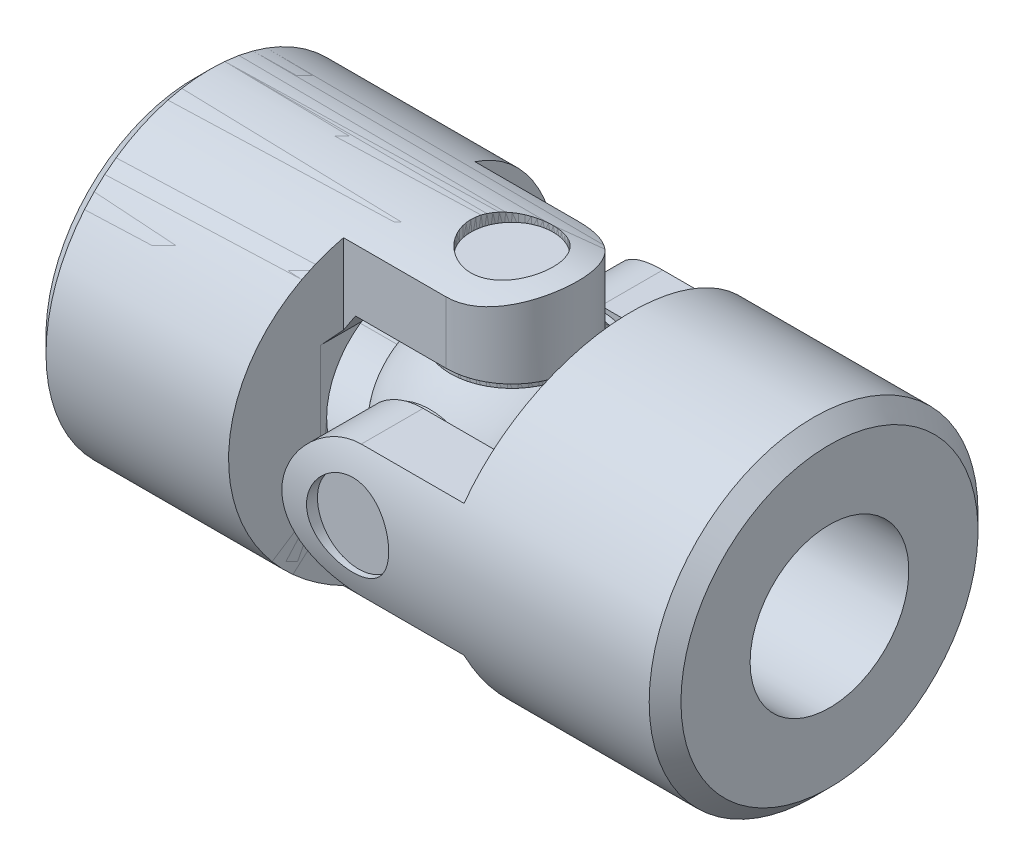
ISO-10303-21;
HEADER;
FILE_DESCRIPTION(('STEP AP214'),'2;1');
FILE_NAME('part.step','',(''),(''),'','','');
FILE_SCHEMA(('AUTOMOTIVE_DESIGN { 1 0 10303 214 1 1 1 1 }'));
ENDSEC;
DATA;
#1=APPLICATION_CONTEXT('core data for automotive mechanical design processes');
#2=APPLICATION_PROTOCOL_DEFINITION('international standard','automotive_design',2000,#1);
#3=PRODUCT_CONTEXT('',#1,'mechanical');
#4=PRODUCT('Part','Part','',(#3));
#5=PRODUCT_RELATED_PRODUCT_CATEGORY('part','',(#4));
#6=PRODUCT_DEFINITION_FORMATION('','',#4);
#7=PRODUCT_DEFINITION_CONTEXT('part definition',#1,'design');
#8=PRODUCT_DEFINITION('design','',#6,#7);
#9=PRODUCT_DEFINITION_SHAPE('','',#8);
#10=(LENGTH_UNIT() NAMED_UNIT(*) SI_UNIT(.MILLI.,.METRE.));
#11=(NAMED_UNIT(*) PLANE_ANGLE_UNIT() SI_UNIT($,.RADIAN.));
#12=(NAMED_UNIT(*) SI_UNIT($,.STERADIAN.) SOLID_ANGLE_UNIT());
#13=UNCERTAINTY_MEASURE_WITH_UNIT(LENGTH_MEASURE(1.E-05),#10,'distance_accuracy_value','');
#14=(GEOMETRIC_REPRESENTATION_CONTEXT(3) GLOBAL_UNCERTAINTY_ASSIGNED_CONTEXT((#13)) GLOBAL_UNIT_ASSIGNED_CONTEXT((#10,
#11,#12)) REPRESENTATION_CONTEXT('',''));
#15=CARTESIAN_POINT('',(0.,0.,0.));
#16=DIRECTION('',(0.,0.,1.));
#17=DIRECTION('',(1.,0.,0.));
#18=AXIS2_PLACEMENT_3D('',#15,#16,#17);
#19=CARTESIAN_POINT('',(28.,16.5166666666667,0.));
#20=DIRECTION('',(0.,1.,0.));
#21=DIRECTION('',(0.,0.,1.));
#22=AXIS2_PLACEMENT_3D('',#19,#20,#21);
#23=CYLINDRICAL_SURFACE('',#22,3.625);
#24=CARTESIAN_POINT('',(24.375,14.5,0.));
#25=CARTESIAN_POINT('',(24.3750086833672,14.4999948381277,-0.200213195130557));
#26=CARTESIAN_POINT('',(24.3916485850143,14.4958102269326,-0.400541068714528));
#27=CARTESIAN_POINT('',(24.4576899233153,14.4795147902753,-0.795510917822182));
#28=CARTESIAN_POINT('',(24.507123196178,14.4673962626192,-0.990147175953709));
#29=CARTESIAN_POINT('',(24.6370644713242,14.4365768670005,-1.36788958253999));
#30=CARTESIAN_POINT('',(24.7175301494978,14.4178849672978,-1.55101104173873));
#31=CARTESIAN_POINT('',(24.9071140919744,14.375910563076,-1.90113886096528));
#32=CARTESIAN_POINT('',(25.0162309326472,14.3526282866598,-2.0681460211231));
#33=CARTESIAN_POINT('',(25.2624010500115,14.3034626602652,-2.38477004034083));
#34=CARTESIAN_POINT('',(25.3999343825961,14.2775391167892,-2.53400745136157));
#35=CARTESIAN_POINT('',(25.6980072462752,14.2262795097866,-2.80755821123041));
#36=CARTESIAN_POINT('',(25.8585496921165,14.2009435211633,-2.93186839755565));
#37=CARTESIAN_POINT('',(26.2010219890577,14.1533237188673,-3.15381425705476));
#38=CARTESIAN_POINT('',(26.3832340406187,14.1310908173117,-3.25102639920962));
#39=CARTESIAN_POINT('',(26.7620590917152,14.0927794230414,-3.41329267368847));
#40=CARTESIAN_POINT('',(26.9586697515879,14.0766999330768,-3.47835201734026));
#41=CARTESIAN_POINT('',(27.3565466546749,14.0529281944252,-3.57317415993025));
#42=CARTESIAN_POINT('',(27.5576407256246,14.0450743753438,-3.60361795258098));
#43=CARTESIAN_POINT('',(27.9622237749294,14.0381595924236,-3.63046594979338));
#44=CARTESIAN_POINT('',(28.165712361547,14.0390972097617,-3.62687564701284));
#45=CARTESIAN_POINT('',(28.5640875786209,14.0495141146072,-3.58630087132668));
#46=CARTESIAN_POINT('',(28.7590631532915,14.0587857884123,-3.55012803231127));
#47=CARTESIAN_POINT('',(29.1400881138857,14.0844953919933,-3.44670871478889));
#48=CARTESIAN_POINT('',(29.3261368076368,14.1009338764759,-3.37945983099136));
#49=CARTESIAN_POINT('',(29.6862060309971,14.1393158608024,-3.21510571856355));
#50=CARTESIAN_POINT('',(29.8600857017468,14.161313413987,-3.11770508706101));
#51=CARTESIAN_POINT('',(30.1893148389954,14.2083031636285,-2.89601715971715));
#52=CARTESIAN_POINT('',(30.3446622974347,14.2332956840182,-2.77172695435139));
#53=CARTESIAN_POINT('',(30.6370424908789,14.2843280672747,-2.49563956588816));
#54=CARTESIAN_POINT('',(30.7734313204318,14.3103775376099,-2.34316258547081));
#55=CARTESIAN_POINT('',(31.0189201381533,14.3599701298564,-2.01701682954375));
#56=CARTESIAN_POINT('',(31.1280083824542,14.3835121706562,-1.8433389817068));
#57=CARTESIAN_POINT('',(31.2688307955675,14.4150110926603,-1.57034031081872));
#58=CARTESIAN_POINT('',(31.3120536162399,14.4248960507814,-1.4769973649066));
#59=CARTESIAN_POINT('',(31.3904542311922,14.4430985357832,-1.28685656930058));
#60=CARTESIAN_POINT('',(31.4256352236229,14.4514166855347,-1.19006011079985));
#61=CARTESIAN_POINT('',(31.4876106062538,14.4662330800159,-0.993865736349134));
#62=CARTESIAN_POINT('',(31.5144186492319,14.4727342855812,-0.894472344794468));
#63=CARTESIAN_POINT('',(31.5594920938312,14.4837453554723,-0.693698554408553));
#64=CARTESIAN_POINT('',(31.5777614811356,14.4882561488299,-0.592319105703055));
#65=CARTESIAN_POINT('',(31.6027706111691,14.4944547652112,-0.409129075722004));
#66=CARTESIAN_POINT('',(31.6111020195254,14.4965307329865,-0.32754500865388));
#67=CARTESIAN_POINT('',(31.6222171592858,14.4993035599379,-0.163976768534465));
#68=CARTESIAN_POINT('',(31.6250008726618,14.5000004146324,-0.0819925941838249));
#69=CARTESIAN_POINT('',(31.6249989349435,14.4999994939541,0.100069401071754));
#70=CARTESIAN_POINT('',(31.6208501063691,14.4989603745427,0.20015134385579));
#71=CARTESIAN_POINT('',(31.6043002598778,14.4948372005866,0.39960044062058));
#72=CARTESIAN_POINT('',(31.5918955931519,14.4917522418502,0.498967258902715));
#73=CARTESIAN_POINT('',(31.5423600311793,14.4795222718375,0.79519260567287));
#74=CARTESIAN_POINT('',(31.4929077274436,14.4674023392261,0.990023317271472));
#75=CARTESIAN_POINT('',(31.3629265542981,14.4365759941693,1.36794957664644));
#76=CARTESIAN_POINT('',(31.2824505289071,14.4178807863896,1.55106446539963));
#77=CARTESIAN_POINT('',(31.0928603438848,14.3759048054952,1.90116833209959));
#78=CARTESIAN_POINT('',(30.9837543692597,14.3526253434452,2.0681619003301));
#79=CARTESIAN_POINT('',(30.7376138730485,14.303465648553,2.38475392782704));
#80=CARTESIAN_POINT('',(30.600099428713,14.2775452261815,2.53397284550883));
#81=CARTESIAN_POINT('',(30.3020292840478,14.226285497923,2.80752826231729));
#82=CARTESIAN_POINT('',(30.1414652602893,14.2009464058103,2.93185573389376));
#83=CARTESIAN_POINT('',(29.798895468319,14.1533114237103,3.15387076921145));
#84=CARTESIAN_POINT('',(29.6166001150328,14.131067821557,3.25112327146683));
#85=CARTESIAN_POINT('',(29.2377203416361,14.0927633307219,3.41336132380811));
#86=CARTESIAN_POINT('',(29.0411530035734,14.0766951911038,3.47838474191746));
#87=CARTESIAN_POINT('',(28.7029942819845,14.0564815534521,3.55899085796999));
#88=CARTESIAN_POINT('',(28.5636398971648,14.0501734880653,3.5837015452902));
#89=CARTESIAN_POINT('',(28.2828761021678,14.0417130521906,3.61670890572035));
#90=CARTESIAN_POINT('',(28.141466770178,14.0395605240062,3.6250062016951));
#91=CARTESIAN_POINT('',(27.7998969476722,14.0395704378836,3.62499122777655));
#92=CARTESIAN_POINT('',(27.5996789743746,14.0438911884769,3.6083690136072));
#93=CARTESIAN_POINT('',(27.2049376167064,14.0606714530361,3.54240427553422));
#94=CARTESIAN_POINT('',(27.010420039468,14.0731389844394,3.49302951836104));
#95=CARTESIAN_POINT('',(26.6329265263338,14.1047125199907,3.36325844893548));
#96=CARTESIAN_POINT('',(26.4499344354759,14.1238089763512,3.28290673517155));
#97=CARTESIAN_POINT('',(26.1000301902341,14.1664763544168,3.09359355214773));
#98=CARTESIAN_POINT('',(25.9331169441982,14.1900469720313,2.98463402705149));
#99=CARTESIAN_POINT('',(25.6164174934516,14.2395877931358,2.73864052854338));
#100=CARTESIAN_POINT('',(25.4670356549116,14.2655962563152,2.60109358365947));
#101=CARTESIAN_POINT('',(25.1931718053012,14.3167564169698,2.30289618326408));
#102=CARTESIAN_POINT('',(25.0686973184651,14.3419078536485,2.14223877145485));
#103=CARTESIAN_POINT('',(24.8465197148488,14.3889480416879,1.79957868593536));
#104=CARTESIAN_POINT('',(24.7492266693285,14.410784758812,1.61730264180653));
#105=CARTESIAN_POINT('',(24.586907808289,14.4482624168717,1.23846283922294));
#106=CARTESIAN_POINT('',(24.5218448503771,14.4639104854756,1.04191582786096));
#107=CARTESIAN_POINT('',(24.4411336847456,14.4835749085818,0.703653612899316));
#108=CARTESIAN_POINT('',(24.416375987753,14.4897025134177,0.564166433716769));
#109=CARTESIAN_POINT('',(24.3833063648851,14.4979168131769,0.283138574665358));
#110=CARTESIAN_POINT('',(24.3749938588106,14.5000036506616,0.141597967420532));
#111=CARTESIAN_POINT('',(24.375,14.5,0.));
#112=B_SPLINE_CURVE_WITH_KNOTS('',3,(#24,#25,#26,#27,#28,#29,#30,#31,#32,#33,#34,#35,#36,#37,
#38,#39,#40,#41,#42,#43,#44,#45,#46,#47,#48,#49,#50,#51,#52,#53,#54,#55,#56,#57,#58,#59,#60,#61,
#62,#63,#64,#65,#66,#67,#68,#69,#70,#71,#72,#73,#74,#75,#76,#77,#78,#79,#80,#81,#82,#83,#84,#85,
#86,#87,#88,#89,#90,#91,#92,#93,#94,#95,#96,#97,#98,#99,#100,#101,#102,#103,#104,#105,#106,#107,
#108,#109,#110,#111),.UNSPECIFIED.,.T.,.F.,(4,2,2,2,2,2,2,2,2,2,2,2,2,2,2,2,2,2,2,2,2,2,2,2,2,2,
2,2,2,2,2,2,2,2,2,2,2,2,2,2,2,2,2,4),(0.,0.600114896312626,1.20081324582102,1.80069520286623,
2.40054735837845,3.01151126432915,3.6225526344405,4.2426679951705,4.86268281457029,
5.47027673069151,6.07777259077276,6.67054185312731,7.26335700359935,7.86217443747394,
8.46105669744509,9.07691344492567,9.69303466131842,10.002734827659,10.3123116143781,
10.6213809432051,10.9303058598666,11.1762163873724,11.4221277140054,11.7222548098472,
12.0225146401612,12.6234865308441,13.2234392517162,13.8232206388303,14.4341126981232,
15.0452259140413,15.6656563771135,16.2853561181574,16.7094011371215,17.1334300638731,
17.7332139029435,18.3335888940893,18.9331027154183,19.5325758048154,20.1439137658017,
20.7554361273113,21.3757392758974,21.9953259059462,22.4197637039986,22.8441865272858),.UNSPECIFIED.);
#113=CARTESIAN_POINT('',(24.375,14.5,0.));
#114=VERTEX_POINT('',#113);
#115=EDGE_CURVE('P0_E325',#114,#114,#112,.T.);
#116=ORIENTED_EDGE('',*,*,#115,.F.);
#117=EDGE_LOOP('',(#116));
#118=FACE_BOUND('',#117,.T.);
#119=CARTESIAN_POINT('',(28.,7.25,0.));
#120=DIRECTION('',(0.,1.,0.));
#121=DIRECTION('',(0.,0.,1.));
#122=AXIS2_PLACEMENT_3D('',#119,#120,#121);
#123=CIRCLE('',#122,3.625);
#124=CARTESIAN_POINT('',(28.,7.25,3.625));
#125=VERTEX_POINT('',#124);
#126=EDGE_CURVE('P0_E447',#125,#125,#123,.T.);
#127=ORIENTED_EDGE('',*,*,#126,.F.);
#128=EDGE_LOOP('',(#127));
#129=FACE_BOUND('',#128,.T.);
#130=ADVANCED_FACE('P0_F29',(#118,#129),#23,.F.);
#131=CARTESIAN_POINT('',(0.,0.,-6.55));
#132=DIRECTION('',(-1.,0.,0.));
#133=DIRECTION('',(0.,0.,1.));
#134=AXIS2_PLACEMENT_3D('',#131,#132,#133);
#135=PLANE('',#134);
#136=CARTESIAN_POINT('',(0.,0.,0.));
#137=DIRECTION('',(1.,0.,0.));
#138=DIRECTION('',(0.,0.,-1.));
#139=AXIS2_PLACEMENT_3D('',#136,#137,#138);
#140=CIRCLE('',#139,13.1);
#141=CARTESIAN_POINT('',(0.,0.,-13.1));
#142=VERTEX_POINT('',#141);
#143=EDGE_CURVE('P0_E332',#142,#142,#140,.T.);
#144=ORIENTED_EDGE('',*,*,#143,.F.);
#145=EDGE_LOOP('',(#144));
#146=FACE_BOUND('',#145,.T.);
#147=CARTESIAN_POINT('',(0.,0.,0.));
#148=DIRECTION('',(1.,0.,0.));
#149=DIRECTION('',(0.,0.,-1.));
#150=AXIS2_PLACEMENT_3D('',#147,#148,#149);
#151=CIRCLE('',#150,7.);
#152=CARTESIAN_POINT('',(0.,0.,-7.));
#153=VERTEX_POINT('',#152);
#154=EDGE_CURVE('P0_E331',#153,#153,#151,.T.);
#155=ORIENTED_EDGE('',*,*,#154,.T.);
#156=EDGE_LOOP('',(#155));
#157=FACE_BOUND('',#156,.T.);
#158=ADVANCED_FACE('P0_F338',(#146,#157),#135,.T.);
#159=CARTESIAN_POINT('',(1.4,0.,0.));
#160=DIRECTION('',(1.,0.,0.));
#161=DIRECTION('',(0.,0.,-1.));
#162=AXIS2_PLACEMENT_3D('',#159,#160,#161);
#163=CONICAL_SURFACE('',#162,14.5,0.785398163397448);
#164=CARTESIAN_POINT('',(1.4,0.,0.));
#165=DIRECTION('',(1.,0.,0.));
#166=DIRECTION('',(0.,0.,-1.));
#167=AXIS2_PLACEMENT_3D('',#164,#165,#166);
#168=CIRCLE('',#167,14.5);
#169=CARTESIAN_POINT('',(1.4,0.,-14.5));
#170=VERTEX_POINT('',#169);
#171=EDGE_CURVE('P0_E275',#170,#170,#168,.T.);
#172=ORIENTED_EDGE('',*,*,#171,.F.);
#173=EDGE_LOOP('',(#172));
#174=FACE_BOUND('',#173,.T.);
#175=ORIENTED_EDGE('',*,*,#143,.T.);
#176=EDGE_LOOP('',(#175));
#177=FACE_BOUND('',#176,.T.);
#178=ADVANCED_FACE('P0_F344',(#174,#177),#163,.T.);
#179=CARTESIAN_POINT('',(28.,-16.5166666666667,0.));
#180=DIRECTION('',(0.,-1.,0.));
#181=DIRECTION('',(0.,0.,-1.));
#182=AXIS2_PLACEMENT_3D('',#179,#180,#181);
#183=CYLINDRICAL_SURFACE('',#182,3.625);
#184=CARTESIAN_POINT('',(24.375,-14.5,0.));
#185=CARTESIAN_POINT('',(24.3750086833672,-14.4999948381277,0.200213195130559));
#186=CARTESIAN_POINT('',(24.3916485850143,-14.4958102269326,0.40054106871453));
#187=CARTESIAN_POINT('',(24.4576899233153,-14.4795147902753,0.795510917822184));
#188=CARTESIAN_POINT('',(24.507123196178,-14.4673962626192,0.990147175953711));
#189=CARTESIAN_POINT('',(24.6370644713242,-14.4365768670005,1.36788958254));
#190=CARTESIAN_POINT('',(24.7175301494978,-14.4178849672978,1.55101104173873));
#191=CARTESIAN_POINT('',(24.9071140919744,-14.375910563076,1.90113886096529));
#192=CARTESIAN_POINT('',(25.0162309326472,-14.3526282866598,2.0681460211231));
#193=CARTESIAN_POINT('',(25.2624010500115,-14.3034626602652,2.38477004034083));
#194=CARTESIAN_POINT('',(25.3999343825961,-14.2775391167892,2.53400745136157));
#195=CARTESIAN_POINT('',(25.6980072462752,-14.2262795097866,2.80755821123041));
#196=CARTESIAN_POINT('',(25.8585496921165,-14.2009435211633,2.93186839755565));
#197=CARTESIAN_POINT('',(26.2010219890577,-14.1533237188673,3.15381425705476));
#198=CARTESIAN_POINT('',(26.3832340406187,-14.1310908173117,3.25102639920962));
#199=CARTESIAN_POINT('',(26.7620590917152,-14.0927794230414,3.41329267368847));
#200=CARTESIAN_POINT('',(26.9586697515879,-14.0766999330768,3.47835201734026));
#201=CARTESIAN_POINT('',(27.356546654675,-14.0529281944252,3.57317415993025));
#202=CARTESIAN_POINT('',(27.5576407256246,-14.0450743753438,3.60361795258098));
#203=CARTESIAN_POINT('',(27.9622237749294,-14.0381595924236,3.63046594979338));
#204=CARTESIAN_POINT('',(28.165712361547,-14.0390972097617,3.62687564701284));
#205=CARTESIAN_POINT('',(28.5640875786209,-14.0495141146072,3.58630087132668));
#206=CARTESIAN_POINT('',(28.7590631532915,-14.0587857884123,3.55012803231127));
#207=CARTESIAN_POINT('',(29.1400881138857,-14.0844953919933,3.44670871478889));
#208=CARTESIAN_POINT('',(29.3261368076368,-14.1009338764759,3.37945983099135));
#209=CARTESIAN_POINT('',(29.6862060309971,-14.1393158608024,3.21510571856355));
#210=CARTESIAN_POINT('',(29.8600857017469,-14.161313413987,3.11770508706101));
#211=CARTESIAN_POINT('',(30.1893148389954,-14.2083031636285,2.89601715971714));
#212=CARTESIAN_POINT('',(30.3446622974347,-14.2332956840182,2.77172695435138));
#213=CARTESIAN_POINT('',(30.6370424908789,-14.2843280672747,2.49563956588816));
#214=CARTESIAN_POINT('',(30.7734313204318,-14.3103775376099,2.34316258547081));
#215=CARTESIAN_POINT('',(31.0189201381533,-14.3599701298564,2.01701682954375));
#216=CARTESIAN_POINT('',(31.1280083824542,-14.3835121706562,1.8433389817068));
#217=CARTESIAN_POINT('',(31.2688307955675,-14.4150110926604,1.57034031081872));
#218=CARTESIAN_POINT('',(31.3120536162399,-14.4248960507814,1.4769973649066));
#219=CARTESIAN_POINT('',(31.3904542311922,-14.4430985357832,1.28685656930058));
#220=CARTESIAN_POINT('',(31.4256352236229,-14.4514166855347,1.19006011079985));
#221=CARTESIAN_POINT('',(31.4876106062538,-14.4662330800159,0.993865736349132));
#222=CARTESIAN_POINT('',(31.5144186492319,-14.4727342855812,0.894472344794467));
#223=CARTESIAN_POINT('',(31.5594920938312,-14.4837453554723,0.693698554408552));
#224=CARTESIAN_POINT('',(31.5777614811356,-14.4882561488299,0.592319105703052));
#225=CARTESIAN_POINT('',(31.6027706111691,-14.4944547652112,0.409129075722));
#226=CARTESIAN_POINT('',(31.6111020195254,-14.4965307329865,0.327545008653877));
#227=CARTESIAN_POINT('',(31.6222171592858,-14.4993035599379,0.163976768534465));
#228=CARTESIAN_POINT('',(31.6250008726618,-14.5000004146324,0.081992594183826));
#229=CARTESIAN_POINT('',(31.6249989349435,-14.4999994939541,-0.100069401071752));
#230=CARTESIAN_POINT('',(31.6208501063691,-14.4989603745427,-0.200151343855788));
#231=CARTESIAN_POINT('',(31.6043002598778,-14.4948372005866,-0.399600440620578));
#232=CARTESIAN_POINT('',(31.5918955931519,-14.4917522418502,-0.498967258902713));
#233=CARTESIAN_POINT('',(31.5423600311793,-14.4795222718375,-0.795192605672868));
#234=CARTESIAN_POINT('',(31.4929077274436,-14.4674023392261,-0.99002331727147));
#235=CARTESIAN_POINT('',(31.3629265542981,-14.4365759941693,-1.36794957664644));
#236=CARTESIAN_POINT('',(31.2824505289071,-14.4178807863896,-1.55106446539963));
#237=CARTESIAN_POINT('',(31.0928603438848,-14.3759048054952,-1.90116833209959));
#238=CARTESIAN_POINT('',(30.9837543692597,-14.3526253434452,-2.06816190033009));
#239=CARTESIAN_POINT('',(30.7376138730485,-14.303465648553,-2.38475392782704));
#240=CARTESIAN_POINT('',(30.600099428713,-14.2775452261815,-2.53397284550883));
#241=CARTESIAN_POINT('',(30.3020292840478,-14.226285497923,-2.80752826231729));
#242=CARTESIAN_POINT('',(30.1414652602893,-14.2009464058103,-2.93185573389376));
#243=CARTESIAN_POINT('',(29.798895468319,-14.1533114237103,-3.15387076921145));
#244=CARTESIAN_POINT('',(29.6166001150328,-14.131067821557,-3.25112327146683));
#245=CARTESIAN_POINT('',(29.2377203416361,-14.0927633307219,-3.41336132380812));
#246=CARTESIAN_POINT('',(29.0411530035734,-14.0766951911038,-3.47838474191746));
#247=CARTESIAN_POINT('',(28.7029942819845,-14.0564815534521,-3.55899085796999));
#248=CARTESIAN_POINT('',(28.5636398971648,-14.0501734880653,-3.5837015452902));
#249=CARTESIAN_POINT('',(28.2828761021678,-14.0417130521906,-3.61670890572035));
#250=CARTESIAN_POINT('',(28.141466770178,-14.0395605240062,-3.6250062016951));
#251=CARTESIAN_POINT('',(27.7998969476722,-14.0395704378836,-3.62499122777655));
#252=CARTESIAN_POINT('',(27.5996789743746,-14.0438911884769,-3.6083690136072));
#253=CARTESIAN_POINT('',(27.2049376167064,-14.0606714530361,-3.54240427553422));
#254=CARTESIAN_POINT('',(27.010420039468,-14.0731389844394,-3.49302951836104));
#255=CARTESIAN_POINT('',(26.6329265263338,-14.1047125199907,-3.36325844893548));
#256=CARTESIAN_POINT('',(26.4499344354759,-14.1238089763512,-3.28290673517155));
#257=CARTESIAN_POINT('',(26.1000301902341,-14.1664763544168,-3.09359355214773));
#258=CARTESIAN_POINT('',(25.9331169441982,-14.1900469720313,-2.98463402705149));
#259=CARTESIAN_POINT('',(25.6164174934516,-14.2395877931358,-2.73864052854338));
#260=CARTESIAN_POINT('',(25.4670356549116,-14.2655962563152,-2.60109358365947));
#261=CARTESIAN_POINT('',(25.1931718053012,-14.3167564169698,-2.30289618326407));
#262=CARTESIAN_POINT('',(25.0686973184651,-14.3419078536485,-2.14223877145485));
#263=CARTESIAN_POINT('',(24.8465197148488,-14.3889480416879,-1.79957868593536));
#264=CARTESIAN_POINT('',(24.7492266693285,-14.410784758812,-1.61730264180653));
#265=CARTESIAN_POINT('',(24.586907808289,-14.4482624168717,-1.23846283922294));
#266=CARTESIAN_POINT('',(24.5218448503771,-14.4639104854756,-1.04191582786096));
#267=CARTESIAN_POINT('',(24.4411336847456,-14.4835749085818,-0.703653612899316));
#268=CARTESIAN_POINT('',(24.416375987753,-14.4897025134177,-0.564166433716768));
#269=CARTESIAN_POINT('',(24.3833063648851,-14.4979168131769,-0.283138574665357));
#270=CARTESIAN_POINT('',(24.3749938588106,-14.5000036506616,-0.14159796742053));
#271=CARTESIAN_POINT('',(24.375,-14.5,0.));
#272=B_SPLINE_CURVE_WITH_KNOTS('',3,(#184,#185,#186,#187,#188,#189,#190,#191,#192,#193,#194,
#195,#196,#197,#198,#199,#200,#201,#202,#203,#204,#205,#206,#207,#208,#209,#210,#211,#212,#213,
#214,#215,#216,#217,#218,#219,#220,#221,#222,#223,#224,#225,#226,#227,#228,#229,#230,#231,#232,
#233,#234,#235,#236,#237,#238,#239,#240,#241,#242,#243,#244,#245,#246,#247,#248,#249,#250,#251,
#252,#253,#254,#255,#256,#257,#258,#259,#260,#261,#262,#263,#264,#265,#266,#267,#268,#269,#270,
#271),.UNSPECIFIED.,.T.,.F.,(4,2,2,2,2,2,2,2,2,2,2,2,2,2,2,2,2,2,2,2,2,2,2,2,2,2,2,2,2,2,2,2,2,
2,2,2,2,2,2,2,2,2,2,4),(0.,0.600114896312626,1.20081324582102,1.80069520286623,2.40054735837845,
3.01151126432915,3.6225526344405,4.24266799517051,4.86268281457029,5.47027673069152,
6.07777259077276,6.67054185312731,7.26335700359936,7.86217443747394,8.46105669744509,
9.07691344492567,9.69303466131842,10.002734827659,10.3123116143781,10.6213809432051,
10.9303058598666,11.1762163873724,11.4221277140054,11.7222548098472,12.0225146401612,
12.6234865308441,13.2234392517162,13.8232206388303,14.4341126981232,15.0452259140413,
15.6656563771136,16.2853561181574,16.7094011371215,17.1334300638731,17.7332139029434,
18.3335888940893,18.9331027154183,19.5325758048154,20.1439137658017,20.7554361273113,
21.3757392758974,21.9953259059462,22.4197637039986,22.8441865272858),.UNSPECIFIED.);
#273=CARTESIAN_POINT('',(24.375,-14.5,0.));
#274=VERTEX_POINT('',#273);
#275=EDGE_CURVE('P0_E277',#274,#274,#272,.T.);
#276=ORIENTED_EDGE('',*,*,#275,.F.);
#277=EDGE_LOOP('',(#276));
#278=FACE_BOUND('',#277,.T.);
#279=CARTESIAN_POINT('',(28.,-7.25,0.));
#280=DIRECTION('',(0.,-1.,0.));
#281=DIRECTION('',(0.,0.,-1.));
#282=AXIS2_PLACEMENT_3D('',#279,#280,#281);
#283=CIRCLE('',#282,3.625);
#284=CARTESIAN_POINT('',(28.,-7.25,-3.625));
#285=VERTEX_POINT('',#284);
#286=EDGE_CURVE('P0_E33',#285,#285,#283,.T.);
#287=ORIENTED_EDGE('',*,*,#286,.F.);
#288=EDGE_LOOP('',(#287));
#289=FACE_BOUND('',#288,.T.);
#290=ADVANCED_FACE('P0_F347',(#278,#289),#183,.F.);
#291=CARTESIAN_POINT('',(18.6527272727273,0.,-29.));
#292=DIRECTION('',(-1.,0.,0.));
#293=DIRECTION('',(0.,0.,1.));
#294=AXIS2_PLACEMENT_3D('',#291,#292,#293);
#295=PLANE('',#294);
#296=CARTESIAN_POINT('',(18.6527272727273,0.,0.));
#297=DIRECTION('',(1.,0.,0.));
#298=DIRECTION('',(0.,0.,-1.));
#299=AXIS2_PLACEMENT_3D('',#296,#297,#298);
#300=CIRCLE('',#299,7.);
#301=CARTESIAN_POINT('',(18.6527272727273,-5.8,3.91918358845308));
#302=VERTEX_POINT('',#301);
#303=CARTESIAN_POINT('',(18.6527272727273,5.8,3.91918358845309));
#304=VERTEX_POINT('',#303);
#305=EDGE_CURVE('P0_E435',#302,#304,#300,.F.);
#306=ORIENTED_EDGE('',*,*,#305,.T.);
#307=DIRECTION('',(0.,0.,1.));
#308=VECTOR('',#307,1.);
#309=CARTESIAN_POINT('',(18.6527272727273,5.8,-29.));
#310=LINE('',#309,#308);
#311=CARTESIAN_POINT('',(18.6527272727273,5.79999999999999,7.52349407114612));
#312=VERTEX_POINT('',#311);
#313=EDGE_CURVE('P0_E249',#304,#312,#310,.T.);
#314=ORIENTED_EDGE('',*,*,#313,.T.);
#315=DIRECTION('',(0.,1.,0.));
#316=VECTOR('',#315,1.);
#317=CARTESIAN_POINT('',(18.6527272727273,-29.,7.5234940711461));
#318=LINE('',#317,#316);
#319=CARTESIAN_POINT('',(18.6527272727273,-5.8,7.5234940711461));
#320=VERTEX_POINT('',#319);
#321=EDGE_CURVE('P0_E110',#312,#320,#318,.F.);
#322=ORIENTED_EDGE('',*,*,#321,.T.);
#323=DIRECTION('',(0.,0.,1.));
#324=VECTOR('',#323,1.);
#325=CARTESIAN_POINT('',(18.6527272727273,-5.8,29.));
#326=LINE('',#325,#324);
#327=EDGE_CURVE('P0_E105',#320,#302,#326,.F.);
#328=ORIENTED_EDGE('',*,*,#327,.T.);
#329=EDGE_LOOP('',(#306,#314,#322,#328));
#330=FACE_BOUND('',#329,.T.);
#331=ADVANCED_FACE('P0_F352',(#330),#295,.F.);
#332=CARTESIAN_POINT('',(16.9,0.,0.));
#333=DIRECTION('',(1.,0.,0.));
#334=DIRECTION('',(0.,0.,-1.));
#335=AXIS2_PLACEMENT_3D('',#332,#333,#334);
#336=CYLINDRICAL_SURFACE('',#335,7.);
#337=CARTESIAN_POINT('',(18.6527272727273,0.,0.));
#338=DIRECTION('',(1.,0.,0.));
#339=DIRECTION('',(0.,0.,-1.));
#340=AXIS2_PLACEMENT_3D('',#337,#338,#339);
#341=CIRCLE('',#340,7.);
#342=CARTESIAN_POINT('',(18.6527272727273,-5.8,-3.91918358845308));
#343=VERTEX_POINT('',#342);
#344=CARTESIAN_POINT('',(18.6527272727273,5.8,-3.91918358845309));
#345=VERTEX_POINT('',#344);
#346=EDGE_CURVE('P0_E245',#343,#345,#341,.T.);
#347=ORIENTED_EDGE('',*,*,#346,.T.);
#348=CARTESIAN_POINT('',(14.8181818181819,0.,0.));
#349=DIRECTION('',(-0.834176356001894,0.551497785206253,0.));
#350=DIRECTION('',(0.551497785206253,0.834176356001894,0.));
#351=AXIS2_PLACEMENT_3D('',#348,#349,#350);
#352=ELLIPSE('',#351,8.39151091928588,7.);
#353=EDGE_CURVE('P0_E167',#345,#304,#352,.F.);
#354=ORIENTED_EDGE('',*,*,#353,.T.);
#355=ORIENTED_EDGE('',*,*,#305,.F.);
#356=CARTESIAN_POINT('',(14.8181818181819,0.,0.));
#357=DIRECTION('',(-0.834176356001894,-0.551497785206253,0.));
#358=DIRECTION('',(0.551497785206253,-0.834176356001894,0.));
#359=AXIS2_PLACEMENT_3D('',#356,#357,#358);
#360=ELLIPSE('',#359,8.39151091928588,7.);
#361=EDGE_CURVE('P0_E294',#302,#343,#360,.F.);
#362=ORIENTED_EDGE('',*,*,#361,.T.);
#363=EDGE_LOOP('',(#347,#354,#355,#362));
#364=FACE_BOUND('',#363,.T.);
#365=ORIENTED_EDGE('',*,*,#154,.F.);
#366=EDGE_LOOP('',(#365));
#367=FACE_BOUND('',#366,.T.);
#368=ADVANCED_FACE('P0_F356',(#364,#367),#336,.F.);
#369=CARTESIAN_POINT('',(18.6527272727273,0.,-29.));
#370=DIRECTION('',(-1.,0.,0.));
#371=DIRECTION('',(0.,0.,1.));
#372=AXIS2_PLACEMENT_3D('',#369,#370,#371);
#373=PLANE('',#372);
#374=DIRECTION('',(0.,0.,1.));
#375=VECTOR('',#374,1.);
#376=CARTESIAN_POINT('',(18.6527272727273,-5.8,29.));
#377=LINE('',#376,#375);
#378=CARTESIAN_POINT('',(18.6527272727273,-5.79999999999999,-7.52349407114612));
#379=VERTEX_POINT('',#378);
#380=EDGE_CURVE('P0_E123',#343,#379,#377,.F.);
#381=ORIENTED_EDGE('',*,*,#380,.T.);
#382=DIRECTION('',(0.,1.,0.));
#383=VECTOR('',#382,1.);
#384=CARTESIAN_POINT('',(18.6527272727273,29.,-7.5234940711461));
#385=LINE('',#384,#383);
#386=CARTESIAN_POINT('',(18.6527272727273,5.8,-7.5234940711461));
#387=VERTEX_POINT('',#386);
#388=EDGE_CURVE('P0_E242',#379,#387,#385,.T.);
#389=ORIENTED_EDGE('',*,*,#388,.T.);
#390=DIRECTION('',(0.,0.,1.));
#391=VECTOR('',#390,1.);
#392=CARTESIAN_POINT('',(18.6527272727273,5.8,-29.));
#393=LINE('',#392,#391);
#394=EDGE_CURVE('P0_E256',#387,#345,#393,.T.);
#395=ORIENTED_EDGE('',*,*,#394,.T.);
#396=ORIENTED_EDGE('',*,*,#346,.F.);
#397=EDGE_LOOP('',(#381,#389,#395,#396));
#398=FACE_BOUND('',#397,.T.);
#399=ADVANCED_FACE('P0_F358',(#398),#373,.F.);
#400=CARTESIAN_POINT('',(17.5,29.,-14.5));
#401=DIRECTION('',(-0.98662283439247,0.,0.163019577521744));
#402=DIRECTION('',(0.163019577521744,0.,0.98662283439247));
#403=AXIS2_PLACEMENT_3D('',#400,#401,#402);
#404=PLANE('',#403);
#405=DIRECTION('',(0.,1.,0.));
#406=VECTOR('',#405,1.);
#407=CARTESIAN_POINT('',(18.9375,29.,-5.8));
#408=LINE('',#407,#406);
#409=CARTESIAN_POINT('',(18.9375,-6.23073731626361,-5.8));
#410=VERTEX_POINT('',#409);
#411=CARTESIAN_POINT('',(18.9375,-13.2894695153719,-5.8));
#412=VERTEX_POINT('',#411);
#413=EDGE_CURVE('P0_E208',#410,#412,#408,.F.);
#414=ORIENTED_EDGE('',*,*,#413,.T.);
#415=CARTESIAN_POINT('',(19.8958333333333,0.,0.));
#416=DIRECTION('',(-0.98662283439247,0.,0.163019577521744));
#417=DIRECTION('',(0.163019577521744,0.,0.986622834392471));
#418=AXIS2_PLACEMENT_3D('',#415,#416,#417);
#419=ELLIPSE('',#418,14.6965988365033,14.5);
#420=CARTESIAN_POINT('',(18.9375,13.2894695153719,-5.8));
#421=VERTEX_POINT('',#420);
#422=EDGE_CURVE('P0_E244',#421,#412,#419,.T.);
#423=ORIENTED_EDGE('',*,*,#422,.F.);
#424=DIRECTION('',(0.,1.,0.));
#425=VECTOR('',#424,1.);
#426=CARTESIAN_POINT('',(18.9375,29.,-5.8));
#427=LINE('',#426,#425);
#428=CARTESIAN_POINT('',(18.9375,6.23073731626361,-5.8));
#429=VERTEX_POINT('',#428);
#430=EDGE_CURVE('P0_E218',#421,#429,#427,.F.);
#431=ORIENTED_EDGE('',*,*,#430,.T.);
#432=DIRECTION('',(-0.158278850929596,-0.239407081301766,-0.957931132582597));
#433=VECTOR('',#432,1.);
#434=CARTESIAN_POINT('',(18.9375,6.23073731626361,-5.8));
#435=LINE('',#434,#433);
#436=EDGE_CURVE('P0_E253',#429,#387,#435,.T.);
#437=ORIENTED_EDGE('',*,*,#436,.T.);
#438=ORIENTED_EDGE('',*,*,#388,.F.);
#439=DIRECTION('',(0.158278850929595,-0.239407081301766,0.957931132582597));
#440=VECTOR('',#439,1.);
#441=CARTESIAN_POINT('',(18.6527272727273,-5.8,-7.5234940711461));
#442=LINE('',#441,#440);
#443=EDGE_CURVE('P0_E129',#379,#410,#442,.T.);
#444=ORIENTED_EDGE('',*,*,#443,.T.);
#445=EDGE_LOOP('',(#414,#423,#431,#437,#438,#444));
#446=FACE_BOUND('',#445,.T.);
#447=ADVANCED_FACE('P0_F306',(#446),#404,.F.);
#448=CARTESIAN_POINT('',(17.6,0.,0.));
#449=DIRECTION('',(1.,0.,0.));
#450=DIRECTION('',(0.,0.,-1.));
#451=AXIS2_PLACEMENT_3D('',#448,#449,#450);
#452=CYLINDRICAL_SURFACE('',#451,14.5);
#453=DIRECTION('',(1.,0.,0.));
#454=VECTOR('',#453,1.);
#455=CARTESIAN_POINT('',(18.9375,13.2894695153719,-5.8));
#456=LINE('',#455,#454);
#457=CARTESIAN_POINT('',(28.,13.2894695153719,-5.8));
#458=VERTEX_POINT('',#457);
#459=EDGE_CURVE('P0_E214',#458,#421,#456,.F.);
#460=ORIENTED_EDGE('',*,*,#459,.T.);
#461=ORIENTED_EDGE('',*,*,#422,.T.);
#462=DIRECTION('',(1.,0.,0.));
#463=VECTOR('',#462,1.);
#464=CARTESIAN_POINT('',(18.9375,-13.2894695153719,-5.8));
#465=LINE('',#464,#463);
#466=CARTESIAN_POINT('',(28.,-13.2894695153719,-5.8));
#467=VERTEX_POINT('',#466);
#468=EDGE_CURVE('P0_E233',#412,#467,#465,.T.);
#469=ORIENTED_EDGE('',*,*,#468,.T.);
#470=CARTESIAN_POINT('',(28.,-13.2894695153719,5.8));
#471=CARTESIAN_POINT('',(28.1560347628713,-13.2894366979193,5.80002456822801));
#472=CARTESIAN_POINT('',(28.3120558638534,-13.2922165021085,5.79370453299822));
#473=CARTESIAN_POINT('',(28.6228394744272,-13.3031595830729,5.76856041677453));
#474=CARTESIAN_POINT('',(28.7776024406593,-13.3113208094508,5.74974109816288));
#475=CARTESIAN_POINT('',(29.0841549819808,-13.3327430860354,5.69988158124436));
#476=CARTESIAN_POINT('',(29.2359538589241,-13.345983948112,5.66888974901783));
#477=CARTESIAN_POINT('',(29.5361418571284,-13.3771243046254,5.59501212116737));
#478=CARTESIAN_POINT('',(29.6845307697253,-13.395024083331,5.55212559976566));
#479=CARTESIAN_POINT('',(29.9767336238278,-13.4349005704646,5.45492409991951));
#480=CARTESIAN_POINT('',(30.1205533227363,-13.4568718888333,5.40062421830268));
#481=CARTESIAN_POINT('',(30.4029807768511,-13.5042549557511,5.28102543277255));
#482=CARTESIAN_POINT('',(30.5415865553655,-13.5296679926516,5.21572240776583));
#483=CARTESIAN_POINT('',(30.9484997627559,-13.6100354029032,5.00397648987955));
#484=CARTESIAN_POINT('',(31.2079293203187,-13.669121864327,4.8416879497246));
#485=CARTESIAN_POINT('',(31.7099299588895,-13.7953389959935,4.46978174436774));
#486=CARTESIAN_POINT('',(31.9509554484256,-13.8627267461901,4.25816459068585));
#487=CARTESIAN_POINT('',(32.2840124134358,-13.962504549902,3.91316756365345));
#488=CARTESIAN_POINT('',(32.3903470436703,-13.9955685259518,3.79348266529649));
#489=CARTESIAN_POINT('',(32.592902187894,-14.0604248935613,3.54553860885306));
#490=CARTESIAN_POINT('',(32.6891261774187,-14.0922177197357,3.41728242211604));
#491=CARTESIAN_POINT('',(32.874497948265,-14.1549572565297,3.14755847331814));
#492=CARTESIAN_POINT('',(32.9632030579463,-14.1858179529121,3.00576634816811));
#493=CARTESIAN_POINT('',(33.1282439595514,-14.2444001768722,2.71460926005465));
#494=CARTESIAN_POINT('',(33.2045846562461,-14.2721229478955,2.56524733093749));
#495=CARTESIAN_POINT('',(33.3441947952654,-14.323624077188,2.26002490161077));
#496=CARTESIAN_POINT('',(33.4074754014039,-14.3474058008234,2.10417008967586));
#497=CARTESIAN_POINT('',(33.5204004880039,-14.390347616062,1.78704161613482));
#498=CARTESIAN_POINT('',(33.5700484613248,-14.4095088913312,1.62576935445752));
#499=CARTESIAN_POINT('',(33.6745319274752,-14.4501555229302,1.22471321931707));
#500=CARTESIAN_POINT('',(33.7214888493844,-14.468746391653,0.982526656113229));
#501=CARTESIAN_POINT('',(33.7842176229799,-14.4936651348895,0.49352164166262));
#502=CARTESIAN_POINT('',(33.7999929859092,-14.4999943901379,0.246703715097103));
#503=CARTESIAN_POINT('',(33.800004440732,-14.5000035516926,-0.156192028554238));
#504=CARTESIAN_POINT('',(33.7936883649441,-14.4974723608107,-0.312338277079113));
#505=CARTESIAN_POINT('',(33.7685003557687,-14.4874238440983,-0.623499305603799));
#506=CARTESIAN_POINT('',(33.7496265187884,-14.4799057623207,-0.778513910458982));
#507=CARTESIAN_POINT('',(33.6995021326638,-14.4600760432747,-1.08627914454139));
#508=CARTESIAN_POINT('',(33.6682460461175,-14.4477622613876,-1.23902872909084));
#509=CARTESIAN_POINT('',(33.5936574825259,-14.4186623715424,-1.54117430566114));
#510=CARTESIAN_POINT('',(33.550320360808,-14.4018745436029,-1.69056898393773));
#511=CARTESIAN_POINT('',(33.4521272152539,-14.3643183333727,-1.98450210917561));
#512=CARTESIAN_POINT('',(33.3973057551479,-14.3435619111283,-2.12905365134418));
#513=CARTESIAN_POINT('',(33.2765183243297,-14.2985490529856,-2.4129150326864));
#514=CARTESIAN_POINT('',(33.2105481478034,-14.2742912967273,-2.55222286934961));
#515=CARTESIAN_POINT('',(33.068006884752,-14.2228786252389,-2.82470064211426));
#516=CARTESIAN_POINT('',(32.9914387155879,-14.1957245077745,-2.95787225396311));
#517=CARTESIAN_POINT('',(32.8282293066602,-14.1391635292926,-3.2174107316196));
#518=CARTESIAN_POINT('',(32.7415844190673,-14.1097558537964,-3.3437751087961));
#519=CARTESIAN_POINT('',(32.4596167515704,-14.0166245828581,-3.72200700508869));
#520=CARTESIAN_POINT('',(32.2482504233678,-13.9502398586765,-3.96152718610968));
#521=CARTESIAN_POINT('',(31.7890602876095,-13.8173377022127,-4.4027801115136));
#522=CARTESIAN_POINT('',(31.5412203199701,-13.7508202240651,-4.60449601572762));
#523=CARTESIAN_POINT('',(31.1405211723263,-13.6548522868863,-4.87903641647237));
#524=CARTESIAN_POINT('',(30.9987348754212,-13.6228532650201,-4.96745131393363));
#525=CARTESIAN_POINT('',(30.7076091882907,-13.561744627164,-5.13193665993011));
#526=CARTESIAN_POINT('',(30.558272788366,-13.5326338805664,-5.20801194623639));
#527=CARTESIAN_POINT('',(30.2531222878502,-13.4782809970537,-5.34710422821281));
#528=CARTESIAN_POINT('',(30.0973143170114,-13.4530353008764,-5.41013325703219));
#529=CARTESIAN_POINT('',(29.7802679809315,-13.4072633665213,-5.52258623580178));
#530=CARTESIAN_POINT('',(29.6190310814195,-13.3867358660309,-5.57201382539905));
#531=CARTESIAN_POINT('',(29.2192348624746,-13.3432220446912,-5.6756454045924));
#532=CARTESIAN_POINT('',(28.9782633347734,-13.3232225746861,-5.7221471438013));
#533=CARTESIAN_POINT('',(28.6133891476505,-13.3030588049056,-5.76878436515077));
#534=CARTESIAN_POINT('',(28.4910991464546,-13.297976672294,-5.78047761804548));
#535=CARTESIAN_POINT('',(28.2458890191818,-13.2911781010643,-5.79608700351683));
#536=CARTESIAN_POINT('',(28.1229686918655,-13.2894628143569,-5.80000047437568));
#537=CARTESIAN_POINT('',(28.,-13.2894695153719,-5.8));
#538=B_SPLINE_CURVE_WITH_KNOTS('',3,(#470,#471,#472,#473,#474,#475,#476,#477,#478,#479,#480,
#481,#482,#483,#484,#485,#486,#487,#488,#489,#490,#491,#492,#493,#494,#495,#496,#497,#498,#499,
#500,#501,#502,#503,#504,#505,#506,#507,#508,#509,#510,#511,#512,#513,#514,#515,#516,#517,#518,
#519,#520,#521,#522,#523,#524,#525,#526,#527,#528,#529,#530,#531,#532,#533,#534,#535,#536,#537),
.UNSPECIFIED.,.F.,.F.,(4,2,2,2,2,2,2,2,2,2,2,2,2,2,2,2,2,2,2,2,2,2,2,2,2,2,2,2,2,2,2,2,2,4),(0.,
0.467930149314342,0.935682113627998,1.40159402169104,1.86753436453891,2.33286222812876,
2.79836476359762,3.72928696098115,4.70792291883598,5.19790690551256,5.68772190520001,
6.1973168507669,6.70670915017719,7.21566419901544,7.72448872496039,8.46432549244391,
9.20407894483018,9.67242856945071,10.1408492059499,10.6094795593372,11.0782903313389,
11.5457099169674,12.0133062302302,12.4807740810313,12.9484116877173,13.9226770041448,
14.8973752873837,15.4072256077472,15.9168755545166,16.4260533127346,16.935094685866,
17.6711761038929,18.0397867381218,18.408523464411),.UNSPECIFIED.);
#539=CARTESIAN_POINT('',(28.,-13.2894695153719,5.8));
#540=VERTEX_POINT('',#539);
#541=EDGE_CURVE('P0_E235',#540,#467,#538,.T.);
#542=ORIENTED_EDGE('',*,*,#541,.F.);
#543=DIRECTION('',(-1.,0.,0.));
#544=VECTOR('',#543,1.);
#545=CARTESIAN_POINT('',(18.9375,-13.2894695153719,5.8));
#546=LINE('',#545,#544);
#547=CARTESIAN_POINT('',(18.9375,-13.2894695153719,5.8));
#548=VERTEX_POINT('',#547);
#549=EDGE_CURVE('P0_E195',#540,#548,#546,.T.);
#550=ORIENTED_EDGE('',*,*,#549,.T.);
#551=CARTESIAN_POINT('',(19.8958333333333,0.,0.));
#552=DIRECTION('',(-0.98662283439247,0.,-0.163019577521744));
#553=DIRECTION('',(0.163019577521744,0.,-0.98662283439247));
#554=AXIS2_PLACEMENT_3D('',#551,#552,#553);
#555=ELLIPSE('',#554,14.6965988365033,14.5);
#556=CARTESIAN_POINT('',(18.9375,13.2894695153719,5.8));
#557=VERTEX_POINT('',#556);
#558=EDGE_CURVE('P0_E250',#548,#557,#555,.T.);
#559=ORIENTED_EDGE('',*,*,#558,.T.);
#560=DIRECTION('',(-1.,0.,0.));
#561=VECTOR('',#560,1.);
#562=CARTESIAN_POINT('',(18.9375,13.2894695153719,5.8));
#563=LINE('',#562,#561);
#564=CARTESIAN_POINT('',(28.,13.2894695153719,5.8));
#565=VERTEX_POINT('',#564);
#566=EDGE_CURVE('P0_E265',#557,#565,#563,.F.);
#567=ORIENTED_EDGE('',*,*,#566,.T.);
#568=CARTESIAN_POINT('',(28.,13.2894695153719,-5.8));
#569=CARTESIAN_POINT('',(28.1560347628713,13.2894366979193,-5.80002456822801));
#570=CARTESIAN_POINT('',(28.3120558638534,13.2922165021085,-5.79370453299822));
#571=CARTESIAN_POINT('',(28.6228394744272,13.3031595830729,-5.76856041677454));
#572=CARTESIAN_POINT('',(28.7776024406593,13.3113208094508,-5.74974109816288));
#573=CARTESIAN_POINT('',(29.0841549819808,13.3327430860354,-5.69988158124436));
#574=CARTESIAN_POINT('',(29.2359538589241,13.345983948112,-5.66888974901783));
#575=CARTESIAN_POINT('',(29.5361418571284,13.3771243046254,-5.59501212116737));
#576=CARTESIAN_POINT('',(29.6845307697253,13.395024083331,-5.55212559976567));
#577=CARTESIAN_POINT('',(29.9767336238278,13.4349005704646,-5.45492409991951));
#578=CARTESIAN_POINT('',(30.1205533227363,13.4568718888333,-5.40062421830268));
#579=CARTESIAN_POINT('',(30.4029807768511,13.5042549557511,-5.28102543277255));
#580=CARTESIAN_POINT('',(30.5415865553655,13.5296679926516,-5.21572240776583));
#581=CARTESIAN_POINT('',(30.9484997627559,13.6100354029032,-5.00397648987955));
#582=CARTESIAN_POINT('',(31.2079293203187,13.669121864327,-4.8416879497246));
#583=CARTESIAN_POINT('',(31.7099299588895,13.7953389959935,-4.46978174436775));
#584=CARTESIAN_POINT('',(31.9509554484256,13.8627267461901,-4.25816459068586));
#585=CARTESIAN_POINT('',(32.2840124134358,13.962504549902,-3.91316756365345));
#586=CARTESIAN_POINT('',(32.3903470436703,13.9955685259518,-3.79348266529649));
#587=CARTESIAN_POINT('',(32.592902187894,14.0604248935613,-3.54553860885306));
#588=CARTESIAN_POINT('',(32.6891261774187,14.0922177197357,-3.41728242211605));
#589=CARTESIAN_POINT('',(32.874497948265,14.1549572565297,-3.14755847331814));
#590=CARTESIAN_POINT('',(32.9632030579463,14.1858179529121,-3.00576634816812));
#591=CARTESIAN_POINT('',(33.1282439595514,14.2444001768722,-2.71460926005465));
#592=CARTESIAN_POINT('',(33.2045846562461,14.2721229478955,-2.56524733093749));
#593=CARTESIAN_POINT('',(33.3441947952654,14.323624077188,-2.26002490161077));
#594=CARTESIAN_POINT('',(33.4074754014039,14.3474058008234,-2.10417008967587));
#595=CARTESIAN_POINT('',(33.5204004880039,14.390347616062,-1.78704161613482));
#596=CARTESIAN_POINT('',(33.5700484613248,14.4095088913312,-1.62576935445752));
#597=CARTESIAN_POINT('',(33.6745319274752,14.4501555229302,-1.22471321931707));
#598=CARTESIAN_POINT('',(33.7214888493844,14.468746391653,-0.982526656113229));
#599=CARTESIAN_POINT('',(33.7842176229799,14.4936651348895,-0.493521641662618));
#600=CARTESIAN_POINT('',(33.7999929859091,14.4999943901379,-0.2467037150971));
#601=CARTESIAN_POINT('',(33.800004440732,14.5000035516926,0.156192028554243));
#602=CARTESIAN_POINT('',(33.7936883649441,14.4974723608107,0.312338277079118));
#603=CARTESIAN_POINT('',(33.7685003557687,14.4874238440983,0.623499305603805));
#604=CARTESIAN_POINT('',(33.7496265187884,14.4799057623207,0.778513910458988));
#605=CARTESIAN_POINT('',(33.6995021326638,14.4600760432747,1.0862791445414));
#606=CARTESIAN_POINT('',(33.6682460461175,14.4477622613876,1.23902872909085));
#607=CARTESIAN_POINT('',(33.5936574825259,14.4186623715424,1.54117430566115));
#608=CARTESIAN_POINT('',(33.550320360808,14.4018745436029,1.69056898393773));
#609=CARTESIAN_POINT('',(33.4521272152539,14.3643183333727,1.98450210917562));
#610=CARTESIAN_POINT('',(33.3973057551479,14.3435619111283,2.12905365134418));
#611=CARTESIAN_POINT('',(33.2765183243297,14.2985490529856,2.41291503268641));
#612=CARTESIAN_POINT('',(33.2105481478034,14.2742912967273,2.55222286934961));
#613=CARTESIAN_POINT('',(33.068006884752,14.2228786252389,2.82470064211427));
#614=CARTESIAN_POINT('',(32.9914387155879,14.1957245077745,2.95787225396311));
#615=CARTESIAN_POINT('',(32.8282293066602,14.1391635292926,3.21741073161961));
#616=CARTESIAN_POINT('',(32.7415844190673,14.1097558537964,3.34377510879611));
#617=CARTESIAN_POINT('',(32.4596167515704,14.0166245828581,3.72200700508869));
#618=CARTESIAN_POINT('',(32.2482504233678,13.9502398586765,3.96152718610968));
#619=CARTESIAN_POINT('',(31.7890602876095,13.8173377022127,4.4027801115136));
#620=CARTESIAN_POINT('',(31.5412203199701,13.7508202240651,4.60449601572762));
#621=CARTESIAN_POINT('',(31.1405211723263,13.6548522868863,4.87903641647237));
#622=CARTESIAN_POINT('',(30.9987348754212,13.6228532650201,4.96745131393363));
#623=CARTESIAN_POINT('',(30.7076091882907,13.561744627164,5.13193665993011));
#624=CARTESIAN_POINT('',(30.558272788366,13.5326338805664,5.20801194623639));
#625=CARTESIAN_POINT('',(30.2531222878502,13.4782809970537,5.34710422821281));
#626=CARTESIAN_POINT('',(30.0973143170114,13.4530353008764,5.41013325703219));
#627=CARTESIAN_POINT('',(29.7802679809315,13.4072633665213,5.52258623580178));
#628=CARTESIAN_POINT('',(29.6190310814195,13.3867358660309,5.57201382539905));
#629=CARTESIAN_POINT('',(29.2192348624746,13.3432220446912,5.6756454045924));
#630=CARTESIAN_POINT('',(28.9782633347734,13.3232225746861,5.7221471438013));
#631=CARTESIAN_POINT('',(28.6133891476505,13.3030588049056,5.76878436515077));
#632=CARTESIAN_POINT('',(28.4910991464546,13.297976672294,5.78047761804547));
#633=CARTESIAN_POINT('',(28.2458890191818,13.2911781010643,5.79608700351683));
#634=CARTESIAN_POINT('',(28.1229686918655,13.2894628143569,5.80000047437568));
#635=CARTESIAN_POINT('',(28.,13.2894695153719,5.8));
#636=B_SPLINE_CURVE_WITH_KNOTS('',3,(#568,#569,#570,#571,#572,#573,#574,#575,#576,#577,#578,
#579,#580,#581,#582,#583,#584,#585,#586,#587,#588,#589,#590,#591,#592,#593,#594,#595,#596,#597,
#598,#599,#600,#601,#602,#603,#604,#605,#606,#607,#608,#609,#610,#611,#612,#613,#614,#615,#616,
#617,#618,#619,#620,#621,#622,#623,#624,#625,#626,#627,#628,#629,#630,#631,#632,#633,#634,#635),
.UNSPECIFIED.,.F.,.F.,(4,2,2,2,2,2,2,2,2,2,2,2,2,2,2,2,2,2,2,2,2,2,2,2,2,2,2,2,2,2,2,2,2,4),(0.,
0.467930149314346,0.935682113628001,1.40159402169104,1.86753436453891,2.33286222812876,
2.79836476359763,3.72928696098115,4.70792291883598,5.19790690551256,5.68772190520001,
6.19731685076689,6.7067091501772,7.21566419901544,7.72448872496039,8.46432549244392,
9.20407894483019,9.67242856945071,10.1408492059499,10.6094795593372,11.078290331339,
11.5457099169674,12.0133062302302,12.4807740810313,12.9484116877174,13.9226770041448,
14.8973752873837,15.4072256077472,15.9168755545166,16.4260533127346,16.935094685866,
17.6711761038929,18.0397867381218,18.408523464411),.UNSPECIFIED.);
#637=EDGE_CURVE('P0_E267',#458,#565,#636,.T.);
#638=ORIENTED_EDGE('',*,*,#637,.F.);
#639=EDGE_LOOP('',(#460,#461,#469,#542,#550,#559,#567,#638));
#640=FACE_BOUND('',#639,.T.);
#641=ORIENTED_EDGE('',*,*,#275,.T.);
#642=EDGE_LOOP('',(#641));
#643=FACE_BOUND('',#642,.T.);
#644=ORIENTED_EDGE('',*,*,#171,.T.);
#645=EDGE_LOOP('',(#644));
#646=FACE_BOUND('',#645,.T.);
#647=ORIENTED_EDGE('',*,*,#115,.T.);
#648=EDGE_LOOP('',(#647));
#649=FACE_BOUND('',#648,.T.);
#650=ADVANCED_FACE('P0_F300',(#640,#643,#646,#649),#452,.T.);
#651=CARTESIAN_POINT('',(17.5,-29.,14.5));
#652=DIRECTION('',(-0.98662283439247,0.,-0.163019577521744));
#653=DIRECTION('',(-0.163019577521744,0.,0.98662283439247));
#654=AXIS2_PLACEMENT_3D('',#651,#652,#653);
#655=PLANE('',#654);
#656=ORIENTED_EDGE('',*,*,#321,.F.);
#657=DIRECTION('',(0.158278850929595,0.239407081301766,-0.957931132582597));
#658=VECTOR('',#657,1.);
#659=CARTESIAN_POINT('',(18.6527272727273,5.8,7.5234940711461));
#660=LINE('',#659,#658);
#661=CARTESIAN_POINT('',(18.9375,6.23073731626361,5.8));
#662=VERTEX_POINT('',#661);
#663=EDGE_CURVE('P0_E257',#312,#662,#660,.T.);
#664=ORIENTED_EDGE('',*,*,#663,.T.);
#665=DIRECTION('',(0.,1.,0.));
#666=VECTOR('',#665,1.);
#667=CARTESIAN_POINT('',(18.9375,-29.,5.8));
#668=LINE('',#667,#666);
#669=EDGE_CURVE('P0_E166',#662,#557,#668,.T.);
#670=ORIENTED_EDGE('',*,*,#669,.T.);
#671=ORIENTED_EDGE('',*,*,#558,.F.);
#672=DIRECTION('',(0.,1.,0.));
#673=VECTOR('',#672,1.);
#674=CARTESIAN_POINT('',(18.9375,-29.,5.8));
#675=LINE('',#674,#673);
#676=CARTESIAN_POINT('',(18.9375,-6.23073731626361,5.8));
#677=VERTEX_POINT('',#676);
#678=EDGE_CURVE('P0_E199',#548,#677,#675,.T.);
#679=ORIENTED_EDGE('',*,*,#678,.T.);
#680=DIRECTION('',(-0.158278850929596,0.239407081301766,0.957931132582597));
#681=VECTOR('',#680,1.);
#682=CARTESIAN_POINT('',(18.9375,-6.23073731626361,5.8));
#683=LINE('',#682,#681);
#684=EDGE_CURVE('P0_E217',#677,#320,#683,.T.);
#685=ORIENTED_EDGE('',*,*,#684,.T.);
#686=EDGE_LOOP('',(#656,#664,#670,#671,#679,#685));
#687=FACE_BOUND('',#686,.T.);
#688=ADVANCED_FACE('P0_F305',(#687),#655,.F.);
#689=CARTESIAN_POINT('',(18.6527272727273,5.8,-29.));
#690=DIRECTION('',(-0.834176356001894,0.551497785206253,0.));
#691=DIRECTION('',(-0.551497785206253,-0.834176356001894,0.));
#692=AXIS2_PLACEMENT_3D('',#689,#690,#691);
#693=PLANE('',#692);
#694=ORIENTED_EDGE('',*,*,#394,.F.);
#695=ORIENTED_EDGE('',*,*,#436,.F.);
#696=DIRECTION('',(0.551497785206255,0.834176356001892,0.));
#697=VECTOR('',#696,1.);
#698=CARTESIAN_POINT('',(18.9375,6.23073731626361,-5.8));
#699=LINE('',#698,#697);
#700=CARTESIAN_POINT('',(20.,7.83783783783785,-5.8));
#701=VERTEX_POINT('',#700);
#702=EDGE_CURVE('P0_E152',#429,#701,#699,.T.);
#703=ORIENTED_EDGE('',*,*,#702,.T.);
#704=DIRECTION('',(0.,0.,1.));
#705=VECTOR('',#704,1.);
#706=CARTESIAN_POINT('',(20.,7.83783783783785,-29.));
#707=LINE('',#706,#705);
#708=CARTESIAN_POINT('',(20.,7.83783783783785,5.8));
#709=VERTEX_POINT('',#708);
#710=EDGE_CURVE('P0_E143',#701,#709,#707,.T.);
#711=ORIENTED_EDGE('',*,*,#710,.T.);
#712=DIRECTION('',(-0.551497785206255,-0.834176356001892,0.));
#713=VECTOR('',#712,1.);
#714=CARTESIAN_POINT('',(20.,7.83783783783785,5.8));
#715=LINE('',#714,#713);
#716=EDGE_CURVE('P0_E148',#709,#662,#715,.T.);
#717=ORIENTED_EDGE('',*,*,#716,.T.);
#718=ORIENTED_EDGE('',*,*,#663,.F.);
#719=ORIENTED_EDGE('',*,*,#313,.F.);
#720=ORIENTED_EDGE('',*,*,#353,.F.);
#721=EDGE_LOOP('',(#694,#695,#703,#711,#717,#718,#719,#720));
#722=FACE_BOUND('',#721,.T.);
#723=ADVANCED_FACE('P0_F146',(#722),#693,.F.);
#724=CARTESIAN_POINT('',(18.9375,-29.,5.8));
#725=DIRECTION('',(0.,0.,-1.));
#726=DIRECTION('',(-1.,0.,0.));
#727=AXIS2_PLACEMENT_3D('',#724,#725,#726);
#728=PLANE('',#727);
#729=DIRECTION('',(0.,-1.,0.));
#730=VECTOR('',#729,1.);
#731=CARTESIAN_POINT('',(28.,29.,5.8));
#732=LINE('',#731,#730);
#733=CARTESIAN_POINT('',(28.,7.83783783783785,5.8));
#734=VERTEX_POINT('',#733);
#735=EDGE_CURVE('P0_E215',#565,#734,#732,.T.);
#736=ORIENTED_EDGE('',*,*,#735,.F.);
#737=ORIENTED_EDGE('',*,*,#566,.F.);
#738=ORIENTED_EDGE('',*,*,#669,.F.);
#739=ORIENTED_EDGE('',*,*,#716,.F.);
#740=DIRECTION('',(1.,0.,0.));
#741=VECTOR('',#740,1.);
#742=CARTESIAN_POINT('',(20.,7.83783783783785,5.8));
#743=LINE('',#742,#741);
#744=EDGE_CURVE('P0_E157',#709,#734,#743,.T.);
#745=ORIENTED_EDGE('',*,*,#744,.T.);
#746=EDGE_LOOP('',(#736,#737,#738,#739,#745));
#747=FACE_BOUND('',#746,.T.);
#748=ADVANCED_FACE('P0_F162',(#747),#728,.F.);
#749=CARTESIAN_POINT('',(28.,29.,0.));
#750=DIRECTION('',(0.,-1.,0.));
#751=DIRECTION('',(0.,0.,-1.));
#752=AXIS2_PLACEMENT_3D('',#749,#750,#751);
#753=CYLINDRICAL_SURFACE('',#752,5.8);
#754=ORIENTED_EDGE('',*,*,#637,.T.);
#755=ORIENTED_EDGE('',*,*,#735,.T.);
#756=CARTESIAN_POINT('',(28.,7.83783783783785,0.));
#757=DIRECTION('',(0.,-1.,0.));
#758=DIRECTION('',(0.,0.,-1.));
#759=AXIS2_PLACEMENT_3D('',#756,#757,#758);
#760=CIRCLE('',#759,5.8);
#761=CARTESIAN_POINT('',(28.,7.83783783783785,-5.8));
#762=VERTEX_POINT('',#761);
#763=EDGE_CURVE('P0_E172',#734,#762,#760,.F.);
#764=ORIENTED_EDGE('',*,*,#763,.T.);
#765=DIRECTION('',(0.,1.,0.));
#766=VECTOR('',#765,1.);
#767=CARTESIAN_POINT('',(28.,29.,-5.8));
#768=LINE('',#767,#766);
#769=EDGE_CURVE('P0_E211',#762,#458,#768,.T.);
#770=ORIENTED_EDGE('',*,*,#769,.T.);
#771=EDGE_LOOP('',(#754,#755,#764,#770));
#772=FACE_BOUND('',#771,.T.);
#773=ADVANCED_FACE('P0_F424',(#772),#753,.T.);
#774=CARTESIAN_POINT('',(18.9375,29.,-5.8));
#775=DIRECTION('',(0.,0.,1.));
#776=DIRECTION('',(1.,0.,0.));
#777=AXIS2_PLACEMENT_3D('',#774,#775,#776);
#778=PLANE('',#777);
#779=ORIENTED_EDGE('',*,*,#430,.F.);
#780=ORIENTED_EDGE('',*,*,#459,.F.);
#781=ORIENTED_EDGE('',*,*,#769,.F.);
#782=DIRECTION('',(1.,0.,0.));
#783=VECTOR('',#782,1.);
#784=CARTESIAN_POINT('',(20.,7.83783783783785,-5.8));
#785=LINE('',#784,#783);
#786=EDGE_CURVE('P0_E174',#762,#701,#785,.F.);
#787=ORIENTED_EDGE('',*,*,#786,.T.);
#788=ORIENTED_EDGE('',*,*,#702,.F.);
#789=EDGE_LOOP('',(#779,#780,#781,#787,#788));
#790=FACE_BOUND('',#789,.T.);
#791=ADVANCED_FACE('P0_F420',(#790),#778,.F.);
#792=CARTESIAN_POINT('',(18.6527272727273,-5.8,29.));
#793=DIRECTION('',(-0.834176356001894,-0.551497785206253,0.));
#794=DIRECTION('',(0.551497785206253,-0.834176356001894,0.));
#795=AXIS2_PLACEMENT_3D('',#792,#793,#794);
#796=PLANE('',#795);
#797=DIRECTION('',(0.,0.,-1.));
#798=VECTOR('',#797,1.);
#799=CARTESIAN_POINT('',(20.,-7.83783783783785,29.));
#800=LINE('',#799,#798);
#801=CARTESIAN_POINT('',(20.,-7.83783783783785,5.8));
#802=VERTEX_POINT('',#801);
#803=CARTESIAN_POINT('',(20.,-7.83783783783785,-5.8));
#804=VERTEX_POINT('',#803);
#805=EDGE_CURVE('P0_E190',#802,#804,#800,.T.);
#806=ORIENTED_EDGE('',*,*,#805,.T.);
#807=DIRECTION('',(-0.551497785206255,0.834176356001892,0.));
#808=VECTOR('',#807,1.);
#809=CARTESIAN_POINT('',(20.,-7.83783783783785,-5.8));
#810=LINE('',#809,#808);
#811=EDGE_CURVE('P0_E206',#804,#410,#810,.T.);
#812=ORIENTED_EDGE('',*,*,#811,.T.);
#813=ORIENTED_EDGE('',*,*,#443,.F.);
#814=ORIENTED_EDGE('',*,*,#380,.F.);
#815=ORIENTED_EDGE('',*,*,#361,.F.);
#816=ORIENTED_EDGE('',*,*,#327,.F.);
#817=ORIENTED_EDGE('',*,*,#684,.F.);
#818=DIRECTION('',(0.551497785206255,-0.834176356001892,0.));
#819=VECTOR('',#818,1.);
#820=CARTESIAN_POINT('',(18.9375,-6.23073731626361,5.8));
#821=LINE('',#820,#819);
#822=EDGE_CURVE('P0_E158',#677,#802,#821,.T.);
#823=ORIENTED_EDGE('',*,*,#822,.T.);
#824=EDGE_LOOP('',(#806,#812,#813,#814,#815,#816,#817,#823));
#825=FACE_BOUND('',#824,.T.);
#826=ADVANCED_FACE('P0_F403',(#825),#796,.F.);
#827=CARTESIAN_POINT('',(18.9375,29.,-5.8));
#828=DIRECTION('',(0.,0.,1.));
#829=DIRECTION('',(1.,0.,0.));
#830=AXIS2_PLACEMENT_3D('',#827,#828,#829);
#831=PLANE('',#830);
#832=DIRECTION('',(0.,-1.,0.));
#833=VECTOR('',#832,1.);
#834=CARTESIAN_POINT('',(28.,29.,-5.8));
#835=LINE('',#834,#833);
#836=CARTESIAN_POINT('',(28.,-7.83783783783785,-5.8));
#837=VERTEX_POINT('',#836);
#838=EDGE_CURVE('P0_E196',#467,#837,#835,.F.);
#839=ORIENTED_EDGE('',*,*,#838,.F.);
#840=ORIENTED_EDGE('',*,*,#468,.F.);
#841=ORIENTED_EDGE('',*,*,#413,.F.);
#842=ORIENTED_EDGE('',*,*,#811,.F.);
#843=DIRECTION('',(1.,0.,0.));
#844=VECTOR('',#843,1.);
#845=CARTESIAN_POINT('',(20.,-7.83783783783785,-5.8));
#846=LINE('',#845,#844);
#847=EDGE_CURVE('P0_E188',#804,#837,#846,.T.);
#848=ORIENTED_EDGE('',*,*,#847,.T.);
#849=EDGE_LOOP('',(#839,#840,#841,#842,#848));
#850=FACE_BOUND('',#849,.T.);
#851=ADVANCED_FACE('P0_F395',(#850),#831,.F.);
#852=CARTESIAN_POINT('',(28.,29.,0.));
#853=DIRECTION('',(0.,-1.,0.));
#854=DIRECTION('',(0.,0.,-1.));
#855=AXIS2_PLACEMENT_3D('',#852,#853,#854);
#856=CYLINDRICAL_SURFACE('',#855,5.8);
#857=ORIENTED_EDGE('',*,*,#541,.T.);
#858=ORIENTED_EDGE('',*,*,#838,.T.);
#859=CARTESIAN_POINT('',(28.,-7.83783783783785,0.));
#860=DIRECTION('',(0.,-1.,0.));
#861=DIRECTION('',(0.,0.,-1.));
#862=AXIS2_PLACEMENT_3D('',#859,#860,#861);
#863=CIRCLE('',#862,5.8);
#864=CARTESIAN_POINT('',(28.,-7.83783783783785,5.8));
#865=VERTEX_POINT('',#864);
#866=EDGE_CURVE('P0_E48',#837,#865,#863,.T.);
#867=ORIENTED_EDGE('',*,*,#866,.T.);
#868=DIRECTION('',(0.,1.,0.));
#869=VECTOR('',#868,1.);
#870=CARTESIAN_POINT('',(28.,-29.,5.8));
#871=LINE('',#870,#869);
#872=EDGE_CURVE('P0_E193',#865,#540,#871,.F.);
#873=ORIENTED_EDGE('',*,*,#872,.T.);
#874=EDGE_LOOP('',(#857,#858,#867,#873));
#875=FACE_BOUND('',#874,.T.);
#876=ADVANCED_FACE('P0_F296',(#875),#856,.T.);
#877=CARTESIAN_POINT('',(18.9375,-29.,5.8));
#878=DIRECTION('',(0.,0.,-1.));
#879=DIRECTION('',(-1.,0.,0.));
#880=AXIS2_PLACEMENT_3D('',#877,#878,#879);
#881=PLANE('',#880);
#882=ORIENTED_EDGE('',*,*,#822,.F.);
#883=ORIENTED_EDGE('',*,*,#678,.F.);
#884=ORIENTED_EDGE('',*,*,#549,.F.);
#885=ORIENTED_EDGE('',*,*,#872,.F.);
#886=DIRECTION('',(1.,0.,0.));
#887=VECTOR('',#886,1.);
#888=CARTESIAN_POINT('',(20.,-7.83783783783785,5.8));
#889=LINE('',#888,#887);
#890=EDGE_CURVE('P0_E182',#865,#802,#889,.F.);
#891=ORIENTED_EDGE('',*,*,#890,.T.);
#892=EDGE_LOOP('',(#882,#883,#884,#885,#891));
#893=FACE_BOUND('',#892,.T.);
#894=ADVANCED_FACE('P0_F387',(#893),#881,.F.);
#895=CARTESIAN_POINT('',(20.,7.83783783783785,-29.));
#896=DIRECTION('',(0.,1.,0.));
#897=DIRECTION('',(0.,0.,1.));
#898=AXIS2_PLACEMENT_3D('',#895,#896,#897);
#899=PLANE('',#898);
#900=ORIENTED_EDGE('',*,*,#763,.F.);
#901=ORIENTED_EDGE('',*,*,#744,.F.);
#902=ORIENTED_EDGE('',*,*,#710,.F.);
#903=ORIENTED_EDGE('',*,*,#786,.F.);
#904=EDGE_LOOP('',(#900,#901,#902,#903));
#905=FACE_BOUND('',#904,.T.);
#906=CARTESIAN_POINT('',(28.,7.83783783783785,0.));
#907=DIRECTION('',(0.,1.,0.));
#908=DIRECTION('',(0.,0.,1.));
#909=AXIS2_PLACEMENT_3D('',#906,#907,#908);
#910=CIRCLE('',#909,5.4375);
#911=CARTESIAN_POINT('',(28.,7.83783783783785,5.4375));
#912=VERTEX_POINT('',#911);
#913=EDGE_CURVE('P0_E185',#912,#912,#910,.F.);
#914=ORIENTED_EDGE('',*,*,#913,.F.);
#915=EDGE_LOOP('',(#914));
#916=FACE_BOUND('',#915,.T.);
#917=ADVANCED_FACE('P0_F170',(#905,#916),#899,.F.);
#918=CARTESIAN_POINT('',(20.,-7.83783783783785,29.));
#919=DIRECTION('',(0.,-1.,0.));
#920=DIRECTION('',(0.,0.,-1.));
#921=AXIS2_PLACEMENT_3D('',#918,#919,#920);
#922=PLANE('',#921);
#923=ORIENTED_EDGE('',*,*,#866,.F.);
#924=ORIENTED_EDGE('',*,*,#847,.F.);
#925=ORIENTED_EDGE('',*,*,#805,.F.);
#926=ORIENTED_EDGE('',*,*,#890,.F.);
#927=EDGE_LOOP('',(#923,#924,#925,#926));
#928=FACE_BOUND('',#927,.T.);
#929=CARTESIAN_POINT('',(28.,-7.83783783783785,0.));
#930=DIRECTION('',(0.,-1.,0.));
#931=DIRECTION('',(0.,0.,-1.));
#932=AXIS2_PLACEMENT_3D('',#929,#930,#931);
#933=CIRCLE('',#932,5.4375);
#934=CARTESIAN_POINT('',(28.,-7.83783783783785,-5.4375));
#935=VERTEX_POINT('',#934);
#936=EDGE_CURVE('P0_E281',#935,#935,#933,.F.);
#937=ORIENTED_EDGE('',*,*,#936,.F.);
#938=EDGE_LOOP('',(#937));
#939=FACE_BOUND('',#938,.T.);
#940=ADVANCED_FACE('P0_F374',(#928,#939),#922,.F.);
#941=CARTESIAN_POINT('',(28.,7.54391891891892,0.));
#942=DIRECTION('',(0.,1.,0.));
#943=DIRECTION('',(0.,0.,1.));
#944=AXIS2_PLACEMENT_3D('',#941,#942,#943);
#945=CYLINDRICAL_SURFACE('',#944,5.4375);
#946=CARTESIAN_POINT('',(28.,7.25,0.));
#947=DIRECTION('',(0.,1.,0.));
#948=DIRECTION('',(0.,0.,1.));
#949=AXIS2_PLACEMENT_3D('',#946,#947,#948);
#950=CIRCLE('',#949,5.4375);
#951=CARTESIAN_POINT('',(28.,7.25,5.4375));
#952=VERTEX_POINT('',#951);
#953=EDGE_CURVE('P0_E39',#952,#952,#950,.F.);
#954=ORIENTED_EDGE('',*,*,#953,.F.);
#955=EDGE_LOOP('',(#954));
#956=FACE_BOUND('',#955,.T.);
#957=ORIENTED_EDGE('',*,*,#913,.T.);
#958=EDGE_LOOP('',(#957));
#959=FACE_BOUND('',#958,.T.);
#960=ADVANCED_FACE('P0_F366',(#956,#959),#945,.T.);
#961=CARTESIAN_POINT('',(28.,-7.54391891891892,0.));
#962=DIRECTION('',(0.,-1.,0.));
#963=DIRECTION('',(0.,0.,-1.));
#964=AXIS2_PLACEMENT_3D('',#961,#962,#963);
#965=CYLINDRICAL_SURFACE('',#964,5.4375);
#966=CARTESIAN_POINT('',(28.,-7.25,0.));
#967=DIRECTION('',(0.,-1.,0.));
#968=DIRECTION('',(0.,0.,-1.));
#969=AXIS2_PLACEMENT_3D('',#966,#967,#968);
#970=CIRCLE('',#969,5.4375);
#971=CARTESIAN_POINT('',(28.,-7.25,-5.4375));
#972=VERTEX_POINT('',#971);
#973=EDGE_CURVE('P0_E11',#972,#972,#970,.F.);
#974=ORIENTED_EDGE('',*,*,#973,.F.);
#975=EDGE_LOOP('',(#974));
#976=FACE_BOUND('',#975,.T.);
#977=ORIENTED_EDGE('',*,*,#936,.T.);
#978=EDGE_LOOP('',(#977));
#979=FACE_BOUND('',#978,.T.);
#980=ADVANCED_FACE('P0_F31',(#976,#979),#965,.T.);
#981=CARTESIAN_POINT('',(22.5625,7.25,-51.5));
#982=DIRECTION('',(0.,1.,0.));
#983=DIRECTION('',(0.,0.,1.));
#984=AXIS2_PLACEMENT_3D('',#981,#982,#983);
#985=PLANE('',#984);
#986=ORIENTED_EDGE('',*,*,#126,.T.);
#987=EDGE_LOOP('',(#986));
#988=FACE_BOUND('',#987,.T.);
#989=ORIENTED_EDGE('',*,*,#953,.T.);
#990=EDGE_LOOP('',(#989));
#991=FACE_BOUND('',#990,.T.);
#992=ADVANCED_FACE('P0_F340',(#988,#991),#985,.F.);
#993=CARTESIAN_POINT('',(22.5625,-7.25,-51.5));
#994=DIRECTION('',(0.,-1.,0.));
#995=DIRECTION('',(0.,0.,-1.));
#996=AXIS2_PLACEMENT_3D('',#993,#994,#995);
#997=PLANE('',#996);
#998=ORIENTED_EDGE('',*,*,#286,.T.);
#999=EDGE_LOOP('',(#998));
#1000=FACE_BOUND('',#999,.T.);
#1001=ORIENTED_EDGE('',*,*,#973,.T.);
#1002=EDGE_LOOP('',(#1001));
#1003=FACE_BOUND('',#1002,.T.);
#1004=ADVANCED_FACE('P0_F372',(#1000,#1003),#997,.F.);
#1005=CLOSED_SHELL('',(#130,#158,#178,#290,#331,#368,#399,#447,#650,#688,#723,#748,#773,#791,
#826,#851,#876,#894,#917,#940,#960,#980,#992,#1004));
#1006=MANIFOLD_SOLID_BREP('P0_B2',#1005);
#1007=CARTESIAN_POINT('',(28.,13.5333333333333,0.));
#1008=DIRECTION('',(0.,1.,0.));
#1009=DIRECTION('',(0.,0.,1.));
#1010=AXIS2_PLACEMENT_3D('',#1007,#1008,#1009);
#1011=PLANE('',#1010);
#1012=CARTESIAN_POINT('',(28.,13.5333333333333,0.));
#1013=DIRECTION('',(0.,1.,0.));
#1014=DIRECTION('',(0.,0.,1.));
#1015=AXIS2_PLACEMENT_3D('',#1012,#1013,#1014);
#1016=CIRCLE('',#1015,3.625);
#1017=CARTESIAN_POINT('',(28.,13.5333333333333,3.625));
#1018=VERTEX_POINT('',#1017);
#1019=EDGE_CURVE('P1_E21',#1018,#1018,#1016,.T.);
#1020=ORIENTED_EDGE('',*,*,#1019,.T.);
#1021=EDGE_LOOP('',(#1020));
#1022=FACE_BOUND('',#1021,.T.);
#1023=ADVANCED_FACE('P1_F16',(#1022),#1011,.T.);
#1024=CARTESIAN_POINT('',(28.,-13.5333333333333,0.));
#1025=DIRECTION('',(0.,-1.,0.));
#1026=DIRECTION('',(0.,0.,-1.));
#1027=AXIS2_PLACEMENT_3D('',#1024,#1025,#1026);
#1028=PLANE('',#1027);
#1029=CARTESIAN_POINT('',(28.,-13.5333333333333,0.));
#1030=DIRECTION('',(0.,-1.,0.));
#1031=DIRECTION('',(0.,0.,-1.));
#1032=AXIS2_PLACEMENT_3D('',#1029,#1030,#1031);
#1033=CIRCLE('',#1032,3.625);
#1034=CARTESIAN_POINT('',(28.,-13.5333333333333,-3.625));
#1035=VERTEX_POINT('',#1034);
#1036=EDGE_CURVE('P1_E406',#1035,#1035,#1033,.T.);
#1037=ORIENTED_EDGE('',*,*,#1036,.T.);
#1038=EDGE_LOOP('',(#1037));
#1039=FACE_BOUND('',#1038,.T.);
#1040=ADVANCED_FACE('P1_F414',(#1039),#1028,.T.);
#1041=CARTESIAN_POINT('',(28.,16.5166666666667,0.));
#1042=DIRECTION('',(0.,1.,0.));
#1043=DIRECTION('',(0.,0.,1.));
#1044=AXIS2_PLACEMENT_3D('',#1041,#1042,#1043);
#1045=CYLINDRICAL_SURFACE('',#1044,3.625);
#1046=ORIENTED_EDGE('',*,*,#1019,.F.);
#1047=EDGE_LOOP('',(#1046));
#1048=FACE_BOUND('',#1047,.T.);
#1049=CARTESIAN_POINT('',(24.375,14.5,0.));
#1050=CARTESIAN_POINT('',(24.3750086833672,14.4999948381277,-0.200213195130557));
#1051=CARTESIAN_POINT('',(24.3916485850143,14.4958102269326,-0.400541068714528));
#1052=CARTESIAN_POINT('',(24.4576899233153,14.4795147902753,-0.795510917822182));
#1053=CARTESIAN_POINT('',(24.507123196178,14.4673962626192,-0.990147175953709));
#1054=CARTESIAN_POINT('',(24.6370644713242,14.4365768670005,-1.36788958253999));
#1055=CARTESIAN_POINT('',(24.7175301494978,14.4178849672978,-1.55101104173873));
#1056=CARTESIAN_POINT('',(24.9071140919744,14.375910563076,-1.90113886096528));
#1057=CARTESIAN_POINT('',(25.0162309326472,14.3526282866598,-2.0681460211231));
#1058=CARTESIAN_POINT('',(25.2624010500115,14.3034626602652,-2.38477004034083));
#1059=CARTESIAN_POINT('',(25.3999343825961,14.2775391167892,-2.53400745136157));
#1060=CARTESIAN_POINT('',(25.6980072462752,14.2262795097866,-2.80755821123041));
#1061=CARTESIAN_POINT('',(25.8585496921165,14.2009435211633,-2.93186839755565));
#1062=CARTESIAN_POINT('',(26.2010219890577,14.1533237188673,-3.15381425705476));
#1063=CARTESIAN_POINT('',(26.3832340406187,14.1310908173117,-3.25102639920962));
#1064=CARTESIAN_POINT('',(26.7620590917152,14.0927794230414,-3.41329267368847));
#1065=CARTESIAN_POINT('',(26.9586697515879,14.0766999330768,-3.47835201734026));
#1066=CARTESIAN_POINT('',(27.3565466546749,14.0529281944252,-3.57317415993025));
#1067=CARTESIAN_POINT('',(27.5576407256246,14.0450743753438,-3.60361795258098));
#1068=CARTESIAN_POINT('',(27.9622237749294,14.0381595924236,-3.63046594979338));
#1069=CARTESIAN_POINT('',(28.165712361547,14.0390972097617,-3.62687564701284));
#1070=CARTESIAN_POINT('',(28.5640875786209,14.0495141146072,-3.58630087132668));
#1071=CARTESIAN_POINT('',(28.7590631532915,14.0587857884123,-3.55012803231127));
#1072=CARTESIAN_POINT('',(29.1400881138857,14.0844953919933,-3.44670871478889));
#1073=CARTESIAN_POINT('',(29.3261368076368,14.1009338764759,-3.37945983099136));
#1074=CARTESIAN_POINT('',(29.6862060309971,14.1393158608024,-3.21510571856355));
#1075=CARTESIAN_POINT('',(29.8600857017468,14.161313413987,-3.11770508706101));
#1076=CARTESIAN_POINT('',(30.1893148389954,14.2083031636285,-2.89601715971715));
#1077=CARTESIAN_POINT('',(30.3446622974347,14.2332956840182,-2.77172695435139));
#1078=CARTESIAN_POINT('',(30.6370424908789,14.2843280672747,-2.49563956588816));
#1079=CARTESIAN_POINT('',(30.7734313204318,14.3103775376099,-2.34316258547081));
#1080=CARTESIAN_POINT('',(31.0189201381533,14.3599701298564,-2.01701682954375));
#1081=CARTESIAN_POINT('',(31.1280083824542,14.3835121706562,-1.8433389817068));
#1082=CARTESIAN_POINT('',(31.2688307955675,14.4150110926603,-1.57034031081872));
#1083=CARTESIAN_POINT('',(31.3120536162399,14.4248960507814,-1.4769973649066));
#1084=CARTESIAN_POINT('',(31.3904542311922,14.4430985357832,-1.28685656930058));
#1085=CARTESIAN_POINT('',(31.4256352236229,14.4514166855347,-1.19006011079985));
#1086=CARTESIAN_POINT('',(31.4876106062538,14.4662330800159,-0.993865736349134));
#1087=CARTESIAN_POINT('',(31.5144186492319,14.4727342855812,-0.894472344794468));
#1088=CARTESIAN_POINT('',(31.5594920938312,14.4837453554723,-0.693698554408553));
#1089=CARTESIAN_POINT('',(31.5777614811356,14.4882561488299,-0.592319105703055));
#1090=CARTESIAN_POINT('',(31.6027706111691,14.4944547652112,-0.409129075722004));
#1091=CARTESIAN_POINT('',(31.6111020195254,14.4965307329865,-0.32754500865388));
#1092=CARTESIAN_POINT('',(31.6222171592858,14.4993035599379,-0.163976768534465));
#1093=CARTESIAN_POINT('',(31.6250008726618,14.5000004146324,-0.0819925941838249));
#1094=CARTESIAN_POINT('',(31.6249989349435,14.4999994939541,0.100069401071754));
#1095=CARTESIAN_POINT('',(31.6208501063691,14.4989603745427,0.20015134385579));
#1096=CARTESIAN_POINT('',(31.6043002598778,14.4948372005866,0.39960044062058));
#1097=CARTESIAN_POINT('',(31.5918955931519,14.4917522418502,0.498967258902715));
#1098=CARTESIAN_POINT('',(31.5423600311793,14.4795222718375,0.79519260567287));
#1099=CARTESIAN_POINT('',(31.4929077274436,14.4674023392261,0.990023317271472));
#1100=CARTESIAN_POINT('',(31.3629265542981,14.4365759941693,1.36794957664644));
#1101=CARTESIAN_POINT('',(31.2824505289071,14.4178807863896,1.55106446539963));
#1102=CARTESIAN_POINT('',(31.0928603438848,14.3759048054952,1.90116833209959));
#1103=CARTESIAN_POINT('',(30.9837543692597,14.3526253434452,2.0681619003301));
#1104=CARTESIAN_POINT('',(30.7376138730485,14.303465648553,2.38475392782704));
#1105=CARTESIAN_POINT('',(30.600099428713,14.2775452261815,2.53397284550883));
#1106=CARTESIAN_POINT('',(30.3020292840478,14.226285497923,2.80752826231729));
#1107=CARTESIAN_POINT('',(30.1414652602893,14.2009464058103,2.93185573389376));
#1108=CARTESIAN_POINT('',(29.798895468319,14.1533114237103,3.15387076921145));
#1109=CARTESIAN_POINT('',(29.6166001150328,14.131067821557,3.25112327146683));
#1110=CARTESIAN_POINT('',(29.2377203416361,14.0927633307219,3.41336132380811));
#1111=CARTESIAN_POINT('',(29.0411530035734,14.0766951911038,3.47838474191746));
#1112=CARTESIAN_POINT('',(28.7029942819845,14.0564815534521,3.55899085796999));
#1113=CARTESIAN_POINT('',(28.5636398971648,14.0501734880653,3.5837015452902));
#1114=CARTESIAN_POINT('',(28.2828761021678,14.0417130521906,3.61670890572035));
#1115=CARTESIAN_POINT('',(28.141466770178,14.0395605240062,3.6250062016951));
#1116=CARTESIAN_POINT('',(27.7998969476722,14.0395704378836,3.62499122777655));
#1117=CARTESIAN_POINT('',(27.5996789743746,14.0438911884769,3.6083690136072));
#1118=CARTESIAN_POINT('',(27.2049376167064,14.0606714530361,3.54240427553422));
#1119=CARTESIAN_POINT('',(27.010420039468,14.0731389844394,3.49302951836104));
#1120=CARTESIAN_POINT('',(26.6329265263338,14.1047125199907,3.36325844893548));
#1121=CARTESIAN_POINT('',(26.4499344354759,14.1238089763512,3.28290673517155));
#1122=CARTESIAN_POINT('',(26.1000301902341,14.1664763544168,3.09359355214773));
#1123=CARTESIAN_POINT('',(25.9331169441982,14.1900469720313,2.98463402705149));
#1124=CARTESIAN_POINT('',(25.6164174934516,14.2395877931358,2.73864052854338));
#1125=CARTESIAN_POINT('',(25.4670356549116,14.2655962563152,2.60109358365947));
#1126=CARTESIAN_POINT('',(25.1931718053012,14.3167564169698,2.30289618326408));
#1127=CARTESIAN_POINT('',(25.0686973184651,14.3419078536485,2.14223877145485));
#1128=CARTESIAN_POINT('',(24.8465197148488,14.3889480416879,1.79957868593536));
#1129=CARTESIAN_POINT('',(24.7492266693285,14.410784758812,1.61730264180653));
#1130=CARTESIAN_POINT('',(24.586907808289,14.4482624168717,1.23846283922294));
#1131=CARTESIAN_POINT('',(24.5218448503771,14.4639104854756,1.04191582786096));
#1132=CARTESIAN_POINT('',(24.4411336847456,14.4835749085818,0.703653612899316));
#1133=CARTESIAN_POINT('',(24.416375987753,14.4897025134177,0.564166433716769));
#1134=CARTESIAN_POINT('',(24.3833063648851,14.4979168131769,0.283138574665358));
#1135=CARTESIAN_POINT('',(24.3749938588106,14.5000036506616,0.141597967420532));
#1136=CARTESIAN_POINT('',(24.375,14.5,0.));
#1137=B_SPLINE_CURVE_WITH_KNOTS('',3,(#1049,#1050,#1051,#1052,#1053,#1054,#1055,#1056,#1057,
#1058,#1059,#1060,#1061,#1062,#1063,#1064,#1065,#1066,#1067,#1068,#1069,#1070,#1071,#1072,#1073,
#1074,#1075,#1076,#1077,#1078,#1079,#1080,#1081,#1082,#1083,#1084,#1085,#1086,#1087,#1088,#1089,
#1090,#1091,#1092,#1093,#1094,#1095,#1096,#1097,#1098,#1099,#1100,#1101,#1102,#1103,#1104,#1105,
#1106,#1107,#1108,#1109,#1110,#1111,#1112,#1113,#1114,#1115,#1116,#1117,#1118,#1119,#1120,#1121,
#1122,#1123,#1124,#1125,#1126,#1127,#1128,#1129,#1130,#1131,#1132,#1133,#1134,#1135,#1136),
.UNSPECIFIED.,.T.,.F.,(4,2,2,2,2,2,2,2,2,2,2,2,2,2,2,2,2,2,2,2,2,2,2,2,2,2,2,2,2,2,2,2,2,2,2,2,
2,2,2,2,2,2,2,4),(0.,0.600114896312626,1.20081324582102,1.80069520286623,2.40054735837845,
3.01151126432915,3.6225526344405,4.2426679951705,4.86268281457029,5.47027673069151,
6.07777259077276,6.67054185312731,7.26335700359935,7.86217443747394,8.46105669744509,
9.07691344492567,9.69303466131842,10.002734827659,10.3123116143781,10.6213809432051,
10.9303058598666,11.1762163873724,11.4221277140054,11.7222548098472,12.0225146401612,
12.6234865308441,13.2234392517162,13.8232206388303,14.4341126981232,15.0452259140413,
15.6656563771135,16.2853561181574,16.7094011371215,17.1334300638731,17.7332139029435,
18.3335888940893,18.9331027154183,19.5325758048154,20.1439137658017,20.7554361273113,
21.3757392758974,21.9953259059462,22.4197637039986,22.8441865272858),.UNSPECIFIED.);
#1138=CARTESIAN_POINT('',(24.375,14.5,0.));
#1139=VERTEX_POINT('',#1138);
#1140=EDGE_CURVE('P1_E398',#1139,#1139,#1137,.T.);
#1141=ORIENTED_EDGE('',*,*,#1140,.F.);
#1142=EDGE_LOOP('',(#1141));
#1143=FACE_BOUND('',#1142,.T.);
#1144=ADVANCED_FACE('P1_F408',(#1048,#1143),#1045,.F.);
#1145=CARTESIAN_POINT('',(0.,0.,-6.55));
#1146=DIRECTION('',(-1.,0.,0.));
#1147=DIRECTION('',(0.,0.,1.));
#1148=AXIS2_PLACEMENT_3D('',#1145,#1146,#1147);
#1149=PLANE('',#1148);
#1150=CARTESIAN_POINT('',(0.,0.,0.));
#1151=DIRECTION('',(1.,0.,0.));
#1152=DIRECTION('',(0.,0.,-1.));
#1153=AXIS2_PLACEMENT_3D('',#1150,#1151,#1152);
#1154=CIRCLE('',#1153,13.1);
#1155=CARTESIAN_POINT('',(0.,0.,-13.1));
#1156=VERTEX_POINT('',#1155);
#1157=EDGE_CURVE('P1_E873',#1156,#1156,#1154,.T.);
#1158=ORIENTED_EDGE('',*,*,#1157,.F.);
#1159=EDGE_LOOP('',(#1158));
#1160=FACE_BOUND('',#1159,.T.);
#1161=CARTESIAN_POINT('',(0.,0.,0.));
#1162=DIRECTION('',(1.,0.,0.));
#1163=DIRECTION('',(0.,0.,-1.));
#1164=AXIS2_PLACEMENT_3D('',#1161,#1162,#1163);
#1165=CIRCLE('',#1164,7.);
#1166=CARTESIAN_POINT('',(0.,0.,-7.));
#1167=VERTEX_POINT('',#1166);
#1168=EDGE_CURVE('P1_E405',#1167,#1167,#1165,.T.);
#1169=ORIENTED_EDGE('',*,*,#1168,.T.);
#1170=EDGE_LOOP('',(#1169));
#1171=FACE_BOUND('',#1170,.T.);
#1172=ADVANCED_FACE('P1_F413',(#1160,#1171),#1149,.T.);
#1173=CARTESIAN_POINT('',(1.4,0.,0.));
#1174=DIRECTION('',(1.,0.,0.));
#1175=DIRECTION('',(0.,0.,-1.));
#1176=AXIS2_PLACEMENT_3D('',#1173,#1174,#1175);
#1177=CONICAL_SURFACE('',#1176,14.5,0.785398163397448);
#1178=CARTESIAN_POINT('',(1.4,0.,0.));
#1179=DIRECTION('',(1.,0.,0.));
#1180=DIRECTION('',(0.,0.,-1.));
#1181=AXIS2_PLACEMENT_3D('',#1178,#1179,#1180);
#1182=CIRCLE('',#1181,14.5);
#1183=CARTESIAN_POINT('',(1.4,0.,-14.5));
#1184=VERTEX_POINT('',#1183);
#1185=EDGE_CURVE('P1_E655',#1184,#1184,#1182,.T.);
#1186=ORIENTED_EDGE('',*,*,#1185,.F.);
#1187=EDGE_LOOP('',(#1186));
#1188=FACE_BOUND('',#1187,.T.);
#1189=ORIENTED_EDGE('',*,*,#1157,.T.);
#1190=EDGE_LOOP('',(#1189));
#1191=FACE_BOUND('',#1190,.T.);
#1192=ADVANCED_FACE('P1_F419',(#1188,#1191),#1177,.T.);
#1193=CARTESIAN_POINT('',(28.,-16.5166666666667,0.));
#1194=DIRECTION('',(0.,-1.,0.));
#1195=DIRECTION('',(0.,0.,-1.));
#1196=AXIS2_PLACEMENT_3D('',#1193,#1194,#1195);
#1197=CYLINDRICAL_SURFACE('',#1196,3.625);
#1198=ORIENTED_EDGE('',*,*,#1036,.F.);
#1199=EDGE_LOOP('',(#1198));
#1200=FACE_BOUND('',#1199,.T.);
#1201=CARTESIAN_POINT('',(24.375,-14.5,0.));
#1202=CARTESIAN_POINT('',(24.3750086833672,-14.4999948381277,0.200213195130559));
#1203=CARTESIAN_POINT('',(24.3916485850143,-14.4958102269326,0.40054106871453));
#1204=CARTESIAN_POINT('',(24.4576899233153,-14.4795147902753,0.795510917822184));
#1205=CARTESIAN_POINT('',(24.507123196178,-14.4673962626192,0.990147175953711));
#1206=CARTESIAN_POINT('',(24.6370644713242,-14.4365768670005,1.36788958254));
#1207=CARTESIAN_POINT('',(24.7175301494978,-14.4178849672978,1.55101104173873));
#1208=CARTESIAN_POINT('',(24.9071140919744,-14.375910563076,1.90113886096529));
#1209=CARTESIAN_POINT('',(25.0162309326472,-14.3526282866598,2.0681460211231));
#1210=CARTESIAN_POINT('',(25.2624010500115,-14.3034626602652,2.38477004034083));
#1211=CARTESIAN_POINT('',(25.3999343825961,-14.2775391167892,2.53400745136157));
#1212=CARTESIAN_POINT('',(25.6980072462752,-14.2262795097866,2.80755821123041));
#1213=CARTESIAN_POINT('',(25.8585496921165,-14.2009435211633,2.93186839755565));
#1214=CARTESIAN_POINT('',(26.2010219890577,-14.1533237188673,3.15381425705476));
#1215=CARTESIAN_POINT('',(26.3832340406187,-14.1310908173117,3.25102639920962));
#1216=CARTESIAN_POINT('',(26.7620590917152,-14.0927794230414,3.41329267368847));
#1217=CARTESIAN_POINT('',(26.9586697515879,-14.0766999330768,3.47835201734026));
#1218=CARTESIAN_POINT('',(27.356546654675,-14.0529281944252,3.57317415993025));
#1219=CARTESIAN_POINT('',(27.5576407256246,-14.0450743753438,3.60361795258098));
#1220=CARTESIAN_POINT('',(27.9622237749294,-14.0381595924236,3.63046594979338));
#1221=CARTESIAN_POINT('',(28.165712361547,-14.0390972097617,3.62687564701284));
#1222=CARTESIAN_POINT('',(28.5640875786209,-14.0495141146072,3.58630087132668));
#1223=CARTESIAN_POINT('',(28.7590631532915,-14.0587857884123,3.55012803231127));
#1224=CARTESIAN_POINT('',(29.1400881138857,-14.0844953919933,3.44670871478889));
#1225=CARTESIAN_POINT('',(29.3261368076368,-14.1009338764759,3.37945983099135));
#1226=CARTESIAN_POINT('',(29.6862060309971,-14.1393158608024,3.21510571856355));
#1227=CARTESIAN_POINT('',(29.8600857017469,-14.161313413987,3.11770508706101));
#1228=CARTESIAN_POINT('',(30.1893148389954,-14.2083031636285,2.89601715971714));
#1229=CARTESIAN_POINT('',(30.3446622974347,-14.2332956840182,2.77172695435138));
#1230=CARTESIAN_POINT('',(30.6370424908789,-14.2843280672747,2.49563956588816));
#1231=CARTESIAN_POINT('',(30.7734313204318,-14.3103775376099,2.34316258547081));
#1232=CARTESIAN_POINT('',(31.0189201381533,-14.3599701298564,2.01701682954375));
#1233=CARTESIAN_POINT('',(31.1280083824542,-14.3835121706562,1.8433389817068));
#1234=CARTESIAN_POINT('',(31.2688307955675,-14.4150110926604,1.57034031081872));
#1235=CARTESIAN_POINT('',(31.3120536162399,-14.4248960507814,1.4769973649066));
#1236=CARTESIAN_POINT('',(31.3904542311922,-14.4430985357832,1.28685656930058));
#1237=CARTESIAN_POINT('',(31.4256352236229,-14.4514166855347,1.19006011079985));
#1238=CARTESIAN_POINT('',(31.4876106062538,-14.4662330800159,0.993865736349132));
#1239=CARTESIAN_POINT('',(31.5144186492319,-14.4727342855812,0.894472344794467));
#1240=CARTESIAN_POINT('',(31.5594920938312,-14.4837453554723,0.693698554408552));
#1241=CARTESIAN_POINT('',(31.5777614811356,-14.4882561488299,0.592319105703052));
#1242=CARTESIAN_POINT('',(31.6027706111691,-14.4944547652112,0.409129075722));
#1243=CARTESIAN_POINT('',(31.6111020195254,-14.4965307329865,0.327545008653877));
#1244=CARTESIAN_POINT('',(31.6222171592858,-14.4993035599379,0.163976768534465));
#1245=CARTESIAN_POINT('',(31.6250008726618,-14.5000004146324,0.081992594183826));
#1246=CARTESIAN_POINT('',(31.6249989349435,-14.4999994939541,-0.100069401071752));
#1247=CARTESIAN_POINT('',(31.6208501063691,-14.4989603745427,-0.200151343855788));
#1248=CARTESIAN_POINT('',(31.6043002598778,-14.4948372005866,-0.399600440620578));
#1249=CARTESIAN_POINT('',(31.5918955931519,-14.4917522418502,-0.498967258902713));
#1250=CARTESIAN_POINT('',(31.5423600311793,-14.4795222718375,-0.795192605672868));
#1251=CARTESIAN_POINT('',(31.4929077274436,-14.4674023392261,-0.99002331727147));
#1252=CARTESIAN_POINT('',(31.3629265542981,-14.4365759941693,-1.36794957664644));
#1253=CARTESIAN_POINT('',(31.2824505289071,-14.4178807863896,-1.55106446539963));
#1254=CARTESIAN_POINT('',(31.0928603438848,-14.3759048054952,-1.90116833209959));
#1255=CARTESIAN_POINT('',(30.9837543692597,-14.3526253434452,-2.06816190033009));
#1256=CARTESIAN_POINT('',(30.7376138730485,-14.303465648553,-2.38475392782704));
#1257=CARTESIAN_POINT('',(30.600099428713,-14.2775452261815,-2.53397284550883));
#1258=CARTESIAN_POINT('',(30.3020292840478,-14.226285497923,-2.80752826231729));
#1259=CARTESIAN_POINT('',(30.1414652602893,-14.2009464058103,-2.93185573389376));
#1260=CARTESIAN_POINT('',(29.798895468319,-14.1533114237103,-3.15387076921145));
#1261=CARTESIAN_POINT('',(29.6166001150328,-14.131067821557,-3.25112327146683));
#1262=CARTESIAN_POINT('',(29.2377203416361,-14.0927633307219,-3.41336132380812));
#1263=CARTESIAN_POINT('',(29.0411530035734,-14.0766951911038,-3.47838474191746));
#1264=CARTESIAN_POINT('',(28.7029942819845,-14.0564815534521,-3.55899085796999));
#1265=CARTESIAN_POINT('',(28.5636398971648,-14.0501734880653,-3.5837015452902));
#1266=CARTESIAN_POINT('',(28.2828761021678,-14.0417130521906,-3.61670890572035));
#1267=CARTESIAN_POINT('',(28.141466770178,-14.0395605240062,-3.6250062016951));
#1268=CARTESIAN_POINT('',(27.7998969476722,-14.0395704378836,-3.62499122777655));
#1269=CARTESIAN_POINT('',(27.5996789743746,-14.0438911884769,-3.6083690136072));
#1270=CARTESIAN_POINT('',(27.2049376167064,-14.0606714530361,-3.54240427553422));
#1271=CARTESIAN_POINT('',(27.010420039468,-14.0731389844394,-3.49302951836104));
#1272=CARTESIAN_POINT('',(26.6329265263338,-14.1047125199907,-3.36325844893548));
#1273=CARTESIAN_POINT('',(26.4499344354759,-14.1238089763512,-3.28290673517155));
#1274=CARTESIAN_POINT('',(26.1000301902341,-14.1664763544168,-3.09359355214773));
#1275=CARTESIAN_POINT('',(25.9331169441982,-14.1900469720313,-2.98463402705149));
#1276=CARTESIAN_POINT('',(25.6164174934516,-14.2395877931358,-2.73864052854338));
#1277=CARTESIAN_POINT('',(25.4670356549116,-14.2655962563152,-2.60109358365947));
#1278=CARTESIAN_POINT('',(25.1931718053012,-14.3167564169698,-2.30289618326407));
#1279=CARTESIAN_POINT('',(25.0686973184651,-14.3419078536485,-2.14223877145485));
#1280=CARTESIAN_POINT('',(24.8465197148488,-14.3889480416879,-1.79957868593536));
#1281=CARTESIAN_POINT('',(24.7492266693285,-14.410784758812,-1.61730264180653));
#1282=CARTESIAN_POINT('',(24.586907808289,-14.4482624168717,-1.23846283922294));
#1283=CARTESIAN_POINT('',(24.5218448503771,-14.4639104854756,-1.04191582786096));
#1284=CARTESIAN_POINT('',(24.4411336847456,-14.4835749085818,-0.703653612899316));
#1285=CARTESIAN_POINT('',(24.416375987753,-14.4897025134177,-0.564166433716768));
#1286=CARTESIAN_POINT('',(24.3833063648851,-14.4979168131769,-0.283138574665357));
#1287=CARTESIAN_POINT('',(24.3749938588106,-14.5000036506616,-0.14159796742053));
#1288=CARTESIAN_POINT('',(24.375,-14.5,0.));
#1289=B_SPLINE_CURVE_WITH_KNOTS('',3,(#1201,#1202,#1203,#1204,#1205,#1206,#1207,#1208,#1209,
#1210,#1211,#1212,#1213,#1214,#1215,#1216,#1217,#1218,#1219,#1220,#1221,#1222,#1223,#1224,#1225,
#1226,#1227,#1228,#1229,#1230,#1231,#1232,#1233,#1234,#1235,#1236,#1237,#1238,#1239,#1240,#1241,
#1242,#1243,#1244,#1245,#1246,#1247,#1248,#1249,#1250,#1251,#1252,#1253,#1254,#1255,#1256,#1257,
#1258,#1259,#1260,#1261,#1262,#1263,#1264,#1265,#1266,#1267,#1268,#1269,#1270,#1271,#1272,#1273,
#1274,#1275,#1276,#1277,#1278,#1279,#1280,#1281,#1282,#1283,#1284,#1285,#1286,#1287,#1288),
.UNSPECIFIED.,.T.,.F.,(4,2,2,2,2,2,2,2,2,2,2,2,2,2,2,2,2,2,2,2,2,2,2,2,2,2,2,2,2,2,2,2,2,2,2,2,
2,2,2,2,2,2,2,4),(0.,0.600114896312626,1.20081324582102,1.80069520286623,2.40054735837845,
3.01151126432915,3.6225526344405,4.24266799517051,4.86268281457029,5.47027673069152,
6.07777259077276,6.67054185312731,7.26335700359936,7.86217443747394,8.46105669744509,
9.07691344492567,9.69303466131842,10.002734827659,10.3123116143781,10.6213809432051,
10.9303058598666,11.1762163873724,11.4221277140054,11.7222548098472,12.0225146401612,
12.6234865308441,13.2234392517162,13.8232206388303,14.4341126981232,15.0452259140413,
15.6656563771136,16.2853561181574,16.7094011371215,17.1334300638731,17.7332139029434,
18.3335888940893,18.9331027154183,19.5325758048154,20.1439137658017,20.7554361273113,
21.3757392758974,21.9953259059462,22.4197637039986,22.8441865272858),.UNSPECIFIED.);
#1290=CARTESIAN_POINT('',(24.375,-14.5,0.));
#1291=VERTEX_POINT('',#1290);
#1292=EDGE_CURVE('P1_E386',#1291,#1291,#1289,.T.);
#1293=ORIENTED_EDGE('',*,*,#1292,.F.);
#1294=EDGE_LOOP('',(#1293));
#1295=FACE_BOUND('',#1294,.T.);
#1296=ADVANCED_FACE('P1_F422',(#1200,#1295),#1197,.F.);
#1297=CARTESIAN_POINT('',(18.6527272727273,0.,-29.));
#1298=DIRECTION('',(-1.,0.,0.));
#1299=DIRECTION('',(0.,0.,1.));
#1300=AXIS2_PLACEMENT_3D('',#1297,#1298,#1299);
#1301=PLANE('',#1300);
#1302=CARTESIAN_POINT('',(18.6527272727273,0.,0.));
#1303=DIRECTION('',(1.,0.,0.));
#1304=DIRECTION('',(0.,0.,-1.));
#1305=AXIS2_PLACEMENT_3D('',#1302,#1303,#1304);
#1306=CIRCLE('',#1305,7.);
#1307=CARTESIAN_POINT('',(18.6527272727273,-5.8,3.91918358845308));
#1308=VERTEX_POINT('',#1307);
#1309=CARTESIAN_POINT('',(18.6527272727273,5.8,3.91918358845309));
#1310=VERTEX_POINT('',#1309);
#1311=EDGE_CURVE('P1_E750',#1308,#1310,#1306,.F.);
#1312=ORIENTED_EDGE('',*,*,#1311,.T.);
#1313=DIRECTION('',(0.,0.,1.));
#1314=VECTOR('',#1313,1.);
#1315=CARTESIAN_POINT('',(18.6527272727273,5.8,-29.));
#1316=LINE('',#1315,#1314);
#1317=CARTESIAN_POINT('',(18.6527272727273,5.79999999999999,7.52349407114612));
#1318=VERTEX_POINT('',#1317);
#1319=EDGE_CURVE('P1_E205',#1310,#1318,#1316,.T.);
#1320=ORIENTED_EDGE('',*,*,#1319,.T.);
#1321=DIRECTION('',(0.,1.,0.));
#1322=VECTOR('',#1321,1.);
#1323=CARTESIAN_POINT('',(18.6527272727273,-29.,7.5234940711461));
#1324=LINE('',#1323,#1322);
#1325=CARTESIAN_POINT('',(18.6527272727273,-5.8,7.5234940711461));
#1326=VERTEX_POINT('',#1325);
#1327=EDGE_CURVE('P1_E158',#1318,#1326,#1324,.F.);
#1328=ORIENTED_EDGE('',*,*,#1327,.T.);
#1329=DIRECTION('',(0.,0.,1.));
#1330=VECTOR('',#1329,1.);
#1331=CARTESIAN_POINT('',(18.6527272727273,-5.8,29.));
#1332=LINE('',#1331,#1330);
#1333=EDGE_CURVE('P1_E153',#1326,#1308,#1332,.F.);
#1334=ORIENTED_EDGE('',*,*,#1333,.T.);
#1335=EDGE_LOOP('',(#1312,#1320,#1328,#1334));
#1336=FACE_BOUND('',#1335,.T.);
#1337=ADVANCED_FACE('P1_F427',(#1336),#1301,.F.);
#1338=CARTESIAN_POINT('',(16.9,0.,0.));
#1339=DIRECTION('',(1.,0.,0.));
#1340=DIRECTION('',(0.,0.,-1.));
#1341=AXIS2_PLACEMENT_3D('',#1338,#1339,#1340);
#1342=CYLINDRICAL_SURFACE('',#1341,7.);
#1343=CARTESIAN_POINT('',(18.6527272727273,0.,0.));
#1344=DIRECTION('',(1.,0.,0.));
#1345=DIRECTION('',(0.,0.,-1.));
#1346=AXIS2_PLACEMENT_3D('',#1343,#1344,#1345);
#1347=CIRCLE('',#1346,7.);
#1348=CARTESIAN_POINT('',(18.6527272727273,-5.8,-3.91918358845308));
#1349=VERTEX_POINT('',#1348);
#1350=CARTESIAN_POINT('',(18.6527272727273,5.8,-3.91918358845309));
#1351=VERTEX_POINT('',#1350);
#1352=EDGE_CURVE('P1_E183',#1349,#1351,#1347,.T.);
#1353=ORIENTED_EDGE('',*,*,#1352,.T.);
#1354=CARTESIAN_POINT('',(14.8181818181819,0.,0.));
#1355=DIRECTION('',(-0.834176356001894,0.551497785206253,0.));
#1356=DIRECTION('',(0.551497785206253,0.834176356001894,0.));
#1357=AXIS2_PLACEMENT_3D('',#1354,#1355,#1356);
#1358=ELLIPSE('',#1357,8.39151091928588,7.);
#1359=EDGE_CURVE('P1_E198',#1351,#1310,#1358,.F.);
#1360=ORIENTED_EDGE('',*,*,#1359,.T.);
#1361=ORIENTED_EDGE('',*,*,#1311,.F.);
#1362=CARTESIAN_POINT('',(14.8181818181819,0.,0.));
#1363=DIRECTION('',(-0.834176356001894,-0.551497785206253,0.));
#1364=DIRECTION('',(0.551497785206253,-0.834176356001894,0.));
#1365=AXIS2_PLACEMENT_3D('',#1362,#1363,#1364);
#1366=ELLIPSE('',#1365,8.39151091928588,7.);
#1367=EDGE_CURVE('P1_E216',#1308,#1349,#1366,.F.);
#1368=ORIENTED_EDGE('',*,*,#1367,.T.);
#1369=EDGE_LOOP('',(#1353,#1360,#1361,#1368));
#1370=FACE_BOUND('',#1369,.T.);
#1371=ORIENTED_EDGE('',*,*,#1168,.F.);
#1372=EDGE_LOOP('',(#1371));
#1373=FACE_BOUND('',#1372,.T.);
#1374=ADVANCED_FACE('P1_F431',(#1370,#1373),#1342,.F.);
#1375=CARTESIAN_POINT('',(18.6527272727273,0.,-29.));
#1376=DIRECTION('',(-1.,0.,0.));
#1377=DIRECTION('',(0.,0.,1.));
#1378=AXIS2_PLACEMENT_3D('',#1375,#1376,#1377);
#1379=PLANE('',#1378);
#1380=DIRECTION('',(0.,0.,1.));
#1381=VECTOR('',#1380,1.);
#1382=CARTESIAN_POINT('',(18.6527272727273,-5.8,29.));
#1383=LINE('',#1382,#1381);
#1384=CARTESIAN_POINT('',(18.6527272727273,-5.79999999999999,-7.52349407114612));
#1385=VERTEX_POINT('',#1384);
#1386=EDGE_CURVE('P1_E178',#1349,#1385,#1383,.F.);
#1387=ORIENTED_EDGE('',*,*,#1386,.T.);
#1388=DIRECTION('',(0.,1.,0.));
#1389=VECTOR('',#1388,1.);
#1390=CARTESIAN_POINT('',(18.6527272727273,29.,-7.5234940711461));
#1391=LINE('',#1390,#1389);
#1392=CARTESIAN_POINT('',(18.6527272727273,5.8,-7.5234940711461));
#1393=VERTEX_POINT('',#1392);
#1394=EDGE_CURVE('P1_E170',#1385,#1393,#1391,.T.);
#1395=ORIENTED_EDGE('',*,*,#1394,.T.);
#1396=DIRECTION('',(0.,0.,1.));
#1397=VECTOR('',#1396,1.);
#1398=CARTESIAN_POINT('',(18.6527272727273,5.8,-29.));
#1399=LINE('',#1398,#1397);
#1400=EDGE_CURVE('P1_E175',#1393,#1351,#1399,.T.);
#1401=ORIENTED_EDGE('',*,*,#1400,.T.);
#1402=ORIENTED_EDGE('',*,*,#1352,.F.);
#1403=EDGE_LOOP('',(#1387,#1395,#1401,#1402));
#1404=FACE_BOUND('',#1403,.T.);
#1405=ADVANCED_FACE('P1_F172',(#1404),#1379,.F.);
#1406=CARTESIAN_POINT('',(17.5,29.,-14.5));
#1407=DIRECTION('',(-0.98662283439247,0.,0.163019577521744));
#1408=DIRECTION('',(0.163019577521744,0.,0.98662283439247));
#1409=AXIS2_PLACEMENT_3D('',#1406,#1407,#1408);
#1410=PLANE('',#1409);
#1411=DIRECTION('',(0.,1.,0.));
#1412=VECTOR('',#1411,1.);
#1413=CARTESIAN_POINT('',(18.9375,29.,-5.8));
#1414=LINE('',#1413,#1412);
#1415=CARTESIAN_POINT('',(18.9375,-6.23073731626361,-5.8));
#1416=VERTEX_POINT('',#1415);
#1417=CARTESIAN_POINT('',(18.9375,-13.2894695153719,-5.8));
#1418=VERTEX_POINT('',#1417);
#1419=EDGE_CURVE('P1_E597',#1416,#1418,#1414,.F.);
#1420=ORIENTED_EDGE('',*,*,#1419,.T.);
#1421=CARTESIAN_POINT('',(19.8958333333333,0.,0.));
#1422=DIRECTION('',(-0.98662283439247,0.,0.163019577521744));
#1423=DIRECTION('',(0.163019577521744,0.,0.986622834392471));
#1424=AXIS2_PLACEMENT_3D('',#1421,#1422,#1423);
#1425=ELLIPSE('',#1424,14.6965988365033,14.5);
#1426=CARTESIAN_POINT('',(18.9375,13.2894695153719,-5.8));
#1427=VERTEX_POINT('',#1426);
#1428=EDGE_CURVE('P1_E182',#1427,#1418,#1425,.T.);
#1429=ORIENTED_EDGE('',*,*,#1428,.F.);
#1430=DIRECTION('',(0.,1.,0.));
#1431=VECTOR('',#1430,1.);
#1432=CARTESIAN_POINT('',(18.9375,29.,-5.8));
#1433=LINE('',#1432,#1431);
#1434=CARTESIAN_POINT('',(18.9375,6.23073731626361,-5.8));
#1435=VERTEX_POINT('',#1434);
#1436=EDGE_CURVE('P1_E189',#1427,#1435,#1433,.F.);
#1437=ORIENTED_EDGE('',*,*,#1436,.T.);
#1438=DIRECTION('',(-0.158278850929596,-0.239407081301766,-0.957931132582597));
#1439=VECTOR('',#1438,1.);
#1440=CARTESIAN_POINT('',(18.9375,6.23073731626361,-5.8));
#1441=LINE('',#1440,#1439);
#1442=EDGE_CURVE('P1_E186',#1435,#1393,#1441,.T.);
#1443=ORIENTED_EDGE('',*,*,#1442,.T.);
#1444=ORIENTED_EDGE('',*,*,#1394,.F.);
#1445=DIRECTION('',(0.158278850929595,-0.239407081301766,0.957931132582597));
#1446=VECTOR('',#1445,1.);
#1447=CARTESIAN_POINT('',(18.6527272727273,-5.8,-7.5234940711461));
#1448=LINE('',#1447,#1446);
#1449=EDGE_CURVE('P1_E215',#1385,#1416,#1448,.T.);
#1450=ORIENTED_EDGE('',*,*,#1449,.T.);
#1451=EDGE_LOOP('',(#1420,#1429,#1437,#1443,#1444,#1450));
#1452=FACE_BOUND('',#1451,.T.);
#1453=ADVANCED_FACE('P1_F187',(#1452),#1410,.F.);
#1454=CARTESIAN_POINT('',(17.6,0.,0.));
#1455=DIRECTION('',(1.,0.,0.));
#1456=DIRECTION('',(0.,0.,-1.));
#1457=AXIS2_PLACEMENT_3D('',#1454,#1455,#1456);
#1458=CYLINDRICAL_SURFACE('',#1457,14.5);
#1459=DIRECTION('',(1.,0.,0.));
#1460=VECTOR('',#1459,1.);
#1461=CARTESIAN_POINT('',(18.9375,13.2894695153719,-5.8));
#1462=LINE('',#1461,#1460);
#1463=CARTESIAN_POINT('',(28.,13.2894695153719,-5.8));
#1464=VERTEX_POINT('',#1463);
#1465=EDGE_CURVE('P1_E602',#1464,#1427,#1462,.F.);
#1466=ORIENTED_EDGE('',*,*,#1465,.T.);
#1467=ORIENTED_EDGE('',*,*,#1428,.T.);
#1468=DIRECTION('',(1.,0.,0.));
#1469=VECTOR('',#1468,1.);
#1470=CARTESIAN_POINT('',(18.9375,-13.2894695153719,-5.8));
#1471=LINE('',#1470,#1469);
#1472=CARTESIAN_POINT('',(28.,-13.2894695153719,-5.8));
#1473=VERTEX_POINT('',#1472);
#1474=EDGE_CURVE('P1_E368',#1418,#1473,#1471,.T.);
#1475=ORIENTED_EDGE('',*,*,#1474,.T.);
#1476=CARTESIAN_POINT('',(28.,-13.2894695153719,5.8));
#1477=CARTESIAN_POINT('',(28.1560347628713,-13.2894366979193,5.80002456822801));
#1478=CARTESIAN_POINT('',(28.3120558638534,-13.2922165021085,5.79370453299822));
#1479=CARTESIAN_POINT('',(28.6228394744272,-13.3031595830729,5.76856041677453));
#1480=CARTESIAN_POINT('',(28.7776024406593,-13.3113208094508,5.74974109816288));
#1481=CARTESIAN_POINT('',(29.0841549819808,-13.3327430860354,5.69988158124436));
#1482=CARTESIAN_POINT('',(29.2359538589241,-13.345983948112,5.66888974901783));
#1483=CARTESIAN_POINT('',(29.5361418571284,-13.3771243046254,5.59501212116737));
#1484=CARTESIAN_POINT('',(29.6845307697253,-13.395024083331,5.55212559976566));
#1485=CARTESIAN_POINT('',(29.9767336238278,-13.4349005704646,5.45492409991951));
#1486=CARTESIAN_POINT('',(30.1205533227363,-13.4568718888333,5.40062421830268));
#1487=CARTESIAN_POINT('',(30.4029807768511,-13.5042549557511,5.28102543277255));
#1488=CARTESIAN_POINT('',(30.5415865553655,-13.5296679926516,5.21572240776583));
#1489=CARTESIAN_POINT('',(30.9484997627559,-13.6100354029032,5.00397648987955));
#1490=CARTESIAN_POINT('',(31.2079293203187,-13.669121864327,4.8416879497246));
#1491=CARTESIAN_POINT('',(31.7099299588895,-13.7953389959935,4.46978174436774));
#1492=CARTESIAN_POINT('',(31.9509554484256,-13.8627267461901,4.25816459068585));
#1493=CARTESIAN_POINT('',(32.2840124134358,-13.962504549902,3.91316756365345));
#1494=CARTESIAN_POINT('',(32.3903470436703,-13.9955685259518,3.79348266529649));
#1495=CARTESIAN_POINT('',(32.592902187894,-14.0604248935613,3.54553860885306));
#1496=CARTESIAN_POINT('',(32.6891261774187,-14.0922177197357,3.41728242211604));
#1497=CARTESIAN_POINT('',(32.874497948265,-14.1549572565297,3.14755847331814));
#1498=CARTESIAN_POINT('',(32.9632030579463,-14.1858179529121,3.00576634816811));
#1499=CARTESIAN_POINT('',(33.1282439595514,-14.2444001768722,2.71460926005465));
#1500=CARTESIAN_POINT('',(33.2045846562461,-14.2721229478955,2.56524733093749));
#1501=CARTESIAN_POINT('',(33.3441947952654,-14.323624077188,2.26002490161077));
#1502=CARTESIAN_POINT('',(33.4074754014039,-14.3474058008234,2.10417008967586));
#1503=CARTESIAN_POINT('',(33.5204004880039,-14.390347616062,1.78704161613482));
#1504=CARTESIAN_POINT('',(33.5700484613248,-14.4095088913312,1.62576935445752));
#1505=CARTESIAN_POINT('',(33.6745319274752,-14.4501555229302,1.22471321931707));
#1506=CARTESIAN_POINT('',(33.7214888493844,-14.468746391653,0.982526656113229));
#1507=CARTESIAN_POINT('',(33.7842176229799,-14.4936651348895,0.49352164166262));
#1508=CARTESIAN_POINT('',(33.7999929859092,-14.4999943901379,0.246703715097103));
#1509=CARTESIAN_POINT('',(33.800004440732,-14.5000035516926,-0.156192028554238));
#1510=CARTESIAN_POINT('',(33.7936883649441,-14.4974723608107,-0.312338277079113));
#1511=CARTESIAN_POINT('',(33.7685003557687,-14.4874238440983,-0.623499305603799));
#1512=CARTESIAN_POINT('',(33.7496265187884,-14.4799057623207,-0.778513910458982));
#1513=CARTESIAN_POINT('',(33.6995021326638,-14.4600760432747,-1.08627914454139));
#1514=CARTESIAN_POINT('',(33.6682460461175,-14.4477622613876,-1.23902872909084));
#1515=CARTESIAN_POINT('',(33.5936574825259,-14.4186623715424,-1.54117430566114));
#1516=CARTESIAN_POINT('',(33.550320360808,-14.4018745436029,-1.69056898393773));
#1517=CARTESIAN_POINT('',(33.4521272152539,-14.3643183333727,-1.98450210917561));
#1518=CARTESIAN_POINT('',(33.3973057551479,-14.3435619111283,-2.12905365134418));
#1519=CARTESIAN_POINT('',(33.2765183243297,-14.2985490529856,-2.4129150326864));
#1520=CARTESIAN_POINT('',(33.2105481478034,-14.2742912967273,-2.55222286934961));
#1521=CARTESIAN_POINT('',(33.068006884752,-14.2228786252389,-2.82470064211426));
#1522=CARTESIAN_POINT('',(32.9914387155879,-14.1957245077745,-2.95787225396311));
#1523=CARTESIAN_POINT('',(32.8282293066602,-14.1391635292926,-3.2174107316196));
#1524=CARTESIAN_POINT('',(32.7415844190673,-14.1097558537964,-3.3437751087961));
#1525=CARTESIAN_POINT('',(32.4596167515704,-14.0166245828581,-3.72200700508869));
#1526=CARTESIAN_POINT('',(32.2482504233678,-13.9502398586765,-3.96152718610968));
#1527=CARTESIAN_POINT('',(31.7890602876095,-13.8173377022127,-4.4027801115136));
#1528=CARTESIAN_POINT('',(31.5412203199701,-13.7508202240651,-4.60449601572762));
#1529=CARTESIAN_POINT('',(31.1405211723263,-13.6548522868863,-4.87903641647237));
#1530=CARTESIAN_POINT('',(30.9987348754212,-13.6228532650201,-4.96745131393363));
#1531=CARTESIAN_POINT('',(30.7076091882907,-13.561744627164,-5.13193665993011));
#1532=CARTESIAN_POINT('',(30.558272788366,-13.5326338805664,-5.20801194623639));
#1533=CARTESIAN_POINT('',(30.2531222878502,-13.4782809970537,-5.34710422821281));
#1534=CARTESIAN_POINT('',(30.0973143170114,-13.4530353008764,-5.41013325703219));
#1535=CARTESIAN_POINT('',(29.7802679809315,-13.4072633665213,-5.52258623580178));
#1536=CARTESIAN_POINT('',(29.6190310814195,-13.3867358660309,-5.57201382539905));
#1537=CARTESIAN_POINT('',(29.2192348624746,-13.3432220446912,-5.6756454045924));
#1538=CARTESIAN_POINT('',(28.9782633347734,-13.3232225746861,-5.7221471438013));
#1539=CARTESIAN_POINT('',(28.6133891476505,-13.3030588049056,-5.76878436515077));
#1540=CARTESIAN_POINT('',(28.4910991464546,-13.297976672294,-5.78047761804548));
#1541=CARTESIAN_POINT('',(28.2458890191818,-13.2911781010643,-5.79608700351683));
#1542=CARTESIAN_POINT('',(28.1229686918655,-13.2894628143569,-5.80000047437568));
#1543=CARTESIAN_POINT('',(28.,-13.2894695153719,-5.8));
#1544=B_SPLINE_CURVE_WITH_KNOTS('',3,(#1476,#1477,#1478,#1479,#1480,#1481,#1482,#1483,#1484,
#1485,#1486,#1487,#1488,#1489,#1490,#1491,#1492,#1493,#1494,#1495,#1496,#1497,#1498,#1499,#1500,
#1501,#1502,#1503,#1504,#1505,#1506,#1507,#1508,#1509,#1510,#1511,#1512,#1513,#1514,#1515,#1516,
#1517,#1518,#1519,#1520,#1521,#1522,#1523,#1524,#1525,#1526,#1527,#1528,#1529,#1530,#1531,#1532,
#1533,#1534,#1535,#1536,#1537,#1538,#1539,#1540,#1541,#1542,#1543),.UNSPECIFIED.,.F.,.F.,(4,2,2,
2,2,2,2,2,2,2,2,2,2,2,2,2,2,2,2,2,2,2,2,2,2,2,2,2,2,2,2,2,2,4),(0.,0.467930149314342,
0.935682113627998,1.40159402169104,1.86753436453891,2.33286222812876,2.79836476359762,
3.72928696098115,4.70792291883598,5.19790690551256,5.68772190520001,6.1973168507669,
6.70670915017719,7.21566419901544,7.72448872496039,8.46432549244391,9.20407894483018,
9.67242856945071,10.1408492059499,10.6094795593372,11.0782903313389,11.5457099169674,
12.0133062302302,12.4807740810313,12.9484116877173,13.9226770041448,14.8973752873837,
15.4072256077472,15.9168755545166,16.4260533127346,16.935094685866,17.6711761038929,
18.0397867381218,18.408523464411),.UNSPECIFIED.);
#1545=CARTESIAN_POINT('',(28.,-13.2894695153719,5.8));
#1546=VERTEX_POINT('',#1545);
#1547=EDGE_CURVE('P1_E227',#1546,#1473,#1544,.T.);
#1548=ORIENTED_EDGE('',*,*,#1547,.F.);
#1549=DIRECTION('',(-1.,0.,0.));
#1550=VECTOR('',#1549,1.);
#1551=CARTESIAN_POINT('',(18.9375,-13.2894695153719,5.8));
#1552=LINE('',#1551,#1550);
#1553=CARTESIAN_POINT('',(18.9375,-13.2894695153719,5.8));
#1554=VERTEX_POINT('',#1553);
#1555=EDGE_CURVE('P1_E583',#1546,#1554,#1552,.T.);
#1556=ORIENTED_EDGE('',*,*,#1555,.T.);
#1557=CARTESIAN_POINT('',(19.8958333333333,0.,0.));
#1558=DIRECTION('',(-0.98662283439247,0.,-0.163019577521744));
#1559=DIRECTION('',(0.163019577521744,0.,-0.98662283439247));
#1560=AXIS2_PLACEMENT_3D('',#1557,#1558,#1559);
#1561=ELLIPSE('',#1560,14.6965988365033,14.5);
#1562=CARTESIAN_POINT('',(18.9375,13.2894695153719,5.8));
#1563=VERTEX_POINT('',#1562);
#1564=EDGE_CURVE('P1_E635',#1554,#1563,#1561,.T.);
#1565=ORIENTED_EDGE('',*,*,#1564,.T.);
#1566=DIRECTION('',(-1.,0.,0.));
#1567=VECTOR('',#1566,1.);
#1568=CARTESIAN_POINT('',(18.9375,13.2894695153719,5.8));
#1569=LINE('',#1568,#1567);
#1570=CARTESIAN_POINT('',(28.,13.2894695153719,5.8));
#1571=VERTEX_POINT('',#1570);
#1572=EDGE_CURVE('P1_E645',#1563,#1571,#1569,.F.);
#1573=ORIENTED_EDGE('',*,*,#1572,.T.);
#1574=CARTESIAN_POINT('',(28.,13.2894695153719,-5.8));
#1575=CARTESIAN_POINT('',(28.1560347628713,13.2894366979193,-5.80002456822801));
#1576=CARTESIAN_POINT('',(28.3120558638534,13.2922165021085,-5.79370453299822));
#1577=CARTESIAN_POINT('',(28.6228394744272,13.3031595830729,-5.76856041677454));
#1578=CARTESIAN_POINT('',(28.7776024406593,13.3113208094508,-5.74974109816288));
#1579=CARTESIAN_POINT('',(29.0841549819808,13.3327430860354,-5.69988158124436));
#1580=CARTESIAN_POINT('',(29.2359538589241,13.345983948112,-5.66888974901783));
#1581=CARTESIAN_POINT('',(29.5361418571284,13.3771243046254,-5.59501212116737));
#1582=CARTESIAN_POINT('',(29.6845307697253,13.395024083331,-5.55212559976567));
#1583=CARTESIAN_POINT('',(29.9767336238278,13.4349005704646,-5.45492409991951));
#1584=CARTESIAN_POINT('',(30.1205533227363,13.4568718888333,-5.40062421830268));
#1585=CARTESIAN_POINT('',(30.4029807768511,13.5042549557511,-5.28102543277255));
#1586=CARTESIAN_POINT('',(30.5415865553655,13.5296679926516,-5.21572240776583));
#1587=CARTESIAN_POINT('',(30.9484997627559,13.6100354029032,-5.00397648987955));
#1588=CARTESIAN_POINT('',(31.2079293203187,13.669121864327,-4.8416879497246));
#1589=CARTESIAN_POINT('',(31.7099299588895,13.7953389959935,-4.46978174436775));
#1590=CARTESIAN_POINT('',(31.9509554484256,13.8627267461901,-4.25816459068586));
#1591=CARTESIAN_POINT('',(32.2840124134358,13.962504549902,-3.91316756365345));
#1592=CARTESIAN_POINT('',(32.3903470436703,13.9955685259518,-3.79348266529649));
#1593=CARTESIAN_POINT('',(32.592902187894,14.0604248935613,-3.54553860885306));
#1594=CARTESIAN_POINT('',(32.6891261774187,14.0922177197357,-3.41728242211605));
#1595=CARTESIAN_POINT('',(32.874497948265,14.1549572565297,-3.14755847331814));
#1596=CARTESIAN_POINT('',(32.9632030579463,14.1858179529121,-3.00576634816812));
#1597=CARTESIAN_POINT('',(33.1282439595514,14.2444001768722,-2.71460926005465));
#1598=CARTESIAN_POINT('',(33.2045846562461,14.2721229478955,-2.56524733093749));
#1599=CARTESIAN_POINT('',(33.3441947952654,14.323624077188,-2.26002490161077));
#1600=CARTESIAN_POINT('',(33.4074754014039,14.3474058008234,-2.10417008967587));
#1601=CARTESIAN_POINT('',(33.5204004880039,14.390347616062,-1.78704161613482));
#1602=CARTESIAN_POINT('',(33.5700484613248,14.4095088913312,-1.62576935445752));
#1603=CARTESIAN_POINT('',(33.6745319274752,14.4501555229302,-1.22471321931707));
#1604=CARTESIAN_POINT('',(33.7214888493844,14.468746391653,-0.982526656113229));
#1605=CARTESIAN_POINT('',(33.7842176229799,14.4936651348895,-0.493521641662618));
#1606=CARTESIAN_POINT('',(33.7999929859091,14.4999943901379,-0.2467037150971));
#1607=CARTESIAN_POINT('',(33.800004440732,14.5000035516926,0.156192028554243));
#1608=CARTESIAN_POINT('',(33.7936883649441,14.4974723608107,0.312338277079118));
#1609=CARTESIAN_POINT('',(33.7685003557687,14.4874238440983,0.623499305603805));
#1610=CARTESIAN_POINT('',(33.7496265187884,14.4799057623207,0.778513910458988));
#1611=CARTESIAN_POINT('',(33.6995021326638,14.4600760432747,1.0862791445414));
#1612=CARTESIAN_POINT('',(33.6682460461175,14.4477622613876,1.23902872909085));
#1613=CARTESIAN_POINT('',(33.5936574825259,14.4186623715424,1.54117430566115));
#1614=CARTESIAN_POINT('',(33.550320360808,14.4018745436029,1.69056898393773));
#1615=CARTESIAN_POINT('',(33.4521272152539,14.3643183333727,1.98450210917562));
#1616=CARTESIAN_POINT('',(33.3973057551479,14.3435619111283,2.12905365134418));
#1617=CARTESIAN_POINT('',(33.2765183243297,14.2985490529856,2.41291503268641));
#1618=CARTESIAN_POINT('',(33.2105481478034,14.2742912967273,2.55222286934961));
#1619=CARTESIAN_POINT('',(33.068006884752,14.2228786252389,2.82470064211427));
#1620=CARTESIAN_POINT('',(32.9914387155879,14.1957245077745,2.95787225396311));
#1621=CARTESIAN_POINT('',(32.8282293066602,14.1391635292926,3.21741073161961));
#1622=CARTESIAN_POINT('',(32.7415844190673,14.1097558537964,3.34377510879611));
#1623=CARTESIAN_POINT('',(32.4596167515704,14.0166245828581,3.72200700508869));
#1624=CARTESIAN_POINT('',(32.2482504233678,13.9502398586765,3.96152718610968));
#1625=CARTESIAN_POINT('',(31.7890602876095,13.8173377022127,4.4027801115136));
#1626=CARTESIAN_POINT('',(31.5412203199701,13.7508202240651,4.60449601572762));
#1627=CARTESIAN_POINT('',(31.1405211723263,13.6548522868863,4.87903641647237));
#1628=CARTESIAN_POINT('',(30.9987348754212,13.6228532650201,4.96745131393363));
#1629=CARTESIAN_POINT('',(30.7076091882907,13.561744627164,5.13193665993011));
#1630=CARTESIAN_POINT('',(30.558272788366,13.5326338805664,5.20801194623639));
#1631=CARTESIAN_POINT('',(30.2531222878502,13.4782809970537,5.34710422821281));
#1632=CARTESIAN_POINT('',(30.0973143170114,13.4530353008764,5.41013325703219));
#1633=CARTESIAN_POINT('',(29.7802679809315,13.4072633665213,5.52258623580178));
#1634=CARTESIAN_POINT('',(29.6190310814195,13.3867358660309,5.57201382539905));
#1635=CARTESIAN_POINT('',(29.2192348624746,13.3432220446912,5.6756454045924));
#1636=CARTESIAN_POINT('',(28.9782633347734,13.3232225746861,5.7221471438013));
#1637=CARTESIAN_POINT('',(28.6133891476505,13.3030588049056,5.76878436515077));
#1638=CARTESIAN_POINT('',(28.4910991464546,13.297976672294,5.78047761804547));
#1639=CARTESIAN_POINT('',(28.2458890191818,13.2911781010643,5.79608700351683));
#1640=CARTESIAN_POINT('',(28.1229686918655,13.2894628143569,5.80000047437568));
#1641=CARTESIAN_POINT('',(28.,13.2894695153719,5.8));
#1642=B_SPLINE_CURVE_WITH_KNOTS('',3,(#1574,#1575,#1576,#1577,#1578,#1579,#1580,#1581,#1582,
#1583,#1584,#1585,#1586,#1587,#1588,#1589,#1590,#1591,#1592,#1593,#1594,#1595,#1596,#1597,#1598,
#1599,#1600,#1601,#1602,#1603,#1604,#1605,#1606,#1607,#1608,#1609,#1610,#1611,#1612,#1613,#1614,
#1615,#1616,#1617,#1618,#1619,#1620,#1621,#1622,#1623,#1624,#1625,#1626,#1627,#1628,#1629,#1630,
#1631,#1632,#1633,#1634,#1635,#1636,#1637,#1638,#1639,#1640,#1641),.UNSPECIFIED.,.F.,.F.,(4,2,2,
2,2,2,2,2,2,2,2,2,2,2,2,2,2,2,2,2,2,2,2,2,2,2,2,2,2,2,2,2,2,4),(0.,0.467930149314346,
0.935682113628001,1.40159402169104,1.86753436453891,2.33286222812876,2.79836476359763,
3.72928696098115,4.70792291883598,5.19790690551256,5.68772190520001,6.19731685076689,
6.7067091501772,7.21566419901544,7.72448872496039,8.46432549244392,9.20407894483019,
9.67242856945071,10.1408492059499,10.6094795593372,11.078290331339,11.5457099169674,
12.0133062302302,12.4807740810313,12.9484116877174,13.9226770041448,14.8973752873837,
15.4072256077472,15.9168755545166,16.4260533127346,16.935094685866,17.6711761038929,
18.0397867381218,18.408523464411),.UNSPECIFIED.);
#1643=EDGE_CURVE('P1_E213',#1464,#1571,#1642,.T.);
#1644=ORIENTED_EDGE('',*,*,#1643,.F.);
#1645=EDGE_LOOP('',(#1466,#1467,#1475,#1548,#1556,#1565,#1573,#1644));
#1646=FACE_BOUND('',#1645,.T.);
#1647=ORIENTED_EDGE('',*,*,#1292,.T.);
#1648=EDGE_LOOP('',(#1647));
#1649=FACE_BOUND('',#1648,.T.);
#1650=ORIENTED_EDGE('',*,*,#1185,.T.);
#1651=EDGE_LOOP('',(#1650));
#1652=FACE_BOUND('',#1651,.T.);
#1653=ORIENTED_EDGE('',*,*,#1140,.T.);
#1654=EDGE_LOOP('',(#1653));
#1655=FACE_BOUND('',#1654,.T.);
#1656=ADVANCED_FACE('P1_F374',(#1646,#1649,#1652,#1655),#1458,.T.);
#1657=CARTESIAN_POINT('',(17.5,-29.,14.5));
#1658=DIRECTION('',(-0.98662283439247,0.,-0.163019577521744));
#1659=DIRECTION('',(-0.163019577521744,0.,0.98662283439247));
#1660=AXIS2_PLACEMENT_3D('',#1657,#1658,#1659);
#1661=PLANE('',#1660);
#1662=ORIENTED_EDGE('',*,*,#1327,.F.);
#1663=DIRECTION('',(0.158278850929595,0.239407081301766,-0.957931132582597));
#1664=VECTOR('',#1663,1.);
#1665=CARTESIAN_POINT('',(18.6527272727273,5.8,7.5234940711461));
#1666=LINE('',#1665,#1664);
#1667=CARTESIAN_POINT('',(18.9375,6.23073731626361,5.8));
#1668=VERTEX_POINT('',#1667);
#1669=EDGE_CURVE('P1_E193',#1318,#1668,#1666,.T.);
#1670=ORIENTED_EDGE('',*,*,#1669,.T.);
#1671=DIRECTION('',(0.,1.,0.));
#1672=VECTOR('',#1671,1.);
#1673=CARTESIAN_POINT('',(18.9375,-29.,5.8));
#1674=LINE('',#1673,#1672);
#1675=EDGE_CURVE('P1_E613',#1668,#1563,#1674,.T.);
#1676=ORIENTED_EDGE('',*,*,#1675,.T.);
#1677=ORIENTED_EDGE('',*,*,#1564,.F.);
#1678=DIRECTION('',(0.,1.,0.));
#1679=VECTOR('',#1678,1.);
#1680=CARTESIAN_POINT('',(18.9375,-29.,5.8));
#1681=LINE('',#1680,#1679);
#1682=CARTESIAN_POINT('',(18.9375,-6.23073731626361,5.8));
#1683=VERTEX_POINT('',#1682);
#1684=EDGE_CURVE('P1_E587',#1554,#1683,#1681,.T.);
#1685=ORIENTED_EDGE('',*,*,#1684,.T.);
#1686=DIRECTION('',(-0.158278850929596,0.239407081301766,0.957931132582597));
#1687=VECTOR('',#1686,1.);
#1688=CARTESIAN_POINT('',(18.9375,-6.23073731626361,5.8));
#1689=LINE('',#1688,#1687);
#1690=EDGE_CURVE('P1_E220',#1683,#1326,#1689,.T.);
#1691=ORIENTED_EDGE('',*,*,#1690,.T.);
#1692=EDGE_LOOP('',(#1662,#1670,#1676,#1677,#1685,#1691));
#1693=FACE_BOUND('',#1692,.T.);
#1694=ADVANCED_FACE('P1_F379',(#1693),#1661,.F.);
#1695=CARTESIAN_POINT('',(18.6527272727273,5.8,-29.));
#1696=DIRECTION('',(-0.834176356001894,0.551497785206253,0.));
#1697=DIRECTION('',(-0.551497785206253,-0.834176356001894,0.));
#1698=AXIS2_PLACEMENT_3D('',#1695,#1696,#1697);
#1699=PLANE('',#1698);
#1700=ORIENTED_EDGE('',*,*,#1400,.F.);
#1701=ORIENTED_EDGE('',*,*,#1442,.F.);
#1702=DIRECTION('',(0.551497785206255,0.834176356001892,0.));
#1703=VECTOR('',#1702,1.);
#1704=CARTESIAN_POINT('',(18.9375,6.23073731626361,-5.8));
#1705=LINE('',#1704,#1703);
#1706=CARTESIAN_POINT('',(20.,7.83783783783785,-5.8));
#1707=VERTEX_POINT('',#1706);
#1708=EDGE_CURVE('P1_E603',#1435,#1707,#1705,.T.);
#1709=ORIENTED_EDGE('',*,*,#1708,.T.);
#1710=DIRECTION('',(0.,0.,1.));
#1711=VECTOR('',#1710,1.);
#1712=CARTESIAN_POINT('',(20.,7.83783783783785,-29.));
#1713=LINE('',#1712,#1711);
#1714=CARTESIAN_POINT('',(20.,7.83783783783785,5.8));
#1715=VERTEX_POINT('',#1714);
#1716=EDGE_CURVE('P1_E237',#1707,#1715,#1713,.T.);
#1717=ORIENTED_EDGE('',*,*,#1716,.T.);
#1718=DIRECTION('',(-0.551497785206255,-0.834176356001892,0.));
#1719=VECTOR('',#1718,1.);
#1720=CARTESIAN_POINT('',(20.,7.83783783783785,5.8));
#1721=LINE('',#1720,#1719);
#1722=EDGE_CURVE('P1_E200',#1715,#1668,#1721,.T.);
#1723=ORIENTED_EDGE('',*,*,#1722,.T.);
#1724=ORIENTED_EDGE('',*,*,#1669,.F.);
#1725=ORIENTED_EDGE('',*,*,#1319,.F.);
#1726=ORIENTED_EDGE('',*,*,#1359,.F.);
#1727=EDGE_LOOP('',(#1700,#1701,#1709,#1717,#1723,#1724,#1725,#1726));
#1728=FACE_BOUND('',#1727,.T.);
#1729=ADVANCED_FACE('P1_F195',(#1728),#1699,.F.);
#1730=CARTESIAN_POINT('',(18.9375,-29.,5.8));
#1731=DIRECTION('',(0.,0.,-1.));
#1732=DIRECTION('',(-1.,0.,0.));
#1733=AXIS2_PLACEMENT_3D('',#1730,#1731,#1732);
#1734=PLANE('',#1733);
#1735=DIRECTION('',(0.,-1.,0.));
#1736=VECTOR('',#1735,1.);
#1737=CARTESIAN_POINT('',(28.,29.,5.8));
#1738=LINE('',#1737,#1736);
#1739=CARTESIAN_POINT('',(28.,7.83783783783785,5.8));
#1740=VERTEX_POINT('',#1739);
#1741=EDGE_CURVE('P1_E209',#1571,#1740,#1738,.T.);
#1742=ORIENTED_EDGE('',*,*,#1741,.F.);
#1743=ORIENTED_EDGE('',*,*,#1572,.F.);
#1744=ORIENTED_EDGE('',*,*,#1675,.F.);
#1745=ORIENTED_EDGE('',*,*,#1722,.F.);
#1746=DIRECTION('',(1.,0.,0.));
#1747=VECTOR('',#1746,1.);
#1748=CARTESIAN_POINT('',(20.,7.83783783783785,5.8));
#1749=LINE('',#1748,#1747);
#1750=EDGE_CURVE('P1_E235',#1715,#1740,#1749,.T.);
#1751=ORIENTED_EDGE('',*,*,#1750,.T.);
#1752=EDGE_LOOP('',(#1742,#1743,#1744,#1745,#1751));
#1753=FACE_BOUND('',#1752,.T.);
#1754=ADVANCED_FACE('P1_F732',(#1753),#1734,.F.);
#1755=CARTESIAN_POINT('',(28.,29.,0.));
#1756=DIRECTION('',(0.,-1.,0.));
#1757=DIRECTION('',(0.,0.,-1.));
#1758=AXIS2_PLACEMENT_3D('',#1755,#1756,#1757);
#1759=CYLINDRICAL_SURFACE('',#1758,5.8);
#1760=ORIENTED_EDGE('',*,*,#1643,.T.);
#1761=ORIENTED_EDGE('',*,*,#1741,.T.);
#1762=CARTESIAN_POINT('',(28.,7.83783783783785,0.));
#1763=DIRECTION('',(0.,-1.,0.));
#1764=DIRECTION('',(0.,0.,-1.));
#1765=AXIS2_PLACEMENT_3D('',#1762,#1763,#1764);
#1766=CIRCLE('',#1765,5.8);
#1767=CARTESIAN_POINT('',(28.,7.83783783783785,-5.8));
#1768=VERTEX_POINT('',#1767);
#1769=EDGE_CURVE('P1_E232',#1740,#1768,#1766,.F.);
#1770=ORIENTED_EDGE('',*,*,#1769,.T.);
#1771=DIRECTION('',(0.,1.,0.));
#1772=VECTOR('',#1771,1.);
#1773=CARTESIAN_POINT('',(28.,29.,-5.8));
#1774=LINE('',#1773,#1772);
#1775=EDGE_CURVE('P1_E212',#1768,#1464,#1774,.T.);
#1776=ORIENTED_EDGE('',*,*,#1775,.T.);
#1777=EDGE_LOOP('',(#1760,#1761,#1770,#1776));
#1778=FACE_BOUND('',#1777,.T.);
#1779=ADVANCED_FACE('P1_F740',(#1778),#1759,.T.);
#1780=CARTESIAN_POINT('',(18.9375,29.,-5.8));
#1781=DIRECTION('',(0.,0.,1.));
#1782=DIRECTION('',(1.,0.,0.));
#1783=AXIS2_PLACEMENT_3D('',#1780,#1781,#1782);
#1784=PLANE('',#1783);
#1785=ORIENTED_EDGE('',*,*,#1436,.F.);
#1786=ORIENTED_EDGE('',*,*,#1465,.F.);
#1787=ORIENTED_EDGE('',*,*,#1775,.F.);
#1788=DIRECTION('',(1.,0.,0.));
#1789=VECTOR('',#1788,1.);
#1790=CARTESIAN_POINT('',(20.,7.83783783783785,-5.8));
#1791=LINE('',#1790,#1789);
#1792=EDGE_CURVE('P1_E228',#1768,#1707,#1791,.F.);
#1793=ORIENTED_EDGE('',*,*,#1792,.T.);
#1794=ORIENTED_EDGE('',*,*,#1708,.F.);
#1795=EDGE_LOOP('',(#1785,#1786,#1787,#1793,#1794));
#1796=FACE_BOUND('',#1795,.T.);
#1797=ADVANCED_FACE('P1_F743',(#1796),#1784,.F.);
#1798=CARTESIAN_POINT('',(18.6527272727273,-5.8,29.));
#1799=DIRECTION('',(-0.834176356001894,-0.551497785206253,0.));
#1800=DIRECTION('',(0.551497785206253,-0.834176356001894,0.));
#1801=AXIS2_PLACEMENT_3D('',#1798,#1799,#1800);
#1802=PLANE('',#1801);
#1803=DIRECTION('',(0.,0.,-1.));
#1804=VECTOR('',#1803,1.);
#1805=CARTESIAN_POINT('',(20.,-7.83783783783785,29.));
#1806=LINE('',#1805,#1804);
#1807=CARTESIAN_POINT('',(20.,-7.83783783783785,5.8));
#1808=VERTEX_POINT('',#1807);
#1809=CARTESIAN_POINT('',(20.,-7.83783783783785,-5.8));
#1810=VERTEX_POINT('',#1809);
#1811=EDGE_CURVE('P1_E231',#1808,#1810,#1806,.T.);
#1812=ORIENTED_EDGE('',*,*,#1811,.T.);
#1813=DIRECTION('',(-0.551497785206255,0.834176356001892,0.));
#1814=VECTOR('',#1813,1.);
#1815=CARTESIAN_POINT('',(20.,-7.83783783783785,-5.8));
#1816=LINE('',#1815,#1814);
#1817=EDGE_CURVE('P1_E594',#1810,#1416,#1816,.T.);
#1818=ORIENTED_EDGE('',*,*,#1817,.T.);
#1819=ORIENTED_EDGE('',*,*,#1449,.F.);
#1820=ORIENTED_EDGE('',*,*,#1386,.F.);
#1821=ORIENTED_EDGE('',*,*,#1367,.F.);
#1822=ORIENTED_EDGE('',*,*,#1333,.F.);
#1823=ORIENTED_EDGE('',*,*,#1690,.F.);
#1824=DIRECTION('',(0.551497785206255,-0.834176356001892,0.));
#1825=VECTOR('',#1824,1.);
#1826=CARTESIAN_POINT('',(18.9375,-6.23073731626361,5.8));
#1827=LINE('',#1826,#1825);
#1828=EDGE_CURVE('P1_E584',#1683,#1808,#1827,.T.);
#1829=ORIENTED_EDGE('',*,*,#1828,.T.);
#1830=EDGE_LOOP('',(#1812,#1818,#1819,#1820,#1821,#1822,#1823,#1829));
#1831=FACE_BOUND('',#1830,.T.);
#1832=ADVANCED_FACE('P1_F755',(#1831),#1802,.F.);
#1833=CARTESIAN_POINT('',(18.9375,29.,-5.8));
#1834=DIRECTION('',(0.,0.,1.));
#1835=DIRECTION('',(1.,0.,0.));
#1836=AXIS2_PLACEMENT_3D('',#1833,#1834,#1835);
#1837=PLANE('',#1836);
#1838=DIRECTION('',(0.,-1.,0.));
#1839=VECTOR('',#1838,1.);
#1840=CARTESIAN_POINT('',(28.,29.,-5.8));
#1841=LINE('',#1840,#1839);
#1842=CARTESIAN_POINT('',(28.,-7.83783783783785,-5.8));
#1843=VERTEX_POINT('',#1842);
#1844=EDGE_CURVE('P1_E223',#1473,#1843,#1841,.F.);
#1845=ORIENTED_EDGE('',*,*,#1844,.F.);
#1846=ORIENTED_EDGE('',*,*,#1474,.F.);
#1847=ORIENTED_EDGE('',*,*,#1419,.F.);
#1848=ORIENTED_EDGE('',*,*,#1817,.F.);
#1849=DIRECTION('',(1.,0.,0.));
#1850=VECTOR('',#1849,1.);
#1851=CARTESIAN_POINT('',(20.,-7.83783783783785,-5.8));
#1852=LINE('',#1851,#1850);
#1853=EDGE_CURVE('P1_E247',#1810,#1843,#1852,.T.);
#1854=ORIENTED_EDGE('',*,*,#1853,.T.);
#1855=EDGE_LOOP('',(#1845,#1846,#1847,#1848,#1854));
#1856=FACE_BOUND('',#1855,.T.);
#1857=ADVANCED_FACE('P1_F760',(#1856),#1837,.F.);
#1858=CARTESIAN_POINT('',(28.,29.,0.));
#1859=DIRECTION('',(0.,-1.,0.));
#1860=DIRECTION('',(0.,0.,-1.));
#1861=AXIS2_PLACEMENT_3D('',#1858,#1859,#1860);
#1862=CYLINDRICAL_SURFACE('',#1861,5.8);
#1863=ORIENTED_EDGE('',*,*,#1547,.T.);
#1864=ORIENTED_EDGE('',*,*,#1844,.T.);
#1865=CARTESIAN_POINT('',(28.,-7.83783783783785,0.));
#1866=DIRECTION('',(0.,-1.,0.));
#1867=DIRECTION('',(0.,0.,-1.));
#1868=AXIS2_PLACEMENT_3D('',#1865,#1866,#1867);
#1869=CIRCLE('',#1868,5.8);
#1870=CARTESIAN_POINT('',(28.,-7.83783783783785,5.8));
#1871=VERTEX_POINT('',#1870);
#1872=EDGE_CURVE('P1_E244',#1843,#1871,#1869,.T.);
#1873=ORIENTED_EDGE('',*,*,#1872,.T.);
#1874=DIRECTION('',(0.,1.,0.));
#1875=VECTOR('',#1874,1.);
#1876=CARTESIAN_POINT('',(28.,-29.,5.8));
#1877=LINE('',#1876,#1875);
#1878=EDGE_CURVE('P1_E226',#1871,#1546,#1877,.F.);
#1879=ORIENTED_EDGE('',*,*,#1878,.T.);
#1880=EDGE_LOOP('',(#1863,#1864,#1873,#1879));
#1881=FACE_BOUND('',#1880,.T.);
#1882=ADVANCED_FACE('P1_F370',(#1881),#1862,.T.);
#1883=CARTESIAN_POINT('',(18.9375,-29.,5.8));
#1884=DIRECTION('',(0.,0.,-1.));
#1885=DIRECTION('',(-1.,0.,0.));
#1886=AXIS2_PLACEMENT_3D('',#1883,#1884,#1885);
#1887=PLANE('',#1886);
#1888=ORIENTED_EDGE('',*,*,#1828,.F.);
#1889=ORIENTED_EDGE('',*,*,#1684,.F.);
#1890=ORIENTED_EDGE('',*,*,#1555,.F.);
#1891=ORIENTED_EDGE('',*,*,#1878,.F.);
#1892=DIRECTION('',(1.,0.,0.));
#1893=VECTOR('',#1892,1.);
#1894=CARTESIAN_POINT('',(20.,-7.83783783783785,5.8));
#1895=LINE('',#1894,#1893);
#1896=EDGE_CURVE('P1_E240',#1871,#1808,#1895,.F.);
#1897=ORIENTED_EDGE('',*,*,#1896,.T.);
#1898=EDGE_LOOP('',(#1888,#1889,#1890,#1891,#1897));
#1899=FACE_BOUND('',#1898,.T.);
#1900=ADVANCED_FACE('P1_F768',(#1899),#1887,.F.);
#1901=CARTESIAN_POINT('',(20.,7.83783783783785,-29.));
#1902=DIRECTION('',(0.,1.,0.));
#1903=DIRECTION('',(0.,0.,1.));
#1904=AXIS2_PLACEMENT_3D('',#1901,#1902,#1903);
#1905=PLANE('',#1904);
#1906=ORIENTED_EDGE('',*,*,#1769,.F.);
#1907=ORIENTED_EDGE('',*,*,#1750,.F.);
#1908=ORIENTED_EDGE('',*,*,#1716,.F.);
#1909=ORIENTED_EDGE('',*,*,#1792,.F.);
#1910=EDGE_LOOP('',(#1906,#1907,#1908,#1909));
#1911=FACE_BOUND('',#1910,.T.);
#1912=CARTESIAN_POINT('',(28.,7.83783783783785,0.));
#1913=DIRECTION('',(0.,1.,0.));
#1914=DIRECTION('',(0.,0.,1.));
#1915=AXIS2_PLACEMENT_3D('',#1912,#1913,#1914);
#1916=CIRCLE('',#1915,5.4375);
#1917=CARTESIAN_POINT('',(28.,7.83783783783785,5.4375));
#1918=VERTEX_POINT('',#1917);
#1919=EDGE_CURVE('P1_E243',#1918,#1918,#1916,.F.);
#1920=ORIENTED_EDGE('',*,*,#1919,.F.);
#1921=EDGE_LOOP('',(#1920));
#1922=FACE_BOUND('',#1921,.T.);
#1923=ADVANCED_FACE('P1_F735',(#1911,#1922),#1905,.F.);
#1924=CARTESIAN_POINT('',(20.,-7.83783783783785,29.));
#1925=DIRECTION('',(0.,-1.,0.));
#1926=DIRECTION('',(0.,0.,-1.));
#1927=AXIS2_PLACEMENT_3D('',#1924,#1925,#1926);
#1928=PLANE('',#1927);
#1929=ORIENTED_EDGE('',*,*,#1872,.F.);
#1930=ORIENTED_EDGE('',*,*,#1853,.F.);
#1931=ORIENTED_EDGE('',*,*,#1811,.F.);
#1932=ORIENTED_EDGE('',*,*,#1896,.F.);
#1933=EDGE_LOOP('',(#1929,#1930,#1931,#1932));
#1934=FACE_BOUND('',#1933,.T.);
#1935=CARTESIAN_POINT('',(28.,-7.83783783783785,0.));
#1936=DIRECTION('',(0.,-1.,0.));
#1937=DIRECTION('',(0.,0.,-1.));
#1938=AXIS2_PLACEMENT_3D('',#1935,#1936,#1937);
#1939=CIRCLE('',#1938,5.4375);
#1940=CARTESIAN_POINT('',(28.,-7.83783783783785,-5.4375));
#1941=VERTEX_POINT('',#1940);
#1942=EDGE_CURVE('P1_E354',#1941,#1941,#1939,.F.);
#1943=ORIENTED_EDGE('',*,*,#1942,.F.);
#1944=EDGE_LOOP('',(#1943));
#1945=FACE_BOUND('',#1944,.T.);
#1946=ADVANCED_FACE('P1_F772',(#1934,#1945),#1928,.F.);
#1947=CARTESIAN_POINT('',(28.,7.54391891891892,0.));
#1948=DIRECTION('',(0.,1.,0.));
#1949=DIRECTION('',(0.,0.,1.));
#1950=AXIS2_PLACEMENT_3D('',#1947,#1948,#1949);
#1951=CYLINDRICAL_SURFACE('',#1950,5.4375);
#1952=CARTESIAN_POINT('',(28.,7.25,0.));
#1953=DIRECTION('',(0.,1.,0.));
#1954=DIRECTION('',(0.,0.,1.));
#1955=AXIS2_PLACEMENT_3D('',#1952,#1953,#1954);
#1956=CIRCLE('',#1955,5.4375);
#1957=CARTESIAN_POINT('',(28.,7.25,5.4375));
#1958=VERTEX_POINT('',#1957);
#1959=EDGE_CURVE('P1_E351',#1958,#1958,#1956,.F.);
#1960=ORIENTED_EDGE('',*,*,#1959,.F.);
#1961=EDGE_LOOP('',(#1960));
#1962=FACE_BOUND('',#1961,.T.);
#1963=ORIENTED_EDGE('',*,*,#1919,.T.);
#1964=EDGE_LOOP('',(#1963));
#1965=FACE_BOUND('',#1964,.T.);
#1966=ADVANCED_FACE('P1_F775',(#1962,#1965),#1951,.T.);
#1967=CARTESIAN_POINT('',(28.,-7.54391891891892,0.));
#1968=DIRECTION('',(0.,-1.,0.));
#1969=DIRECTION('',(0.,0.,-1.));
#1970=AXIS2_PLACEMENT_3D('',#1967,#1968,#1969);
#1971=CYLINDRICAL_SURFACE('',#1970,5.4375);
#1972=CARTESIAN_POINT('',(28.,-7.25,0.));
#1973=DIRECTION('',(0.,-1.,0.));
#1974=DIRECTION('',(0.,0.,-1.));
#1975=AXIS2_PLACEMENT_3D('',#1972,#1973,#1974);
#1976=CIRCLE('',#1975,5.4375);
#1977=CARTESIAN_POINT('',(28.,-7.25,-5.4375));
#1978=VERTEX_POINT('',#1977);
#1979=EDGE_CURVE('P1_E348',#1978,#1978,#1976,.F.);
#1980=ORIENTED_EDGE('',*,*,#1979,.F.);
#1981=EDGE_LOOP('',(#1980));
#1982=FACE_BOUND('',#1981,.T.);
#1983=ORIENTED_EDGE('',*,*,#1942,.T.);
#1984=EDGE_LOOP('',(#1983));
#1985=FACE_BOUND('',#1984,.T.);
#1986=ADVANCED_FACE('P1_F261',(#1982,#1985),#1971,.T.);
#1987=CARTESIAN_POINT('',(28.,0.,0.));
#1988=DIRECTION('',(1.,0.,0.));
#1989=DIRECTION('',(0.,1.,0.));
#1990=AXIS2_PLACEMENT_3D('',#1987,#1988,#1989);
#1991=SPHERICAL_SURFACE('',#1990,9.0625);
#1992=CARTESIAN_POINT('',(18.9375,0.,0.));
#1993=VERTEX_POINT('',#1992);
#1994=VERTEX_LOOP('',#1993);
#1995=FACE_BOUND('',#1994,.T.);
#1996=CARTESIAN_POINT('',(37.0625,0.,0.));
#1997=VERTEX_POINT('',#1996);
#1998=VERTEX_LOOP('',#1997);
#1999=FACE_BOUND('',#1998,.T.);
#2000=CARTESIAN_POINT('',(28.,0.,7.25));
#2001=DIRECTION('',(0.,0.,1.));
#2002=DIRECTION('',(1.,0.,0.));
#2003=AXIS2_PLACEMENT_3D('',#2000,#2001,#2002);
#2004=CIRCLE('',#2003,5.4375);
#2005=CARTESIAN_POINT('',(33.4375,0.,7.25));
#2006=VERTEX_POINT('',#2005);
#2007=EDGE_CURVE('P1_E345',#2006,#2006,#2004,.T.);
#2008=ORIENTED_EDGE('',*,*,#2007,.F.);
#2009=EDGE_LOOP('',(#2008));
#2010=FACE_BOUND('',#2009,.T.);
#2011=CARTESIAN_POINT('',(28.,0.,-7.25));
#2012=DIRECTION('',(0.,0.,-1.));
#2013=DIRECTION('',(-1.,0.,0.));
#2014=AXIS2_PLACEMENT_3D('',#2011,#2012,#2013);
#2015=CIRCLE('',#2014,5.4375);
#2016=CARTESIAN_POINT('',(22.5625,0.,-7.25));
#2017=VERTEX_POINT('',#2016);
#2018=EDGE_CURVE('P1_E342',#2017,#2017,#2015,.T.);
#2019=ORIENTED_EDGE('',*,*,#2018,.F.);
#2020=EDGE_LOOP('',(#2019));
#2021=FACE_BOUND('',#2020,.T.);
#2022=ORIENTED_EDGE('',*,*,#1979,.T.);
#2023=EDGE_LOOP('',(#2022));
#2024=FACE_BOUND('',#2023,.T.);
#2025=ORIENTED_EDGE('',*,*,#1959,.T.);
#2026=EDGE_LOOP('',(#2025));
#2027=FACE_BOUND('',#2026,.T.);
#2028=ADVANCED_FACE('P1_F256',(#1995,#1999,#2010,#2021,#2024,#2027),#1991,.T.);
#2029=CARTESIAN_POINT('',(28.,0.,7.54391891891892));
#2030=DIRECTION('',(0.,0.,1.));
#2031=DIRECTION('',(1.,0.,0.));
#2032=AXIS2_PLACEMENT_3D('',#2029,#2030,#2031);
#2033=CYLINDRICAL_SURFACE('',#2032,5.4375);
#2034=ORIENTED_EDGE('',*,*,#2007,.T.);
#2035=EDGE_LOOP('',(#2034));
#2036=FACE_BOUND('',#2035,.T.);
#2037=CARTESIAN_POINT('',(28.,0.,7.83783783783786));
#2038=DIRECTION('',(0.,0.,1.));
#2039=DIRECTION('',(1.,0.,0.));
#2040=AXIS2_PLACEMENT_3D('',#2037,#2038,#2039);
#2041=CIRCLE('',#2040,5.4375);
#2042=CARTESIAN_POINT('',(33.4375,0.,7.83783783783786));
#2043=VERTEX_POINT('',#2042);
#2044=EDGE_CURVE('P1_E339',#2043,#2043,#2041,.F.);
#2045=ORIENTED_EDGE('',*,*,#2044,.T.);
#2046=EDGE_LOOP('',(#2045));
#2047=FACE_BOUND('',#2046,.T.);
#2048=ADVANCED_FACE('P1_F260',(#2036,#2047),#2033,.T.);
#2049=CARTESIAN_POINT('',(28.,0.,13.5333333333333));
#2050=DIRECTION('',(0.,0.,1.));
#2051=DIRECTION('',(1.,0.,0.));
#2052=AXIS2_PLACEMENT_3D('',#2049,#2050,#2051);
#2053=PLANE('',#2052);
#2054=CARTESIAN_POINT('',(28.,0.,13.5333333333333));
#2055=DIRECTION('',(0.,0.,1.));
#2056=DIRECTION('',(1.,0.,0.));
#2057=AXIS2_PLACEMENT_3D('',#2054,#2055,#2056);
#2058=CIRCLE('',#2057,3.625);
#2059=CARTESIAN_POINT('',(31.625,0.,13.5333333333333));
#2060=VERTEX_POINT('',#2059);
#2061=EDGE_CURVE('P1_E330',#2060,#2060,#2058,.T.);
#2062=ORIENTED_EDGE('',*,*,#2061,.T.);
#2063=EDGE_LOOP('',(#2062));
#2064=FACE_BOUND('',#2063,.T.);
#2065=ADVANCED_FACE('P1_F266',(#2064),#2053,.T.);
#2066=CARTESIAN_POINT('',(28.,0.,-7.54391891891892));
#2067=DIRECTION('',(0.,0.,-1.));
#2068=DIRECTION('',(-1.,0.,0.));
#2069=AXIS2_PLACEMENT_3D('',#2066,#2067,#2068);
#2070=CYLINDRICAL_SURFACE('',#2069,5.4375);
#2071=ORIENTED_EDGE('',*,*,#2018,.T.);
#2072=EDGE_LOOP('',(#2071));
#2073=FACE_BOUND('',#2072,.T.);
#2074=CARTESIAN_POINT('',(28.,0.,-7.83783783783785));
#2075=DIRECTION('',(0.,0.,-1.));
#2076=DIRECTION('',(-1.,0.,0.));
#2077=AXIS2_PLACEMENT_3D('',#2074,#2075,#2076);
#2078=CIRCLE('',#2077,5.4375);
#2079=CARTESIAN_POINT('',(22.5625,0.,-7.83783783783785));
#2080=VERTEX_POINT('',#2079);
#2081=EDGE_CURVE('P1_E324',#2080,#2080,#2078,.F.);
#2082=ORIENTED_EDGE('',*,*,#2081,.T.);
#2083=EDGE_LOOP('',(#2082));
#2084=FACE_BOUND('',#2083,.T.);
#2085=ADVANCED_FACE('P1_F270',(#2073,#2084),#2070,.T.);
#2086=CARTESIAN_POINT('',(39.1,0.,0.));
#2087=DIRECTION('',(-1.,0.,0.));
#2088=DIRECTION('',(0.,0.,1.));
#2089=AXIS2_PLACEMENT_3D('',#2086,#2087,#2088);
#2090=CYLINDRICAL_SURFACE('',#2089,7.);
#2091=CARTESIAN_POINT('',(37.3472727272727,0.,0.));
#2092=DIRECTION('',(-1.,0.,0.));
#2093=DIRECTION('',(0.,0.,1.));
#2094=AXIS2_PLACEMENT_3D('',#2091,#2092,#2093);
#2095=CIRCLE('',#2094,7.);
#2096=CARTESIAN_POINT('',(37.3472727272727,3.91918358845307,5.80000000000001));
#2097=VERTEX_POINT('',#2096);
#2098=CARTESIAN_POINT('',(37.3472727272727,3.91918358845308,-5.8));
#2099=VERTEX_POINT('',#2098);
#2100=EDGE_CURVE('P1_E321',#2097,#2099,#2095,.T.);
#2101=ORIENTED_EDGE('',*,*,#2100,.T.);
#2102=CARTESIAN_POINT('',(41.1818181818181,0.,0.));
#2103=DIRECTION('',(0.834176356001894,0.,-0.551497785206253));
#2104=DIRECTION('',(-0.551497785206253,0.,-0.834176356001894));
#2105=AXIS2_PLACEMENT_3D('',#2102,#2103,#2104);
#2106=ELLIPSE('',#2105,8.39151091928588,7.);
#2107=CARTESIAN_POINT('',(37.3472727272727,-3.91918358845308,-5.8));
#2108=VERTEX_POINT('',#2107);
#2109=EDGE_CURVE('P1_E317',#2099,#2108,#2106,.F.);
#2110=ORIENTED_EDGE('',*,*,#2109,.T.);
#2111=CARTESIAN_POINT('',(37.3472727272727,0.,0.));
#2112=DIRECTION('',(-1.,0.,0.));
#2113=DIRECTION('',(0.,0.,1.));
#2114=AXIS2_PLACEMENT_3D('',#2111,#2112,#2113);
#2115=CIRCLE('',#2114,7.);
#2116=CARTESIAN_POINT('',(37.3472727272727,-3.91918358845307,5.80000000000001));
#2117=VERTEX_POINT('',#2116);
#2118=EDGE_CURVE('P1_E327',#2108,#2117,#2115,.T.);
#2119=ORIENTED_EDGE('',*,*,#2118,.T.);
#2120=CARTESIAN_POINT('',(41.1818181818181,0.,0.));
#2121=DIRECTION('',(0.834176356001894,0.,0.551497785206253));
#2122=DIRECTION('',(-0.551497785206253,0.,0.834176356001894));
#2123=AXIS2_PLACEMENT_3D('',#2120,#2121,#2122);
#2124=ELLIPSE('',#2123,8.39151091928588,7.);
#2125=EDGE_CURVE('P1_E313',#2117,#2097,#2124,.F.);
#2126=ORIENTED_EDGE('',*,*,#2125,.T.);
#2127=EDGE_LOOP('',(#2101,#2110,#2119,#2126));
#2128=FACE_BOUND('',#2127,.T.);
#2129=CARTESIAN_POINT('',(56.,0.,0.));
#2130=DIRECTION('',(-1.,0.,0.));
#2131=DIRECTION('',(0.,0.,1.));
#2132=AXIS2_PLACEMENT_3D('',#2129,#2130,#2131);
#2133=CIRCLE('',#2132,7.);
#2134=CARTESIAN_POINT('',(56.,0.,7.));
#2135=VERTEX_POINT('',#2134);
#2136=EDGE_CURVE('P1_E336',#2135,#2135,#2133,.T.);
#2137=ORIENTED_EDGE('',*,*,#2136,.F.);
#2138=EDGE_LOOP('',(#2137));
#2139=FACE_BOUND('',#2138,.T.);
#2140=ADVANCED_FACE('P1_F274',(#2128,#2139),#2090,.F.);
#2141=CARTESIAN_POINT('',(36.,-29.,7.83783783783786));
#2142=DIRECTION('',(0.,0.,1.));
#2143=DIRECTION('',(1.,0.,0.));
#2144=AXIS2_PLACEMENT_3D('',#2141,#2142,#2143);
#2145=PLANE('',#2144);
#2146=CARTESIAN_POINT('',(28.,0.,7.83783783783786));
#2147=DIRECTION('',(0.,0.,1.));
#2148=DIRECTION('',(1.,0.,0.));
#2149=AXIS2_PLACEMENT_3D('',#2146,#2147,#2148);
#2150=CIRCLE('',#2149,5.8);
#2151=CARTESIAN_POINT('',(28.,5.8,7.83783783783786));
#2152=VERTEX_POINT('',#2151);
#2153=CARTESIAN_POINT('',(28.,-5.8,7.83783783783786));
#2154=VERTEX_POINT('',#2153);
#2155=EDGE_CURVE('P1_E334',#2152,#2154,#2150,.T.);
#2156=ORIENTED_EDGE('',*,*,#2155,.F.);
#2157=DIRECTION('',(1.,0.,0.));
#2158=VECTOR('',#2157,1.);
#2159=CARTESIAN_POINT('',(37.0625,5.8,7.83783783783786));
#2160=LINE('',#2159,#2158);
#2161=CARTESIAN_POINT('',(36.,5.8,7.83783783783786));
#2162=VERTEX_POINT('',#2161);
#2163=EDGE_CURVE('P1_E568',#2152,#2162,#2160,.T.);
#2164=ORIENTED_EDGE('',*,*,#2163,.T.);
#2165=DIRECTION('',(0.,1.,0.));
#2166=VECTOR('',#2165,1.);
#2167=CARTESIAN_POINT('',(36.,-29.,7.83783783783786));
#2168=LINE('',#2167,#2166);
#2169=CARTESIAN_POINT('',(36.,-5.8,7.83783783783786));
#2170=VERTEX_POINT('',#2169);
#2171=EDGE_CURVE('P1_E511',#2162,#2170,#2168,.F.);
#2172=ORIENTED_EDGE('',*,*,#2171,.T.);
#2173=DIRECTION('',(1.,0.,0.));
#2174=VECTOR('',#2173,1.);
#2175=CARTESIAN_POINT('',(37.0625,-5.8,7.83783783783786));
#2176=LINE('',#2175,#2174);
#2177=EDGE_CURVE('P1_E329',#2170,#2154,#2176,.F.);
#2178=ORIENTED_EDGE('',*,*,#2177,.T.);
#2179=EDGE_LOOP('',(#2156,#2164,#2172,#2178));
#2180=FACE_BOUND('',#2179,.T.);
#2181=ORIENTED_EDGE('',*,*,#2044,.F.);
#2182=EDGE_LOOP('',(#2181));
#2183=FACE_BOUND('',#2182,.T.);
#2184=ADVANCED_FACE('P1_F278',(#2180,#2183),#2145,.F.);
#2185=CARTESIAN_POINT('',(56.,6.55,0.));
#2186=DIRECTION('',(1.,0.,0.));
#2187=DIRECTION('',(0.,0.,-1.));
#2188=AXIS2_PLACEMENT_3D('',#2185,#2186,#2187);
#2189=PLANE('',#2188);
#2190=CARTESIAN_POINT('',(56.,0.,0.));
#2191=DIRECTION('',(-1.,0.,0.));
#2192=DIRECTION('',(0.,0.,1.));
#2193=AXIS2_PLACEMENT_3D('',#2190,#2191,#2192);
#2194=CIRCLE('',#2193,13.1);
#2195=CARTESIAN_POINT('',(56.,0.,13.1));
#2196=VERTEX_POINT('',#2195);
#2197=EDGE_CURVE('P1_E309',#2196,#2196,#2194,.T.);
#2198=ORIENTED_EDGE('',*,*,#2197,.F.);
#2199=EDGE_LOOP('',(#2198));
#2200=FACE_BOUND('',#2199,.T.);
#2201=ORIENTED_EDGE('',*,*,#2136,.T.);
#2202=EDGE_LOOP('',(#2201));
#2203=FACE_BOUND('',#2202,.T.);
#2204=ADVANCED_FACE('P1_F282',(#2200,#2203),#2189,.T.);
#2205=CARTESIAN_POINT('',(28.,0.,-29.));
#2206=DIRECTION('',(0.,0.,1.));
#2207=DIRECTION('',(1.,0.,0.));
#2208=AXIS2_PLACEMENT_3D('',#2205,#2206,#2207);
#2209=CYLINDRICAL_SURFACE('',#2208,5.8);
#2210=CARTESIAN_POINT('',(28.,5.8,13.2894695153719));
#2211=CARTESIAN_POINT('',(27.8439652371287,5.80002456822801,13.2894366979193));
#2212=CARTESIAN_POINT('',(27.6879441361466,5.79370453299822,13.2922165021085));
#2213=CARTESIAN_POINT('',(27.3771605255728,5.76856041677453,13.3031595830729));
#2214=CARTESIAN_POINT('',(27.2223975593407,5.74974109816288,13.3113208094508));
#2215=CARTESIAN_POINT('',(26.9158450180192,5.69988158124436,13.3327430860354));
#2216=CARTESIAN_POINT('',(26.7640461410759,5.66888974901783,13.345983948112));
#2217=CARTESIAN_POINT('',(26.4638581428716,5.59501212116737,13.3771243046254));
#2218=CARTESIAN_POINT('',(26.3154692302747,5.55212559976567,13.395024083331));
#2219=CARTESIAN_POINT('',(26.0232663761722,5.45492409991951,13.4349005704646));
#2220=CARTESIAN_POINT('',(25.8794466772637,5.40062421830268,13.4568718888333));
#2221=CARTESIAN_POINT('',(25.5970192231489,5.28102543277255,13.5042549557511));
#2222=CARTESIAN_POINT('',(25.4584134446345,5.21572240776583,13.5296679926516));
#2223=CARTESIAN_POINT('',(25.0515002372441,5.00397648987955,13.6100354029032));
#2224=CARTESIAN_POINT('',(24.7920706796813,4.8416879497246,13.669121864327));
#2225=CARTESIAN_POINT('',(24.2900700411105,4.46978174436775,13.7953389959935));
#2226=CARTESIAN_POINT('',(24.0490445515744,4.25816459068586,13.8627267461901));
#2227=CARTESIAN_POINT('',(23.7159875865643,3.91316756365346,13.962504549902));
#2228=CARTESIAN_POINT('',(23.6096529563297,3.7934826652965,13.9955685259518));
#2229=CARTESIAN_POINT('',(23.407097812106,3.54553860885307,14.0604248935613));
#2230=CARTESIAN_POINT('',(23.3108738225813,3.41728242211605,14.0922177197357));
#2231=CARTESIAN_POINT('',(23.125502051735,3.14755847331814,14.1549572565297));
#2232=CARTESIAN_POINT('',(23.0367969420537,3.00576634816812,14.1858179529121));
#2233=CARTESIAN_POINT('',(22.8717560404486,2.71460926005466,14.2444001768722));
#2234=CARTESIAN_POINT('',(22.7954153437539,2.56524733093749,14.2721229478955));
#2235=CARTESIAN_POINT('',(22.6558052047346,2.26002490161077,14.323624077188));
#2236=CARTESIAN_POINT('',(22.5925245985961,2.10417008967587,14.3474058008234));
#2237=CARTESIAN_POINT('',(22.4795995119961,1.78704161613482,14.390347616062));
#2238=CARTESIAN_POINT('',(22.4299515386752,1.62576935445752,14.4095088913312));
#2239=CARTESIAN_POINT('',(22.3254680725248,1.22471321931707,14.4501555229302));
#2240=CARTESIAN_POINT('',(22.2785111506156,0.982526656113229,14.468746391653));
#2241=CARTESIAN_POINT('',(22.2157823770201,0.493521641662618,14.4936651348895));
#2242=CARTESIAN_POINT('',(22.2000070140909,0.2467037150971,14.4999943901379));
#2243=CARTESIAN_POINT('',(22.199995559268,-0.156192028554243,14.5000035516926));
#2244=CARTESIAN_POINT('',(22.2063116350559,-0.312338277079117,14.4974723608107));
#2245=CARTESIAN_POINT('',(22.2314996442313,-0.623499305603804,14.4874238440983));
#2246=CARTESIAN_POINT('',(22.2503734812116,-0.778513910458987,14.4799057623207));
#2247=CARTESIAN_POINT('',(22.3004978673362,-1.0862791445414,14.4600760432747));
#2248=CARTESIAN_POINT('',(22.3317539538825,-1.23902872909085,14.4477622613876));
#2249=CARTESIAN_POINT('',(22.4063425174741,-1.54117430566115,14.4186623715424));
#2250=CARTESIAN_POINT('',(22.449679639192,-1.69056898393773,14.4018745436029));
#2251=CARTESIAN_POINT('',(22.5478727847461,-1.98450210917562,14.3643183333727));
#2252=CARTESIAN_POINT('',(22.6026942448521,-2.12905365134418,14.3435619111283));
#2253=CARTESIAN_POINT('',(22.7234816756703,-2.41291503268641,14.2985490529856));
#2254=CARTESIAN_POINT('',(22.7894518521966,-2.55222286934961,14.2742912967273));
#2255=CARTESIAN_POINT('',(22.931993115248,-2.82470064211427,14.2228786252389));
#2256=CARTESIAN_POINT('',(23.0085612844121,-2.95787225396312,14.1957245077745));
#2257=CARTESIAN_POINT('',(23.1717706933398,-3.21741073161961,14.1391635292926));
#2258=CARTESIAN_POINT('',(23.2584155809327,-3.34377510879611,14.1097558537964));
#2259=CARTESIAN_POINT('',(23.5403832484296,-3.72200700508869,14.0166245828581));
#2260=CARTESIAN_POINT('',(23.7517495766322,-3.96152718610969,13.9502398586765));
#2261=CARTESIAN_POINT('',(24.2109397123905,-4.40278011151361,13.8173377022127));
#2262=CARTESIAN_POINT('',(24.4587796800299,-4.60449601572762,13.7508202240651));
#2263=CARTESIAN_POINT('',(24.8594788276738,-4.87903641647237,13.6548522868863));
#2264=CARTESIAN_POINT('',(25.0012651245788,-4.96745131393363,13.6228532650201));
#2265=CARTESIAN_POINT('',(25.2923908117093,-5.13193665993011,13.561744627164));
#2266=CARTESIAN_POINT('',(25.441727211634,-5.20801194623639,13.5326338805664));
#2267=CARTESIAN_POINT('',(25.7468777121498,-5.34710422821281,13.4782809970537));
#2268=CARTESIAN_POINT('',(25.9026856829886,-5.41013325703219,13.4530353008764));
#2269=CARTESIAN_POINT('',(26.2197320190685,-5.52258623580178,13.4072633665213));
#2270=CARTESIAN_POINT('',(26.3809689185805,-5.57201382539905,13.3867358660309));
#2271=CARTESIAN_POINT('',(26.7807651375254,-5.6756454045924,13.3432220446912));
#2272=CARTESIAN_POINT('',(27.0217366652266,-5.7221471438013,13.3232225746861));
#2273=CARTESIAN_POINT('',(27.3866108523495,-5.76878436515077,13.3030588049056));
#2274=CARTESIAN_POINT('',(27.5089008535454,-5.78047761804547,13.297976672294));
#2275=CARTESIAN_POINT('',(27.7541109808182,-5.79608700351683,13.2911781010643));
#2276=CARTESIAN_POINT('',(27.8770313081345,-5.80000047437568,13.2894628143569));
#2277=CARTESIAN_POINT('',(28.,-5.8,13.2894695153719));
#2278=B_SPLINE_CURVE_WITH_KNOTS('',3,(#2210,#2211,#2212,#2213,#2214,#2215,#2216,#2217,#2218,
#2219,#2220,#2221,#2222,#2223,#2224,#2225,#2226,#2227,#2228,#2229,#2230,#2231,#2232,#2233,#2234,
#2235,#2236,#2237,#2238,#2239,#2240,#2241,#2242,#2243,#2244,#2245,#2246,#2247,#2248,#2249,#2250,
#2251,#2252,#2253,#2254,#2255,#2256,#2257,#2258,#2259,#2260,#2261,#2262,#2263,#2264,#2265,#2266,
#2267,#2268,#2269,#2270,#2271,#2272,#2273,#2274,#2275,#2276,#2277),.UNSPECIFIED.,.F.,.F.,(4,2,2,
2,2,2,2,2,2,2,2,2,2,2,2,2,2,2,2,2,2,2,2,2,2,2,2,2,2,2,2,2,2,4),(0.,0.467930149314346,
0.935682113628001,1.40159402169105,1.86753436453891,2.33286222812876,2.79836476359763,
3.72928696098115,4.70792291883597,5.19790690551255,5.6877219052,6.19731685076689,
6.70670915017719,7.21566419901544,7.72448872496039,8.46432549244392,9.20407894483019,
9.67242856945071,10.1408492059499,10.6094795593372,11.0782903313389,11.5457099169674,
12.0133062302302,12.4807740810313,12.9484116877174,13.9226770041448,14.8973752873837,
15.4072256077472,15.9168755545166,16.4260533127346,16.935094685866,17.6711761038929,
18.0397867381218,18.408523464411),.UNSPECIFIED.);
#2279=CARTESIAN_POINT('',(28.,5.8,13.2894695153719));
#2280=VERTEX_POINT('',#2279);
#2281=CARTESIAN_POINT('',(28.,-5.80000000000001,13.2894695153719));
#2282=VERTEX_POINT('',#2281);
#2283=EDGE_CURVE('P1_E296',#2280,#2282,#2278,.T.);
#2284=ORIENTED_EDGE('',*,*,#2283,.F.);
#2285=DIRECTION('',(0.,0.,-1.));
#2286=VECTOR('',#2285,1.);
#2287=CARTESIAN_POINT('',(28.,5.8,-29.));
#2288=LINE('',#2287,#2286);
#2289=EDGE_CURVE('P1_E320',#2280,#2152,#2288,.T.);
#2290=ORIENTED_EDGE('',*,*,#2289,.T.);
#2291=ORIENTED_EDGE('',*,*,#2155,.T.);
#2292=DIRECTION('',(0.,0.,1.));
#2293=VECTOR('',#2292,1.);
#2294=CARTESIAN_POINT('',(28.,-5.8,29.));
#2295=LINE('',#2294,#2293);
#2296=EDGE_CURVE('P1_E333',#2154,#2282,#2295,.T.);
#2297=ORIENTED_EDGE('',*,*,#2296,.T.);
#2298=EDGE_LOOP('',(#2284,#2290,#2291,#2297));
#2299=FACE_BOUND('',#2298,.T.);
#2300=ADVANCED_FACE('P1_F286',(#2299),#2209,.T.);
#2301=CARTESIAN_POINT('',(28.,0.,16.5166666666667));
#2302=DIRECTION('',(0.,0.,1.));
#2303=DIRECTION('',(1.,0.,0.));
#2304=AXIS2_PLACEMENT_3D('',#2301,#2302,#2303);
#2305=CYLINDRICAL_SURFACE('',#2304,3.625);
#2306=ORIENTED_EDGE('',*,*,#2061,.F.);
#2307=EDGE_LOOP('',(#2306));
#2308=FACE_BOUND('',#2307,.T.);
#2309=CARTESIAN_POINT('',(31.625,0.,14.5));
#2310=CARTESIAN_POINT('',(31.6249913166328,-0.200213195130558,14.4999948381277));
#2311=CARTESIAN_POINT('',(31.6083514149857,-0.40054106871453,14.4958102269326));
#2312=CARTESIAN_POINT('',(31.5423100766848,-0.795510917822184,14.4795147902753));
#2313=CARTESIAN_POINT('',(31.492876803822,-0.99014717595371,14.4673962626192));
#2314=CARTESIAN_POINT('',(31.3629355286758,-1.36788958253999,14.4365768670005));
#2315=CARTESIAN_POINT('',(31.2824698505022,-1.55101104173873,14.4178849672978));
#2316=CARTESIAN_POINT('',(31.0928859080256,-1.90113886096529,14.375910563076));
#2317=CARTESIAN_POINT('',(30.9837690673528,-2.0681460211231,14.3526282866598));
#2318=CARTESIAN_POINT('',(30.7375989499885,-2.38477004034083,14.3034626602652));
#2319=CARTESIAN_POINT('',(30.6000656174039,-2.53400745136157,14.2775391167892));
#2320=CARTESIAN_POINT('',(30.3019927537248,-2.80755821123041,14.2262795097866));
#2321=CARTESIAN_POINT('',(30.1414503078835,-2.93186839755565,14.2009435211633));
#2322=CARTESIAN_POINT('',(29.7989780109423,-3.15381425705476,14.1533237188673));
#2323=CARTESIAN_POINT('',(29.6167659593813,-3.25102639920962,14.1310908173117));
#2324=CARTESIAN_POINT('',(29.2379409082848,-3.41329267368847,14.0927794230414));
#2325=CARTESIAN_POINT('',(29.0413302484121,-3.47835201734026,14.0766999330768));
#2326=CARTESIAN_POINT('',(28.6434533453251,-3.57317415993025,14.0529281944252));
#2327=CARTESIAN_POINT('',(28.4423592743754,-3.60361795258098,14.0450743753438));
#2328=CARTESIAN_POINT('',(28.0377762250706,-3.63046594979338,14.0381595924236));
#2329=CARTESIAN_POINT('',(27.834287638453,-3.62687564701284,14.0390972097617));
#2330=CARTESIAN_POINT('',(27.4359124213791,-3.58630087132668,14.0495141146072));
#2331=CARTESIAN_POINT('',(27.2409368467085,-3.55012803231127,14.0587857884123));
#2332=CARTESIAN_POINT('',(26.8599118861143,-3.44670871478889,14.0844953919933));
#2333=CARTESIAN_POINT('',(26.6738631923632,-3.37945983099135,14.1009338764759));
#2334=CARTESIAN_POINT('',(26.3137939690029,-3.21510571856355,14.1393158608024));
#2335=CARTESIAN_POINT('',(26.1399142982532,-3.11770508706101,14.161313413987));
#2336=CARTESIAN_POINT('',(25.8106851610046,-2.89601715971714,14.2083031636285));
#2337=CARTESIAN_POINT('',(25.6553377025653,-2.77172695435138,14.2332956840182));
#2338=CARTESIAN_POINT('',(25.3629575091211,-2.49563956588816,14.2843280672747));
#2339=CARTESIAN_POINT('',(25.2265686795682,-2.34316258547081,14.3103775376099));
#2340=CARTESIAN_POINT('',(24.9810798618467,-2.01701682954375,14.3599701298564));
#2341=CARTESIAN_POINT('',(24.8719916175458,-1.8433389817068,14.3835121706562));
#2342=CARTESIAN_POINT('',(24.7311692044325,-1.57034031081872,14.4150110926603));
#2343=CARTESIAN_POINT('',(24.6879463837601,-1.4769973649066,14.4248960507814));
#2344=CARTESIAN_POINT('',(24.6095457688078,-1.28685656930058,14.4430985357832));
#2345=CARTESIAN_POINT('',(24.5743647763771,-1.19006011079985,14.4514166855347));
#2346=CARTESIAN_POINT('',(24.5123893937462,-0.993865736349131,14.4662330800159));
#2347=CARTESIAN_POINT('',(24.4855813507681,-0.894472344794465,14.4727342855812));
#2348=CARTESIAN_POINT('',(24.4405079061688,-0.69369855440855,14.4837453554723));
#2349=CARTESIAN_POINT('',(24.4222385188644,-0.592319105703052,14.4882561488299));
#2350=CARTESIAN_POINT('',(24.3972293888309,-0.409129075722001,14.4944547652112));
#2351=CARTESIAN_POINT('',(24.3888979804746,-0.327545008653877,14.4965307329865));
#2352=CARTESIAN_POINT('',(24.3777828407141,-0.163976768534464,14.4993035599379));
#2353=CARTESIAN_POINT('',(24.3749991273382,-0.0819925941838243,14.5000004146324));
#2354=CARTESIAN_POINT('',(24.3750010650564,0.100069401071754,14.4999994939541));
#2355=CARTESIAN_POINT('',(24.3791498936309,0.200151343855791,14.4989603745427));
#2356=CARTESIAN_POINT('',(24.3956997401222,0.39960044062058,14.4948372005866));
#2357=CARTESIAN_POINT('',(24.4081044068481,0.498967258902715,14.4917522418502));
#2358=CARTESIAN_POINT('',(24.4576399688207,0.79519260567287,14.4795222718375));
#2359=CARTESIAN_POINT('',(24.5070922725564,0.990023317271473,14.4674023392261));
#2360=CARTESIAN_POINT('',(24.6370734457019,1.36794957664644,14.4365759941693));
#2361=CARTESIAN_POINT('',(24.7175494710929,1.55106446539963,14.4178807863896));
#2362=CARTESIAN_POINT('',(24.9071396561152,1.90116833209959,14.3759048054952));
#2363=CARTESIAN_POINT('',(25.0162456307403,2.0681619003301,14.3526253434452));
#2364=CARTESIAN_POINT('',(25.2623861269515,2.38475392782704,14.303465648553));
#2365=CARTESIAN_POINT('',(25.399900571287,2.53397284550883,14.2775452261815));
#2366=CARTESIAN_POINT('',(25.6979707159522,2.80752826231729,14.226285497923));
#2367=CARTESIAN_POINT('',(25.8585347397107,2.93185573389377,14.2009464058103));
#2368=CARTESIAN_POINT('',(26.201104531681,3.15387076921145,14.1533114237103));
#2369=CARTESIAN_POINT('',(26.3833998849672,3.25112327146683,14.131067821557));
#2370=CARTESIAN_POINT('',(26.7622796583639,3.41336132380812,14.0927633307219));
#2371=CARTESIAN_POINT('',(26.9588469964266,3.47838474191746,14.0766951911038));
#2372=CARTESIAN_POINT('',(27.2970057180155,3.55899085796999,14.0564815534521));
#2373=CARTESIAN_POINT('',(27.4363601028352,3.5837015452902,14.0501734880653));
#2374=CARTESIAN_POINT('',(27.7171238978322,3.61670890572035,14.0417130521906));
#2375=CARTESIAN_POINT('',(27.858533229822,3.6250062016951,14.0395605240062));
#2376=CARTESIAN_POINT('',(28.2001030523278,3.62499122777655,14.0395704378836));
#2377=CARTESIAN_POINT('',(28.4003210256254,3.6083690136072,14.0438911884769));
#2378=CARTESIAN_POINT('',(28.7950623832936,3.54240427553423,14.0606714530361));
#2379=CARTESIAN_POINT('',(28.989579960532,3.49302951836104,14.0731389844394));
#2380=CARTESIAN_POINT('',(29.3670734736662,3.36325844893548,14.1047125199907));
#2381=CARTESIAN_POINT('',(29.5500655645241,3.28290673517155,14.1238089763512));
#2382=CARTESIAN_POINT('',(29.8999698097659,3.09359355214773,14.1664763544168));
#2383=CARTESIAN_POINT('',(30.0668830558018,2.98463402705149,14.1900469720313));
#2384=CARTESIAN_POINT('',(30.3835825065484,2.73864052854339,14.2395877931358));
#2385=CARTESIAN_POINT('',(30.5329643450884,2.60109358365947,14.2655962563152));
#2386=CARTESIAN_POINT('',(30.8068281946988,2.30289618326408,14.3167564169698));
#2387=CARTESIAN_POINT('',(30.9313026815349,2.14223877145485,14.3419078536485));
#2388=CARTESIAN_POINT('',(31.1534802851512,1.79957868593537,14.3889480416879));
#2389=CARTESIAN_POINT('',(31.2507733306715,1.61730264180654,14.410784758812));
#2390=CARTESIAN_POINT('',(31.413092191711,1.23846283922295,14.4482624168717));
#2391=CARTESIAN_POINT('',(31.4781551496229,1.04191582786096,14.4639104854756));
#2392=CARTESIAN_POINT('',(31.5588663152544,0.703653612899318,14.4835749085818));
#2393=CARTESIAN_POINT('',(31.583624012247,0.56416643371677,14.4897025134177));
#2394=CARTESIAN_POINT('',(31.6166936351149,0.283138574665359,14.4979168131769));
#2395=CARTESIAN_POINT('',(31.6250061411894,0.141597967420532,14.5000036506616));
#2396=CARTESIAN_POINT('',(31.625,0.,14.5));
#2397=B_SPLINE_CURVE_WITH_KNOTS('',3,(#2309,#2310,#2311,#2312,#2313,#2314,#2315,#2316,#2317,
#2318,#2319,#2320,#2321,#2322,#2323,#2324,#2325,#2326,#2327,#2328,#2329,#2330,#2331,#2332,#2333,
#2334,#2335,#2336,#2337,#2338,#2339,#2340,#2341,#2342,#2343,#2344,#2345,#2346,#2347,#2348,#2349,
#2350,#2351,#2352,#2353,#2354,#2355,#2356,#2357,#2358,#2359,#2360,#2361,#2362,#2363,#2364,#2365,
#2366,#2367,#2368,#2369,#2370,#2371,#2372,#2373,#2374,#2375,#2376,#2377,#2378,#2379,#2380,#2381,
#2382,#2383,#2384,#2385,#2386,#2387,#2388,#2389,#2390,#2391,#2392,#2393,#2394,#2395,#2396),
.UNSPECIFIED.,.T.,.F.,(4,2,2,2,2,2,2,2,2,2,2,2,2,2,2,2,2,2,2,2,2,2,2,2,2,2,2,2,2,2,2,2,2,2,2,2,
2,2,2,2,2,2,2,4),(0.,0.600114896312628,1.20081324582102,1.80069520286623,2.40054735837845,
3.01151126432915,3.6225526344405,4.24266799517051,4.86268281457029,5.47027673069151,
6.07777259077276,6.67054185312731,7.26335700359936,7.86217443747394,8.46105669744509,
9.07691344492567,9.69303466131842,10.002734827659,10.3123116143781,10.6213809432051,
10.9303058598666,11.1762163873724,11.4221277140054,11.7222548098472,12.0225146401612,
12.6234865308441,13.2234392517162,13.8232206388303,14.4341126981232,15.0452259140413,
15.6656563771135,16.2853561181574,16.7094011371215,17.1334300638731,17.7332139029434,
18.3335888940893,18.9331027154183,19.5325758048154,20.1439137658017,20.7554361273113,
21.3757392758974,21.9953259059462,22.4197637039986,22.8441865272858),.UNSPECIFIED.);
#2398=CARTESIAN_POINT('',(31.625,0.,14.5));
#2399=VERTEX_POINT('',#2398);
#2400=EDGE_CURVE('P1_E305',#2399,#2399,#2397,.T.);
#2401=ORIENTED_EDGE('',*,*,#2400,.F.);
#2402=EDGE_LOOP('',(#2401));
#2403=FACE_BOUND('',#2402,.T.);
#2404=ADVANCED_FACE('P1_F291',(#2308,#2403),#2305,.F.);
#2405=CARTESIAN_POINT('',(37.0625,-5.8,29.));
#2406=DIRECTION('',(0.,1.,0.));
#2407=DIRECTION('',(0.,0.,1.));
#2408=AXIS2_PLACEMENT_3D('',#2405,#2406,#2407);
#2409=PLANE('',#2408);
#2410=DIRECTION('',(0.551497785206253,0.,-0.834176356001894));
#2411=VECTOR('',#2410,1.);
#2412=CARTESIAN_POINT('',(37.3472727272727,-5.8,5.80000000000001));
#2413=LINE('',#2412,#2411);
#2414=CARTESIAN_POINT('',(37.0625,-5.8,6.23073731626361));
#2415=VERTEX_POINT('',#2414);
#2416=EDGE_CURVE('P1_E312',#2170,#2415,#2413,.T.);
#2417=ORIENTED_EDGE('',*,*,#2416,.T.);
#2418=DIRECTION('',(0.,0.,1.));
#2419=VECTOR('',#2418,1.);
#2420=CARTESIAN_POINT('',(37.0625,-5.8,29.));
#2421=LINE('',#2420,#2419);
#2422=CARTESIAN_POINT('',(37.0625,-5.80000000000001,13.2894695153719));
#2423=VERTEX_POINT('',#2422);
#2424=EDGE_CURVE('P1_E459',#2415,#2423,#2421,.T.);
#2425=ORIENTED_EDGE('',*,*,#2424,.T.);
#2426=DIRECTION('',(-1.,0.,0.));
#2427=VECTOR('',#2426,1.);
#2428=CARTESIAN_POINT('',(38.4,-5.80000000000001,13.2894695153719));
#2429=LINE('',#2428,#2427);
#2430=EDGE_CURVE('P1_E303',#2282,#2423,#2429,.F.);
#2431=ORIENTED_EDGE('',*,*,#2430,.F.);
#2432=ORIENTED_EDGE('',*,*,#2296,.F.);
#2433=ORIENTED_EDGE('',*,*,#2177,.F.);
#2434=EDGE_LOOP('',(#2417,#2425,#2431,#2432,#2433));
#2435=FACE_BOUND('',#2434,.T.);
#2436=ADVANCED_FACE('P1_F963',(#2435),#2409,.F.);
#2437=CARTESIAN_POINT('',(37.3472727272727,29.,0.));
#2438=DIRECTION('',(1.,0.,0.));
#2439=DIRECTION('',(0.,0.,-1.));
#2440=AXIS2_PLACEMENT_3D('',#2437,#2438,#2439);
#2441=PLANE('',#2440);
#2442=ORIENTED_EDGE('',*,*,#2118,.F.);
#2443=DIRECTION('',(0.,1.,0.));
#2444=VECTOR('',#2443,1.);
#2445=CARTESIAN_POINT('',(37.3472727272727,29.,-5.8));
#2446=LINE('',#2445,#2444);
#2447=CARTESIAN_POINT('',(37.3472727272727,-7.5234940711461,-5.8));
#2448=VERTEX_POINT('',#2447);
#2449=EDGE_CURVE('P1_E323',#2108,#2448,#2446,.F.);
#2450=ORIENTED_EDGE('',*,*,#2449,.T.);
#2451=DIRECTION('',(0.,0.,1.));
#2452=VECTOR('',#2451,1.);
#2453=CARTESIAN_POINT('',(37.3472727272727,-7.5234940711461,29.));
#2454=LINE('',#2453,#2452);
#2455=CARTESIAN_POINT('',(37.3472727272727,-7.52349407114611,5.80000000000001));
#2456=VERTEX_POINT('',#2455);
#2457=EDGE_CURVE('P1_E550',#2448,#2456,#2454,.T.);
#2458=ORIENTED_EDGE('',*,*,#2457,.T.);
#2459=DIRECTION('',(0.,1.,0.));
#2460=VECTOR('',#2459,1.);
#2461=CARTESIAN_POINT('',(37.3472727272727,-29.,5.80000000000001));
#2462=LINE('',#2461,#2460);
#2463=EDGE_CURVE('P1_E316',#2456,#2117,#2462,.T.);
#2464=ORIENTED_EDGE('',*,*,#2463,.T.);
#2465=EDGE_LOOP('',(#2442,#2450,#2458,#2464));
#2466=FACE_BOUND('',#2465,.T.);
#2467=ADVANCED_FACE('P1_F970',(#2466),#2441,.F.);
#2468=CARTESIAN_POINT('',(36.,29.,-7.83783783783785));
#2469=DIRECTION('',(0.,0.,-1.));
#2470=DIRECTION('',(-1.,0.,0.));
#2471=AXIS2_PLACEMENT_3D('',#2468,#2469,#2470);
#2472=PLANE('',#2471);
#2473=CARTESIAN_POINT('',(28.,0.,-7.83783783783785));
#2474=DIRECTION('',(0.,0.,1.));
#2475=DIRECTION('',(1.,0.,0.));
#2476=AXIS2_PLACEMENT_3D('',#2473,#2474,#2475);
#2477=CIRCLE('',#2476,5.8);
#2478=CARTESIAN_POINT('',(28.,-5.8,-7.83783783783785));
#2479=VERTEX_POINT('',#2478);
#2480=CARTESIAN_POINT('',(28.,5.8,-7.83783783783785));
#2481=VERTEX_POINT('',#2480);
#2482=EDGE_CURVE('P1_E479',#2479,#2481,#2477,.F.);
#2483=ORIENTED_EDGE('',*,*,#2482,.F.);
#2484=DIRECTION('',(1.,0.,0.));
#2485=VECTOR('',#2484,1.);
#2486=CARTESIAN_POINT('',(37.0625,-5.8,-7.83783783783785));
#2487=LINE('',#2486,#2485);
#2488=CARTESIAN_POINT('',(36.,-5.8,-7.83783783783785));
#2489=VERTEX_POINT('',#2488);
#2490=EDGE_CURVE('P1_E502',#2479,#2489,#2487,.T.);
#2491=ORIENTED_EDGE('',*,*,#2490,.T.);
#2492=DIRECTION('',(0.,1.,0.));
#2493=VECTOR('',#2492,1.);
#2494=CARTESIAN_POINT('',(36.,29.,-7.83783783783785));
#2495=LINE('',#2494,#2493);
#2496=CARTESIAN_POINT('',(36.,5.8,-7.83783783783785));
#2497=VERTEX_POINT('',#2496);
#2498=EDGE_CURVE('P1_E531',#2489,#2497,#2495,.T.);
#2499=ORIENTED_EDGE('',*,*,#2498,.T.);
#2500=DIRECTION('',(1.,0.,0.));
#2501=VECTOR('',#2500,1.);
#2502=CARTESIAN_POINT('',(37.0625,5.8,-7.83783783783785));
#2503=LINE('',#2502,#2501);
#2504=EDGE_CURVE('P1_E478',#2497,#2481,#2503,.F.);
#2505=ORIENTED_EDGE('',*,*,#2504,.T.);
#2506=EDGE_LOOP('',(#2483,#2491,#2499,#2505));
#2507=FACE_BOUND('',#2506,.T.);
#2508=ORIENTED_EDGE('',*,*,#2081,.F.);
#2509=EDGE_LOOP('',(#2508));
#2510=FACE_BOUND('',#2509,.T.);
#2511=ADVANCED_FACE('P1_F689',(#2507,#2510),#2472,.F.);
#2512=CARTESIAN_POINT('',(37.3472727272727,29.,0.));
#2513=DIRECTION('',(1.,0.,0.));
#2514=DIRECTION('',(0.,0.,-1.));
#2515=AXIS2_PLACEMENT_3D('',#2512,#2513,#2514);
#2516=PLANE('',#2515);
#2517=DIRECTION('',(0.,1.,0.));
#2518=VECTOR('',#2517,1.);
#2519=CARTESIAN_POINT('',(37.3472727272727,-29.,5.80000000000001));
#2520=LINE('',#2519,#2518);
#2521=CARTESIAN_POINT('',(37.3472727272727,7.52349407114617,5.79999999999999));
#2522=VERTEX_POINT('',#2521);
#2523=EDGE_CURVE('P1_E315',#2097,#2522,#2520,.T.);
#2524=ORIENTED_EDGE('',*,*,#2523,.T.);
#2525=DIRECTION('',(0.,0.,1.));
#2526=VECTOR('',#2525,1.);
#2527=CARTESIAN_POINT('',(37.3472727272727,7.5234940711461,-29.));
#2528=LINE('',#2527,#2526);
#2529=CARTESIAN_POINT('',(37.3472727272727,7.52349407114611,-5.8));
#2530=VERTEX_POINT('',#2529);
#2531=EDGE_CURVE('P1_E520',#2522,#2530,#2528,.F.);
#2532=ORIENTED_EDGE('',*,*,#2531,.T.);
#2533=DIRECTION('',(0.,1.,0.));
#2534=VECTOR('',#2533,1.);
#2535=CARTESIAN_POINT('',(37.3472727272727,29.,-5.8));
#2536=LINE('',#2535,#2534);
#2537=EDGE_CURVE('P1_E253',#2530,#2099,#2536,.F.);
#2538=ORIENTED_EDGE('',*,*,#2537,.T.);
#2539=ORIENTED_EDGE('',*,*,#2100,.F.);
#2540=EDGE_LOOP('',(#2524,#2532,#2538,#2539));
#2541=FACE_BOUND('',#2540,.T.);
#2542=ADVANCED_FACE('P1_F984',(#2541),#2516,.F.);
#2543=CARTESIAN_POINT('',(37.3472727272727,29.,-5.8));
#2544=DIRECTION('',(0.834176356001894,0.,-0.551497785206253));
#2545=DIRECTION('',(-0.551497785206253,0.,-0.834176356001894));
#2546=AXIS2_PLACEMENT_3D('',#2543,#2544,#2545);
#2547=PLANE('',#2546);
#2548=ORIENTED_EDGE('',*,*,#2537,.F.);
#2549=DIRECTION('',(-0.158278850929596,-0.957931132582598,-0.239407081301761));
#2550=VECTOR('',#2549,1.);
#2551=CARTESIAN_POINT('',(37.3472727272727,7.5234940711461,-5.8));
#2552=LINE('',#2551,#2550);
#2553=CARTESIAN_POINT('',(37.0625,5.8,-6.2307373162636));
#2554=VERTEX_POINT('',#2553);
#2555=EDGE_CURVE('P1_E487',#2530,#2554,#2552,.T.);
#2556=ORIENTED_EDGE('',*,*,#2555,.T.);
#2557=DIRECTION('',(-0.55149778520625,0.,-0.834176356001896));
#2558=VECTOR('',#2557,1.);
#2559=CARTESIAN_POINT('',(37.0625,5.8,-6.2307373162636));
#2560=LINE('',#2559,#2558);
#2561=EDGE_CURVE('P1_E499',#2554,#2497,#2560,.T.);
#2562=ORIENTED_EDGE('',*,*,#2561,.T.);
#2563=ORIENTED_EDGE('',*,*,#2498,.F.);
#2564=DIRECTION('',(0.55149778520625,0.,0.834176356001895));
#2565=VECTOR('',#2564,1.);
#2566=CARTESIAN_POINT('',(36.,-5.8,-7.83783783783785));
#2567=LINE('',#2566,#2565);
#2568=CARTESIAN_POINT('',(37.0625,-5.8,-6.2307373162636));
#2569=VERTEX_POINT('',#2568);
#2570=EDGE_CURVE('P1_E503',#2489,#2569,#2567,.T.);
#2571=ORIENTED_EDGE('',*,*,#2570,.T.);
#2572=DIRECTION('',(0.158278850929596,-0.957931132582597,0.239407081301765));
#2573=VECTOR('',#2572,1.);
#2574=CARTESIAN_POINT('',(37.0625,-5.8,-6.2307373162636));
#2575=LINE('',#2574,#2573);
#2576=EDGE_CURVE('P1_E461',#2569,#2448,#2575,.T.);
#2577=ORIENTED_EDGE('',*,*,#2576,.T.);
#2578=ORIENTED_EDGE('',*,*,#2449,.F.);
#2579=ORIENTED_EDGE('',*,*,#2109,.F.);
#2580=EDGE_LOOP('',(#2548,#2556,#2562,#2563,#2571,#2577,#2578,#2579));
#2581=FACE_BOUND('',#2580,.T.);
#2582=ADVANCED_FACE('P1_F696',(#2581),#2547,.F.);
#2583=CARTESIAN_POINT('',(37.0625,5.8,-29.));
#2584=DIRECTION('',(0.,-1.,0.));
#2585=DIRECTION('',(0.,0.,-1.));
#2586=AXIS2_PLACEMENT_3D('',#2583,#2584,#2585);
#2587=PLANE('',#2586);
#2588=ORIENTED_EDGE('',*,*,#2289,.F.);
#2589=DIRECTION('',(-1.,0.,0.));
#2590=VECTOR('',#2589,1.);
#2591=CARTESIAN_POINT('',(38.4,5.80000000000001,13.2894695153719));
#2592=LINE('',#2591,#2590);
#2593=CARTESIAN_POINT('',(37.0625,5.80000000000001,13.2894695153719));
#2594=VERTEX_POINT('',#2593);
#2595=EDGE_CURVE('P1_E304',#2594,#2280,#2592,.T.);
#2596=ORIENTED_EDGE('',*,*,#2595,.F.);
#2597=DIRECTION('',(0.,0.,1.));
#2598=VECTOR('',#2597,1.);
#2599=CARTESIAN_POINT('',(37.0625,5.8,-29.));
#2600=LINE('',#2599,#2598);
#2601=CARTESIAN_POINT('',(37.0625,5.8,6.23073731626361));
#2602=VERTEX_POINT('',#2601);
#2603=EDGE_CURVE('P1_E480',#2594,#2602,#2600,.F.);
#2604=ORIENTED_EDGE('',*,*,#2603,.T.);
#2605=DIRECTION('',(0.551497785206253,0.,-0.834176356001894));
#2606=VECTOR('',#2605,1.);
#2607=CARTESIAN_POINT('',(37.3472727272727,5.8,5.80000000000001));
#2608=LINE('',#2607,#2606);
#2609=EDGE_CURVE('P1_E508',#2602,#2162,#2608,.F.);
#2610=ORIENTED_EDGE('',*,*,#2609,.T.);
#2611=ORIENTED_EDGE('',*,*,#2163,.F.);
#2612=EDGE_LOOP('',(#2588,#2596,#2604,#2610,#2611));
#2613=FACE_BOUND('',#2612,.T.);
#2614=ADVANCED_FACE('P1_F997',(#2613),#2587,.F.);
#2615=CARTESIAN_POINT('',(37.3472727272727,-29.,5.80000000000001));
#2616=DIRECTION('',(0.834176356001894,0.,0.551497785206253));
#2617=DIRECTION('',(0.551497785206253,0.,-0.834176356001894));
#2618=AXIS2_PLACEMENT_3D('',#2615,#2616,#2617);
#2619=PLANE('',#2618);
#2620=ORIENTED_EDGE('',*,*,#2171,.F.);
#2621=ORIENTED_EDGE('',*,*,#2609,.F.);
#2622=DIRECTION('',(0.158278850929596,0.957931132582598,-0.239407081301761));
#2623=VECTOR('',#2622,1.);
#2624=CARTESIAN_POINT('',(37.0625,5.8,6.23073731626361));
#2625=LINE('',#2624,#2623);
#2626=EDGE_CURVE('P1_E483',#2602,#2522,#2625,.T.);
#2627=ORIENTED_EDGE('',*,*,#2626,.T.);
#2628=ORIENTED_EDGE('',*,*,#2523,.F.);
#2629=ORIENTED_EDGE('',*,*,#2125,.F.);
#2630=ORIENTED_EDGE('',*,*,#2463,.F.);
#2631=DIRECTION('',(-0.158278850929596,0.957931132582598,0.239407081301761));
#2632=VECTOR('',#2631,1.);
#2633=CARTESIAN_POINT('',(37.3472727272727,-7.5234940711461,5.80000000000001));
#2634=LINE('',#2633,#2632);
#2635=EDGE_CURVE('P1_E545',#2456,#2415,#2634,.T.);
#2636=ORIENTED_EDGE('',*,*,#2635,.T.);
#2637=ORIENTED_EDGE('',*,*,#2416,.F.);
#2638=EDGE_LOOP('',(#2620,#2621,#2627,#2628,#2629,#2630,#2636,#2637));
#2639=FACE_BOUND('',#2638,.T.);
#2640=ADVANCED_FACE('P1_F1004',(#2639),#2619,.F.);
#2641=CARTESIAN_POINT('',(28.,0.,-13.5333333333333));
#2642=DIRECTION('',(0.,0.,-1.));
#2643=DIRECTION('',(-1.,0.,0.));
#2644=AXIS2_PLACEMENT_3D('',#2641,#2642,#2643);
#2645=PLANE('',#2644);
#2646=CARTESIAN_POINT('',(28.,0.,-13.5333333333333));
#2647=DIRECTION('',(0.,0.,-1.));
#2648=DIRECTION('',(-1.,0.,0.));
#2649=AXIS2_PLACEMENT_3D('',#2646,#2647,#2648);
#2650=CIRCLE('',#2649,3.625);
#2651=CARTESIAN_POINT('',(24.375,0.,-13.5333333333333));
#2652=VERTEX_POINT('',#2651);
#2653=EDGE_CURVE('P1_E507',#2652,#2652,#2650,.T.);
#2654=ORIENTED_EDGE('',*,*,#2653,.T.);
#2655=EDGE_LOOP('',(#2654));
#2656=FACE_BOUND('',#2655,.T.);
#2657=ADVANCED_FACE('P1_F1012',(#2656),#2645,.T.);
#2658=CARTESIAN_POINT('',(54.6,0.,0.));
#2659=DIRECTION('',(-1.,0.,0.));
#2660=DIRECTION('',(0.,0.,1.));
#2661=AXIS2_PLACEMENT_3D('',#2658,#2659,#2660);
#2662=CONICAL_SURFACE('',#2661,14.5,0.785398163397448);
#2663=ORIENTED_EDGE('',*,*,#2197,.T.);
#2664=EDGE_LOOP('',(#2663));
#2665=FACE_BOUND('',#2664,.T.);
#2666=CARTESIAN_POINT('',(54.6,0.,0.));
#2667=DIRECTION('',(-1.,0.,0.));
#2668=DIRECTION('',(0.,0.,1.));
#2669=AXIS2_PLACEMENT_3D('',#2666,#2667,#2668);
#2670=CIRCLE('',#2669,14.5);
#2671=CARTESIAN_POINT('',(54.6,0.,14.5));
#2672=VERTEX_POINT('',#2671);
#2673=EDGE_CURVE('P1_E450',#2672,#2672,#2670,.T.);
#2674=ORIENTED_EDGE('',*,*,#2673,.F.);
#2675=EDGE_LOOP('',(#2674));
#2676=FACE_BOUND('',#2675,.T.);
#2677=ADVANCED_FACE('P1_F1020',(#2665,#2676),#2662,.T.);
#2678=CARTESIAN_POINT('',(38.5,-14.5,29.));
#2679=DIRECTION('',(0.98662283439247,0.163019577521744,0.));
#2680=DIRECTION('',(-0.163019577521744,0.98662283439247,0.));
#2681=AXIS2_PLACEMENT_3D('',#2678,#2679,#2680);
#2682=PLANE('',#2681);
#2683=ORIENTED_EDGE('',*,*,#2457,.F.);
#2684=ORIENTED_EDGE('',*,*,#2576,.F.);
#2685=DIRECTION('',(0.,0.,1.));
#2686=VECTOR('',#2685,1.);
#2687=CARTESIAN_POINT('',(37.0625,-5.8,29.));
#2688=LINE('',#2687,#2686);
#2689=CARTESIAN_POINT('',(37.0625,-5.8,-13.2894695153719));
#2690=VERTEX_POINT('',#2689);
#2691=EDGE_CURVE('P1_E500',#2569,#2690,#2688,.F.);
#2692=ORIENTED_EDGE('',*,*,#2691,.T.);
#2693=CARTESIAN_POINT('',(36.1041666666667,0.,0.));
#2694=DIRECTION('',(0.98662283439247,0.163019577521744,0.));
#2695=DIRECTION('',(-0.163019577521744,0.98662283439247,0.));
#2696=AXIS2_PLACEMENT_3D('',#2693,#2694,#2695);
#2697=ELLIPSE('',#2696,14.6965988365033,14.5);
#2698=EDGE_CURVE('P1_E495',#2423,#2690,#2697,.T.);
#2699=ORIENTED_EDGE('',*,*,#2698,.F.);
#2700=ORIENTED_EDGE('',*,*,#2424,.F.);
#2701=ORIENTED_EDGE('',*,*,#2635,.F.);
#2702=EDGE_LOOP('',(#2683,#2684,#2692,#2699,#2700,#2701));
#2703=FACE_BOUND('',#2702,.T.);
#2704=ADVANCED_FACE('P1_F1028',(#2703),#2682,.F.);
#2705=CARTESIAN_POINT('',(37.0625,-5.8,29.));
#2706=DIRECTION('',(0.,1.,0.));
#2707=DIRECTION('',(0.,0.,1.));
#2708=AXIS2_PLACEMENT_3D('',#2705,#2706,#2707);
#2709=PLANE('',#2708);
#2710=DIRECTION('',(0.,0.,1.));
#2711=VECTOR('',#2710,1.);
#2712=CARTESIAN_POINT('',(28.,-5.8,-29.));
#2713=LINE('',#2712,#2711);
#2714=CARTESIAN_POINT('',(28.,-5.8,-13.2894695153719));
#2715=VERTEX_POINT('',#2714);
#2716=EDGE_CURVE('P1_E475',#2715,#2479,#2713,.T.);
#2717=ORIENTED_EDGE('',*,*,#2716,.F.);
#2718=DIRECTION('',(-1.,0.,0.));
#2719=VECTOR('',#2718,1.);
#2720=CARTESIAN_POINT('',(38.4,-5.80000000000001,-13.2894695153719));
#2721=LINE('',#2720,#2719);
#2722=EDGE_CURVE('P1_E492',#2690,#2715,#2721,.T.);
#2723=ORIENTED_EDGE('',*,*,#2722,.F.);
#2724=ORIENTED_EDGE('',*,*,#2691,.F.);
#2725=ORIENTED_EDGE('',*,*,#2570,.F.);
#2726=ORIENTED_EDGE('',*,*,#2490,.F.);
#2727=EDGE_LOOP('',(#2717,#2723,#2724,#2725,#2726));
#2728=FACE_BOUND('',#2727,.T.);
#2729=ADVANCED_FACE('P1_F673',(#2728),#2709,.F.);
#2730=CARTESIAN_POINT('',(28.,0.,-29.));
#2731=DIRECTION('',(0.,0.,1.));
#2732=DIRECTION('',(1.,0.,0.));
#2733=AXIS2_PLACEMENT_3D('',#2730,#2731,#2732);
#2734=CYLINDRICAL_SURFACE('',#2733,5.8);
#2735=CARTESIAN_POINT('',(28.,-5.8,-13.2894695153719));
#2736=CARTESIAN_POINT('',(27.8439652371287,-5.80002456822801,-13.2894366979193));
#2737=CARTESIAN_POINT('',(27.6879441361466,-5.79370453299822,-13.2922165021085));
#2738=CARTESIAN_POINT('',(27.3771605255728,-5.76856041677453,-13.3031595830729));
#2739=CARTESIAN_POINT('',(27.2223975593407,-5.74974109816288,-13.3113208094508));
#2740=CARTESIAN_POINT('',(26.9158450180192,-5.69988158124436,-13.3327430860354));
#2741=CARTESIAN_POINT('',(26.7640461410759,-5.66888974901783,-13.345983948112));
#2742=CARTESIAN_POINT('',(26.4638581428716,-5.59501212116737,-13.3771243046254));
#2743=CARTESIAN_POINT('',(26.3154692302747,-5.55212559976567,-13.395024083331));
#2744=CARTESIAN_POINT('',(26.0232663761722,-5.45492409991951,-13.4349005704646));
#2745=CARTESIAN_POINT('',(25.8794466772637,-5.40062421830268,-13.4568718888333));
#2746=CARTESIAN_POINT('',(25.5970192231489,-5.28102543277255,-13.5042549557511));
#2747=CARTESIAN_POINT('',(25.4584134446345,-5.21572240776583,-13.5296679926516));
#2748=CARTESIAN_POINT('',(25.0515002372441,-5.00397648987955,-13.6100354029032));
#2749=CARTESIAN_POINT('',(24.7920706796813,-4.8416879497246,-13.669121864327));
#2750=CARTESIAN_POINT('',(24.2900700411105,-4.46978174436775,-13.7953389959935));
#2751=CARTESIAN_POINT('',(24.0490445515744,-4.25816459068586,-13.8627267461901));
#2752=CARTESIAN_POINT('',(23.7159875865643,-3.91316756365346,-13.962504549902));
#2753=CARTESIAN_POINT('',(23.6096529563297,-3.7934826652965,-13.9955685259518));
#2754=CARTESIAN_POINT('',(23.407097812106,-3.54553860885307,-14.0604248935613));
#2755=CARTESIAN_POINT('',(23.3108738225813,-3.41728242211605,-14.0922177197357));
#2756=CARTESIAN_POINT('',(23.125502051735,-3.14755847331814,-14.1549572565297));
#2757=CARTESIAN_POINT('',(23.0367969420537,-3.00576634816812,-14.1858179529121));
#2758=CARTESIAN_POINT('',(22.8717560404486,-2.71460926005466,-14.2444001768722));
#2759=CARTESIAN_POINT('',(22.7954153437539,-2.56524733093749,-14.2721229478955));
#2760=CARTESIAN_POINT('',(22.6558052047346,-2.26002490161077,-14.323624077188));
#2761=CARTESIAN_POINT('',(22.5925245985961,-2.10417008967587,-14.3474058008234));
#2762=CARTESIAN_POINT('',(22.4795995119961,-1.78704161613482,-14.390347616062));
#2763=CARTESIAN_POINT('',(22.4299515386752,-1.62576935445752,-14.4095088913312));
#2764=CARTESIAN_POINT('',(22.3254680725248,-1.22471321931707,-14.4501555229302));
#2765=CARTESIAN_POINT('',(22.2785111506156,-0.982526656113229,-14.468746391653));
#2766=CARTESIAN_POINT('',(22.2157823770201,-0.493521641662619,-14.4936651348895));
#2767=CARTESIAN_POINT('',(22.2000070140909,-0.246703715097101,-14.4999943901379));
#2768=CARTESIAN_POINT('',(22.199995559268,0.156192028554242,-14.5000035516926));
#2769=CARTESIAN_POINT('',(22.2063116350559,0.312338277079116,-14.4974723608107));
#2770=CARTESIAN_POINT('',(22.2314996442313,0.623499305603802,-14.4874238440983));
#2771=CARTESIAN_POINT('',(22.2503734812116,0.778513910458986,-14.4799057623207));
#2772=CARTESIAN_POINT('',(22.3004978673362,1.08627914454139,-14.4600760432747));
#2773=CARTESIAN_POINT('',(22.3317539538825,1.23902872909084,-14.4477622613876));
#2774=CARTESIAN_POINT('',(22.4063425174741,1.54117430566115,-14.4186623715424));
#2775=CARTESIAN_POINT('',(22.449679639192,1.69056898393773,-14.4018745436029));
#2776=CARTESIAN_POINT('',(22.5478727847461,1.98450210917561,-14.3643183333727));
#2777=CARTESIAN_POINT('',(22.6026942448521,2.12905365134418,-14.3435619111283));
#2778=CARTESIAN_POINT('',(22.7234816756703,2.41291503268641,-14.2985490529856));
#2779=CARTESIAN_POINT('',(22.7894518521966,2.55222286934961,-14.2742912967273));
#2780=CARTESIAN_POINT('',(22.931993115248,2.82470064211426,-14.2228786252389));
#2781=CARTESIAN_POINT('',(23.0085612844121,2.95787225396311,-14.1957245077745));
#2782=CARTESIAN_POINT('',(23.1717706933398,3.2174107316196,-14.1391635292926));
#2783=CARTESIAN_POINT('',(23.2584155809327,3.3437751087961,-14.1097558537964));
#2784=CARTESIAN_POINT('',(23.5403832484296,3.72200700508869,-14.0166245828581));
#2785=CARTESIAN_POINT('',(23.7517495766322,3.96152718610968,-13.9502398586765));
#2786=CARTESIAN_POINT('',(24.2109397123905,4.4027801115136,-13.8173377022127));
#2787=CARTESIAN_POINT('',(24.4587796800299,4.60449601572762,-13.7508202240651));
#2788=CARTESIAN_POINT('',(24.8594788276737,4.87903641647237,-13.6548522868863));
#2789=CARTESIAN_POINT('',(25.0012651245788,4.96745131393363,-13.6228532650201));
#2790=CARTESIAN_POINT('',(25.2923908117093,5.13193665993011,-13.561744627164));
#2791=CARTESIAN_POINT('',(25.441727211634,5.20801194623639,-13.5326338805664));
#2792=CARTESIAN_POINT('',(25.7468777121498,5.34710422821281,-13.4782809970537));
#2793=CARTESIAN_POINT('',(25.9026856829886,5.41013325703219,-13.4530353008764));
#2794=CARTESIAN_POINT('',(26.2197320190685,5.52258623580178,-13.4072633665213));
#2795=CARTESIAN_POINT('',(26.3809689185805,5.57201382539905,-13.3867358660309));
#2796=CARTESIAN_POINT('',(26.7807651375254,5.6756454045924,-13.3432220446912));
#2797=CARTESIAN_POINT('',(27.0217366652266,5.7221471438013,-13.3232225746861));
#2798=CARTESIAN_POINT('',(27.3866108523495,5.76878436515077,-13.3030588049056));
#2799=CARTESIAN_POINT('',(27.5089008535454,5.78047761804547,-13.297976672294));
#2800=CARTESIAN_POINT('',(27.7541109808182,5.79608700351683,-13.2911781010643));
#2801=CARTESIAN_POINT('',(27.8770313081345,5.80000047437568,-13.2894628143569));
#2802=CARTESIAN_POINT('',(28.,5.8,-13.2894695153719));
#2803=B_SPLINE_CURVE_WITH_KNOTS('',3,(#2735,#2736,#2737,#2738,#2739,#2740,#2741,#2742,#2743,
#2744,#2745,#2746,#2747,#2748,#2749,#2750,#2751,#2752,#2753,#2754,#2755,#2756,#2757,#2758,#2759,
#2760,#2761,#2762,#2763,#2764,#2765,#2766,#2767,#2768,#2769,#2770,#2771,#2772,#2773,#2774,#2775,
#2776,#2777,#2778,#2779,#2780,#2781,#2782,#2783,#2784,#2785,#2786,#2787,#2788,#2789,#2790,#2791,
#2792,#2793,#2794,#2795,#2796,#2797,#2798,#2799,#2800,#2801,#2802),.UNSPECIFIED.,.F.,.F.,(4,2,2,
2,2,2,2,2,2,2,2,2,2,2,2,2,2,2,2,2,2,2,2,2,2,2,2,2,2,2,2,2,2,4),(0.,0.467930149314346,
0.935682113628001,1.40159402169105,1.86753436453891,2.33286222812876,2.79836476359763,
3.72928696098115,4.70792291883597,5.19790690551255,5.6877219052,6.19731685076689,
6.70670915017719,7.21566419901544,7.72448872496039,8.46432549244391,9.20407894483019,
9.67242856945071,10.1408492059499,10.6094795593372,11.0782903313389,11.5457099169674,
12.0133062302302,12.4807740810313,12.9484116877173,13.9226770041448,14.8973752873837,
15.4072256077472,15.9168755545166,16.4260533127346,16.935094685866,17.6711761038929,
18.0397867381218,18.408523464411),.UNSPECIFIED.);
#2804=CARTESIAN_POINT('',(28.,5.80000000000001,-13.2894695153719));
#2805=VERTEX_POINT('',#2804);
#2806=EDGE_CURVE('P1_E491',#2715,#2805,#2803,.T.);
#2807=ORIENTED_EDGE('',*,*,#2806,.F.);
#2808=ORIENTED_EDGE('',*,*,#2716,.T.);
#2809=ORIENTED_EDGE('',*,*,#2482,.T.);
#2810=DIRECTION('',(0.,0.,-1.));
#2811=VECTOR('',#2810,1.);
#2812=CARTESIAN_POINT('',(28.,5.8,-29.));
#2813=LINE('',#2812,#2811);
#2814=EDGE_CURVE('P1_E496',#2481,#2805,#2813,.T.);
#2815=ORIENTED_EDGE('',*,*,#2814,.T.);
#2816=EDGE_LOOP('',(#2807,#2808,#2809,#2815));
#2817=FACE_BOUND('',#2816,.T.);
#2818=ADVANCED_FACE('P1_F669',(#2817),#2734,.T.);
#2819=CARTESIAN_POINT('',(37.0625,5.8,-29.));
#2820=DIRECTION('',(0.,-1.,0.));
#2821=DIRECTION('',(0.,0.,-1.));
#2822=AXIS2_PLACEMENT_3D('',#2819,#2820,#2821);
#2823=PLANE('',#2822);
#2824=DIRECTION('',(0.,0.,1.));
#2825=VECTOR('',#2824,1.);
#2826=CARTESIAN_POINT('',(37.0625,5.8,-29.));
#2827=LINE('',#2826,#2825);
#2828=CARTESIAN_POINT('',(37.0625,5.80000000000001,-13.2894695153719));
#2829=VERTEX_POINT('',#2828);
#2830=EDGE_CURVE('P1_E36',#2554,#2829,#2827,.F.);
#2831=ORIENTED_EDGE('',*,*,#2830,.T.);
#2832=DIRECTION('',(-1.,0.,0.));
#2833=VECTOR('',#2832,1.);
#2834=CARTESIAN_POINT('',(38.4,5.80000000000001,-13.2894695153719));
#2835=LINE('',#2834,#2833);
#2836=EDGE_CURVE('P1_E455',#2805,#2829,#2835,.F.);
#2837=ORIENTED_EDGE('',*,*,#2836,.F.);
#2838=ORIENTED_EDGE('',*,*,#2814,.F.);
#2839=ORIENTED_EDGE('',*,*,#2504,.F.);
#2840=ORIENTED_EDGE('',*,*,#2561,.F.);
#2841=EDGE_LOOP('',(#2831,#2837,#2838,#2839,#2840));
#2842=FACE_BOUND('',#2841,.T.);
#2843=ADVANCED_FACE('P1_F665',(#2842),#2823,.F.);
#2844=CARTESIAN_POINT('',(38.5,14.5,-29.));
#2845=DIRECTION('',(0.98662283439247,-0.163019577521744,0.));
#2846=DIRECTION('',(0.163019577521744,0.98662283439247,0.));
#2847=AXIS2_PLACEMENT_3D('',#2844,#2845,#2846);
#2848=PLANE('',#2847);
#2849=ORIENTED_EDGE('',*,*,#2603,.F.);
#2850=CARTESIAN_POINT('',(36.1041666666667,0.,0.));
#2851=DIRECTION('',(0.98662283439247,-0.163019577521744,0.));
#2852=DIRECTION('',(-0.163019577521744,-0.98662283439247,0.));
#2853=AXIS2_PLACEMENT_3D('',#2850,#2851,#2852);
#2854=ELLIPSE('',#2853,14.6965988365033,14.5);
#2855=EDGE_CURVE('P1_E27',#2829,#2594,#2854,.T.);
#2856=ORIENTED_EDGE('',*,*,#2855,.F.);
#2857=ORIENTED_EDGE('',*,*,#2830,.F.);
#2858=ORIENTED_EDGE('',*,*,#2555,.F.);
#2859=ORIENTED_EDGE('',*,*,#2531,.F.);
#2860=ORIENTED_EDGE('',*,*,#2626,.F.);
#2861=EDGE_LOOP('',(#2849,#2856,#2857,#2858,#2859,#2860));
#2862=FACE_BOUND('',#2861,.T.);
#2863=ADVANCED_FACE('P1_F445',(#2862),#2848,.F.);
#2864=CARTESIAN_POINT('',(28.,0.,-16.5166666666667));
#2865=DIRECTION('',(0.,0.,-1.));
#2866=DIRECTION('',(-1.,0.,0.));
#2867=AXIS2_PLACEMENT_3D('',#2864,#2865,#2866);
#2868=CYLINDRICAL_SURFACE('',#2867,3.625);
#2869=ORIENTED_EDGE('',*,*,#2653,.F.);
#2870=EDGE_LOOP('',(#2869));
#2871=FACE_BOUND('',#2870,.T.);
#2872=CARTESIAN_POINT('',(28.,-3.625,-14.0395646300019));
#2873=CARTESIAN_POINT('',(28.2001030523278,-3.62499122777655,-14.0395704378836));
#2874=CARTESIAN_POINT('',(28.4003210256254,-3.6083690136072,-14.0438911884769));
#2875=CARTESIAN_POINT('',(28.7950623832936,-3.54240427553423,-14.0606714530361));
#2876=CARTESIAN_POINT('',(28.989579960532,-3.49302951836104,-14.0731389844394));
#2877=CARTESIAN_POINT('',(29.3670734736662,-3.36325844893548,-14.1047125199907));
#2878=CARTESIAN_POINT('',(29.5500655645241,-3.28290673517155,-14.1238089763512));
#2879=CARTESIAN_POINT('',(29.8999698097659,-3.09359355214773,-14.1664763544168));
#2880=CARTESIAN_POINT('',(30.0668830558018,-2.98463402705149,-14.1900469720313));
#2881=CARTESIAN_POINT('',(30.3835825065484,-2.73864052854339,-14.2395877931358));
#2882=CARTESIAN_POINT('',(30.5329643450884,-2.60109358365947,-14.2655962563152));
#2883=CARTESIAN_POINT('',(30.8068281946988,-2.30289618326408,-14.3167564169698));
#2884=CARTESIAN_POINT('',(30.9313026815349,-2.14223877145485,-14.3419078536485));
#2885=CARTESIAN_POINT('',(31.1534802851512,-1.79957868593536,-14.3889480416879));
#2886=CARTESIAN_POINT('',(31.2507733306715,-1.61730264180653,-14.410784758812));
#2887=CARTESIAN_POINT('',(31.413092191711,-1.23846283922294,-14.4482624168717));
#2888=CARTESIAN_POINT('',(31.4781551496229,-1.04191582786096,-14.4639104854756));
#2889=CARTESIAN_POINT('',(31.5588663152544,-0.703653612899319,-14.4835749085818));
#2890=CARTESIAN_POINT('',(31.583624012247,-0.564166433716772,-14.4897025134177));
#2891=CARTESIAN_POINT('',(31.6166936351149,-0.28313857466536,-14.4979168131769));
#2892=CARTESIAN_POINT('',(31.6250061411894,-0.141597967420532,-14.5000036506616));
#2893=CARTESIAN_POINT('',(31.6249913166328,0.200213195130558,-14.4999948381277));
#2894=CARTESIAN_POINT('',(31.6083514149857,0.40054106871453,-14.4958102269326));
#2895=CARTESIAN_POINT('',(31.5423100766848,0.795510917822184,-14.4795147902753));
#2896=CARTESIAN_POINT('',(31.492876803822,0.99014717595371,-14.4673962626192));
#2897=CARTESIAN_POINT('',(31.3629355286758,1.36788958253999,-14.4365768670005));
#2898=CARTESIAN_POINT('',(31.2824698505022,1.55101104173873,-14.4178849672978));
#2899=CARTESIAN_POINT('',(31.0928859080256,1.90113886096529,-14.375910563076));
#2900=CARTESIAN_POINT('',(30.9837690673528,2.0681460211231,-14.3526282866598));
#2901=CARTESIAN_POINT('',(30.7375989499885,2.38477004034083,-14.3034626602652));
#2902=CARTESIAN_POINT('',(30.6000656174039,2.53400745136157,-14.2775391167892));
#2903=CARTESIAN_POINT('',(30.3019927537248,2.80755821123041,-14.2262795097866));
#2904=CARTESIAN_POINT('',(30.1414503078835,2.93186839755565,-14.2009435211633));
#2905=CARTESIAN_POINT('',(29.7989780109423,3.15381425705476,-14.1533237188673));
#2906=CARTESIAN_POINT('',(29.6167659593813,3.25102639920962,-14.1310908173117));
#2907=CARTESIAN_POINT('',(29.2379409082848,3.41329267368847,-14.0927794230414));
#2908=CARTESIAN_POINT('',(29.0413302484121,3.47835201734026,-14.0766999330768));
#2909=CARTESIAN_POINT('',(28.6434533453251,3.57317415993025,-14.0529281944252));
#2910=CARTESIAN_POINT('',(28.4423592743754,3.60361795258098,-14.0450743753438));
#2911=CARTESIAN_POINT('',(28.0377762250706,3.63046594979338,-14.0381595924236));
#2912=CARTESIAN_POINT('',(27.834287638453,3.62687564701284,-14.0390972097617));
#2913=CARTESIAN_POINT('',(27.4359124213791,3.58630087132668,-14.0495141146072));
#2914=CARTESIAN_POINT('',(27.2409368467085,3.55012803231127,-14.0587857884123));
#2915=CARTESIAN_POINT('',(26.8599118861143,3.44670871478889,-14.0844953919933));
#2916=CARTESIAN_POINT('',(26.6738631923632,3.37945983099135,-14.1009338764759));
#2917=CARTESIAN_POINT('',(26.3137939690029,3.21510571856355,-14.1393158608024));
#2918=CARTESIAN_POINT('',(26.1399142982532,3.11770508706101,-14.161313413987));
#2919=CARTESIAN_POINT('',(25.8106851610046,2.89601715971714,-14.2083031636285));
#2920=CARTESIAN_POINT('',(25.6553377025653,2.77172695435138,-14.2332956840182));
#2921=CARTESIAN_POINT('',(25.3629575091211,2.49563956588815,-14.2843280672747));
#2922=CARTESIAN_POINT('',(25.2265686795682,2.34316258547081,-14.3103775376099));
#2923=CARTESIAN_POINT('',(24.9810798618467,2.01701682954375,-14.3599701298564));
#2924=CARTESIAN_POINT('',(24.8719916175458,1.84333898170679,-14.3835121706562));
#2925=CARTESIAN_POINT('',(24.7311692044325,1.57034031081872,-14.4150110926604));
#2926=CARTESIAN_POINT('',(24.6879463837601,1.4769973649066,-14.4248960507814));
#2927=CARTESIAN_POINT('',(24.6095457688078,1.28685656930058,-14.4430985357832));
#2928=CARTESIAN_POINT('',(24.5743647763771,1.19006011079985,-14.4514166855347));
#2929=CARTESIAN_POINT('',(24.5123893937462,0.99386573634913,-14.4662330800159));
#2930=CARTESIAN_POINT('',(24.4855813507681,0.894472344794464,-14.4727342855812));
#2931=CARTESIAN_POINT('',(24.4405079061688,0.69369855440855,-14.4837453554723));
#2932=CARTESIAN_POINT('',(24.4222385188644,0.592319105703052,-14.4882561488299));
#2933=CARTESIAN_POINT('',(24.3972293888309,0.409129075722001,-14.4944547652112));
#2934=CARTESIAN_POINT('',(24.3888979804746,0.327545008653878,-14.4965307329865));
#2935=CARTESIAN_POINT('',(24.3777828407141,0.163976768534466,-14.4993035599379));
#2936=CARTESIAN_POINT('',(24.3749991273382,0.081992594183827,-14.5000004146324));
#2937=CARTESIAN_POINT('',(24.3750010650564,-0.100069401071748,-14.4999994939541));
#2938=CARTESIAN_POINT('',(24.3791498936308,-0.200151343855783,-14.4989603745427));
#2939=CARTESIAN_POINT('',(24.3956997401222,-0.399600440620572,-14.4948372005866));
#2940=CARTESIAN_POINT('',(24.4081044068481,-0.498967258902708,-14.4917522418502));
#2941=CARTESIAN_POINT('',(24.4576399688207,-0.795192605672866,-14.4795222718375));
#2942=CARTESIAN_POINT('',(24.5070922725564,-0.99002331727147,-14.4674023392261));
#2943=CARTESIAN_POINT('',(24.6370734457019,-1.36794957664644,-14.4365759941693));
#2944=CARTESIAN_POINT('',(24.7175494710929,-1.55106446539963,-14.4178807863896));
#2945=CARTESIAN_POINT('',(24.9071396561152,-1.90116833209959,-14.3759048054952));
#2946=CARTESIAN_POINT('',(25.0162456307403,-2.0681619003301,-14.3526253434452));
#2947=CARTESIAN_POINT('',(25.2623861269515,-2.38475392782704,-14.303465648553));
#2948=CARTESIAN_POINT('',(25.399900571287,-2.53397284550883,-14.2775452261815));
#2949=CARTESIAN_POINT('',(25.6979707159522,-2.80752826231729,-14.226285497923));
#2950=CARTESIAN_POINT('',(25.8585347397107,-2.93185573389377,-14.2009464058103));
#2951=CARTESIAN_POINT('',(26.201104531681,-3.15387076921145,-14.1533114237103));
#2952=CARTESIAN_POINT('',(26.3833998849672,-3.25112327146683,-14.131067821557));
#2953=CARTESIAN_POINT('',(26.7622796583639,-3.41336132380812,-14.0927633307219));
#2954=CARTESIAN_POINT('',(26.9588469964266,-3.47838474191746,-14.0766951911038));
#2955=CARTESIAN_POINT('',(27.2970057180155,-3.55899085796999,-14.0564815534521));
#2956=CARTESIAN_POINT('',(27.4363601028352,-3.5837015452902,-14.0501734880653));
#2957=CARTESIAN_POINT('',(27.7171238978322,-3.61670890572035,-14.0417130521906));
#2958=CARTESIAN_POINT('',(27.858533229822,-3.6250062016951,-14.0395605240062));
#2959=CARTESIAN_POINT('',(28.,-3.625,-14.0395646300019));
#2960=B_SPLINE_CURVE_WITH_KNOTS('',3,(#2872,#2873,#2874,#2875,#2876,#2877,#2878,#2879,#2880,
#2881,#2882,#2883,#2884,#2885,#2886,#2887,#2888,#2889,#2890,#2891,#2892,#2893,#2894,#2895,#2896,
#2897,#2898,#2899,#2900,#2901,#2902,#2903,#2904,#2905,#2906,#2907,#2908,#2909,#2910,#2911,#2912,
#2913,#2914,#2915,#2916,#2917,#2918,#2919,#2920,#2921,#2922,#2923,#2924,#2925,#2926,#2927,#2928,
#2929,#2930,#2931,#2932,#2933,#2934,#2935,#2936,#2937,#2938,#2939,#2940,#2941,#2942,#2943,#2944,
#2945,#2946,#2947,#2948,#2949,#2950,#2951,#2952,#2953,#2954,#2955,#2956,#2957,#2958,#2959),
.UNSPECIFIED.,.T.,.F.,(4,2,2,2,2,2,2,2,2,2,2,2,2,2,2,2,2,2,2,2,2,2,2,2,2,2,2,2,2,2,2,2,2,2,2,2,
2,2,2,2,2,2,2,4),(0.,0.599783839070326,1.20015883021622,1.79967265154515,2.39914574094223,
3.01048370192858,3.62200606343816,4.24230921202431,4.86189584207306,5.28633364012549,
5.71075646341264,6.31087135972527,6.91156970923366,7.51145166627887,8.11130382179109,
8.72226772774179,9.33330909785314,9.95342445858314,10.5734392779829,11.1810331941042,
11.7885290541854,12.38129831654,12.974113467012,13.5729309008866,14.1718131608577,
14.7876699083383,15.4037911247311,15.7134912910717,16.0230680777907,16.3321374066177,
16.6410623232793,16.886972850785,17.1328841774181,17.4330112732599,17.7332711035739,
18.3342429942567,18.9341957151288,19.5339771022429,20.1448691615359,20.7559823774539,
21.3764128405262,21.99611258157,22.4201576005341,22.8441865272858),.UNSPECIFIED.);
#2961=CARTESIAN_POINT('',(28.,-3.625,-14.0395646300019));
#2962=VERTEX_POINT('',#2961);
#2963=EDGE_CURVE('P1_E11',#2962,#2962,#2960,.T.);
#2964=ORIENTED_EDGE('',*,*,#2963,.F.);
#2965=EDGE_LOOP('',(#2964));
#2966=FACE_BOUND('',#2965,.T.);
#2967=ADVANCED_FACE('P1_F440',(#2871,#2966),#2868,.F.);
#2968=CARTESIAN_POINT('',(38.4,0.,0.));
#2969=DIRECTION('',(-1.,0.,0.));
#2970=DIRECTION('',(0.,0.,1.));
#2971=AXIS2_PLACEMENT_3D('',#2968,#2969,#2970);
#2972=CYLINDRICAL_SURFACE('',#2971,14.5);
#2973=ORIENTED_EDGE('',*,*,#2673,.T.);
#2974=EDGE_LOOP('',(#2973));
#2975=FACE_BOUND('',#2974,.T.);
#2976=ORIENTED_EDGE('',*,*,#2963,.T.);
#2977=EDGE_LOOP('',(#2976));
#2978=FACE_BOUND('',#2977,.T.);
#2979=ORIENTED_EDGE('',*,*,#2836,.T.);
#2980=ORIENTED_EDGE('',*,*,#2855,.T.);
#2981=ORIENTED_EDGE('',*,*,#2595,.T.);
#2982=ORIENTED_EDGE('',*,*,#2283,.T.);
#2983=ORIENTED_EDGE('',*,*,#2430,.T.);
#2984=ORIENTED_EDGE('',*,*,#2698,.T.);
#2985=ORIENTED_EDGE('',*,*,#2722,.T.);
#2986=ORIENTED_EDGE('',*,*,#2806,.T.);
#2987=EDGE_LOOP('',(#2979,#2980,#2981,#2982,#2983,#2984,#2985,#2986));
#2988=FACE_BOUND('',#2987,.T.);
#2989=ORIENTED_EDGE('',*,*,#2400,.T.);
#2990=EDGE_LOOP('',(#2989));
#2991=FACE_BOUND('',#2990,.T.);
#2992=ADVANCED_FACE('P1_F18',(#2975,#2978,#2988,#2991),#2972,.T.);
#2993=CLOSED_SHELL('',(#1023,#1040,#1144,#1172,#1192,#1296,#1337,#1374,#1405,#1453,#1656,#1694,
#1729,#1754,#1779,#1797,#1832,#1857,#1882,#1900,#1923,#1946,#1966,#1986,#2028,#2048,#2065,#2085,
#2140,#2184,#2204,#2300,#2404,#2436,#2467,#2511,#2542,#2582,#2614,#2640,#2657,#2677,#2704,#2729,
#2818,#2843,#2863,#2967,#2992));
#2994=MANIFOLD_SOLID_BREP('P1_B1',#2993);
#2995=ADVANCED_BREP_SHAPE_REPRESENTATION('',(#18,#1006,#2994),#14);
#2996=SHAPE_DEFINITION_REPRESENTATION(#9,#2995);
ENDSEC;
END-ISO-10303-21;
